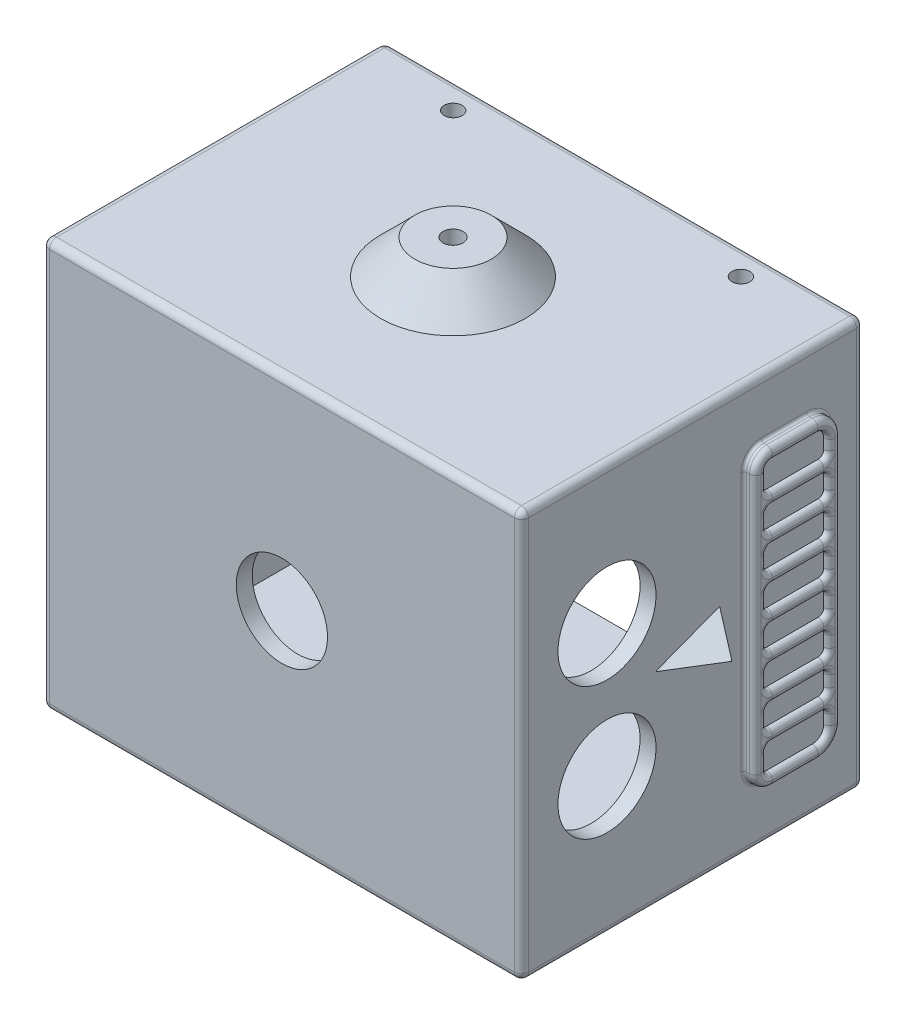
ISO-10303-21;
HEADER;
FILE_DESCRIPTION(('STEP AP214'),'2;1');
FILE_NAME('part.step','',(''),(''),'','','');
FILE_SCHEMA(('AUTOMOTIVE_DESIGN { 1 0 10303 214 1 1 1 1 }'));
ENDSEC;
DATA;
#1=APPLICATION_CONTEXT('core data for automotive mechanical design processes');
#2=APPLICATION_PROTOCOL_DEFINITION('international standard','automotive_design',2000,#1);
#3=PRODUCT_CONTEXT('',#1,'mechanical');
#4=PRODUCT('Part','Part','',(#3));
#5=PRODUCT_RELATED_PRODUCT_CATEGORY('part','',(#4));
#6=PRODUCT_DEFINITION_FORMATION('','',#4);
#7=PRODUCT_DEFINITION_CONTEXT('part definition',#1,'design');
#8=PRODUCT_DEFINITION('design','',#6,#7);
#9=PRODUCT_DEFINITION_SHAPE('','',#8);
#10=(LENGTH_UNIT() NAMED_UNIT(*) SI_UNIT(.MILLI.,.METRE.));
#11=(NAMED_UNIT(*) PLANE_ANGLE_UNIT() SI_UNIT($,.RADIAN.));
#12=(NAMED_UNIT(*) SI_UNIT($,.STERADIAN.) SOLID_ANGLE_UNIT());
#13=UNCERTAINTY_MEASURE_WITH_UNIT(LENGTH_MEASURE(1.E-05),#10,'distance_accuracy_value','');
#14=(GEOMETRIC_REPRESENTATION_CONTEXT(3) GLOBAL_UNCERTAINTY_ASSIGNED_CONTEXT((#13)) GLOBAL_UNIT_ASSIGNED_CONTEXT((#10,
#11,#12)) REPRESENTATION_CONTEXT('',''));
#15=CARTESIAN_POINT('',(0.,0.,0.));
#16=DIRECTION('',(0.,0.,1.));
#17=DIRECTION('',(1.,0.,0.));
#18=AXIS2_PLACEMENT_3D('',#15,#16,#17);
#19=CARTESIAN_POINT('',(44.,0.,0.));
#20=DIRECTION('',(1.,0.,0.));
#21=DIRECTION('',(0.,1.,0.));
#22=AXIS2_PLACEMENT_3D('',#19,#20,#21);
#23=PLANE('',#22);
#24=DIRECTION('',(0.,1.,0.));
#25=VECTOR('',#24,1.);
#26=CARTESIAN_POINT('',(44.,21.73,7.));
#27=LINE('',#26,#25);
#28=CARTESIAN_POINT('',(44.,-20.,7.));
#29=VERTEX_POINT('',#28);
#30=CARTESIAN_POINT('',(44.,-15.9999999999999,7.));
#31=VERTEX_POINT('',#30);
#32=EDGE_CURVE('E974',#29,#31,#27,.T.);
#33=ORIENTED_EDGE('',*,*,#32,.T.);
#34=CARTESIAN_POINT('',(44.,-16.,8.99999999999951));
#35=DIRECTION('',(1.,0.,0.));
#36=DIRECTION('',(0.,1.,0.));
#37=AXIS2_PLACEMENT_3D('',#34,#35,#36);
#38=CIRCLE('',#37,2.);
#39=CARTESIAN_POINT('',(44.,-17.9999999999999,9.00000000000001));
#40=VERTEX_POINT('',#39);
#41=EDGE_CURVE('E978',#31,#40,#38,.F.);
#42=ORIENTED_EDGE('',*,*,#41,.T.);
#43=CARTESIAN_POINT('',(44.,-20.,9.));
#44=DIRECTION('',(1.,0.,0.));
#45=DIRECTION('',(0.,1.,0.));
#46=AXIS2_PLACEMENT_3D('',#43,#44,#45);
#47=CIRCLE('',#46,2.00000000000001);
#48=EDGE_CURVE('E976',#40,#29,#47,.F.);
#49=ORIENTED_EDGE('',*,*,#48,.T.);
#50=EDGE_LOOP('',(#33,#42,#49));
#51=FACE_BOUND('',#50,.T.);
#52=ADVANCED_FACE('F34',(#51),#23,.T.);
#53=DIRECTION('',(0.,1.,0.));
#54=VECTOR('',#53,1.);
#55=CARTESIAN_POINT('',(44.,21.73,7.));
#56=LINE('',#55,#54);
#57=CARTESIAN_POINT('',(44.,-14.,7.));
#58=VERTEX_POINT('',#57);
#59=CARTESIAN_POINT('',(44.,-9.99999999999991,7.));
#60=VERTEX_POINT('',#59);
#61=EDGE_CURVE('E967',#58,#60,#56,.T.);
#62=ORIENTED_EDGE('',*,*,#61,.T.);
#63=CARTESIAN_POINT('',(44.,-9.99999999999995,8.99999999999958));
#64=DIRECTION('',(1.,0.,0.));
#65=DIRECTION('',(0.,1.,0.));
#66=AXIS2_PLACEMENT_3D('',#63,#64,#65);
#67=CIRCLE('',#66,2.);
#68=CARTESIAN_POINT('',(44.,-12.,8.9999999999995));
#69=VERTEX_POINT('',#68);
#70=EDGE_CURVE('E971',#60,#69,#67,.F.);
#71=ORIENTED_EDGE('',*,*,#70,.T.);
#72=CARTESIAN_POINT('',(44.,-14.,8.9999999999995));
#73=DIRECTION('',(1.,0.,0.));
#74=DIRECTION('',(0.,1.,0.));
#75=AXIS2_PLACEMENT_3D('',#72,#73,#74);
#76=CIRCLE('',#75,2.);
#77=EDGE_CURVE('E969',#69,#58,#76,.F.);
#78=ORIENTED_EDGE('',*,*,#77,.T.);
#79=EDGE_LOOP('',(#62,#71,#78));
#80=FACE_BOUND('',#79,.T.);
#81=ADVANCED_FACE('F1611',(#80),#23,.T.);
#82=DIRECTION('',(0.,1.,0.));
#83=VECTOR('',#82,1.);
#84=CARTESIAN_POINT('',(44.,21.73,7.));
#85=LINE('',#84,#83);
#86=CARTESIAN_POINT('',(44.,-7.99999999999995,7.));
#87=VERTEX_POINT('',#86);
#88=CARTESIAN_POINT('',(44.,-3.99999999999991,7.));
#89=VERTEX_POINT('',#88);
#90=EDGE_CURVE('E960',#87,#89,#85,.T.);
#91=ORIENTED_EDGE('',*,*,#90,.T.);
#92=CARTESIAN_POINT('',(44.,-3.99999999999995,8.99999999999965));
#93=DIRECTION('',(1.,0.,0.));
#94=DIRECTION('',(0.,1.,0.));
#95=AXIS2_PLACEMENT_3D('',#92,#93,#94);
#96=CIRCLE('',#95,2.);
#97=CARTESIAN_POINT('',(44.,-5.99999999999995,8.99999999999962));
#98=VERTEX_POINT('',#97);
#99=EDGE_CURVE('E964',#89,#98,#96,.F.);
#100=ORIENTED_EDGE('',*,*,#99,.T.);
#101=CARTESIAN_POINT('',(44.,-7.99999999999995,8.99999999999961));
#102=DIRECTION('',(1.,0.,0.));
#103=DIRECTION('',(0.,1.,0.));
#104=AXIS2_PLACEMENT_3D('',#101,#102,#103);
#105=CIRCLE('',#104,2.);
#106=EDGE_CURVE('E962',#98,#87,#105,.F.);
#107=ORIENTED_EDGE('',*,*,#106,.T.);
#108=EDGE_LOOP('',(#91,#100,#107));
#109=FACE_BOUND('',#108,.T.);
#110=ADVANCED_FACE('F1618',(#109),#23,.T.);
#111=DIRECTION('',(0.,1.,0.));
#112=VECTOR('',#111,1.);
#113=CARTESIAN_POINT('',(44.,21.73,7.));
#114=LINE('',#113,#112);
#115=CARTESIAN_POINT('',(44.,-1.99999999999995,7.));
#116=VERTEX_POINT('',#115);
#117=CARTESIAN_POINT('',(44.,2.00000000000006,7.));
#118=VERTEX_POINT('',#117);
#119=EDGE_CURVE('E955',#116,#118,#114,.T.);
#120=ORIENTED_EDGE('',*,*,#119,.T.);
#121=CARTESIAN_POINT('',(44.,2.00000000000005,8.9999999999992));
#122=DIRECTION('',(1.,0.,0.));
#123=DIRECTION('',(0.,1.,0.));
#124=AXIS2_PLACEMENT_3D('',#121,#122,#123);
#125=CIRCLE('',#124,2.);
#126=CARTESIAN_POINT('',(44.,0.,8.99999999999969));
#127=VERTEX_POINT('',#126);
#128=EDGE_CURVE('E621',#118,#127,#125,.F.);
#129=ORIENTED_EDGE('',*,*,#128,.T.);
#130=CARTESIAN_POINT('',(44.,-1.99999999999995,8.99999999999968));
#131=DIRECTION('',(1.,0.,0.));
#132=DIRECTION('',(0.,1.,0.));
#133=AXIS2_PLACEMENT_3D('',#130,#131,#132);
#134=CIRCLE('',#133,2.);
#135=EDGE_CURVE('E957',#127,#116,#134,.F.);
#136=ORIENTED_EDGE('',*,*,#135,.T.);
#137=EDGE_LOOP('',(#120,#129,#136));
#138=FACE_BOUND('',#137,.T.);
#139=ADVANCED_FACE('F3138',(#138),#23,.T.);
#140=DIRECTION('',(0.,1.,0.));
#141=VECTOR('',#140,1.);
#142=CARTESIAN_POINT('',(44.,21.73,7.));
#143=LINE('',#142,#141);
#144=CARTESIAN_POINT('',(44.,4.,7.));
#145=VERTEX_POINT('',#144);
#146=CARTESIAN_POINT('',(44.,8.00000000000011,7.));
#147=VERTEX_POINT('',#146);
#148=EDGE_CURVE('E948',#145,#147,#143,.T.);
#149=ORIENTED_EDGE('',*,*,#148,.T.);
#150=CARTESIAN_POINT('',(44.,8.,8.99999999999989));
#151=DIRECTION('',(1.,0.,0.));
#152=DIRECTION('',(0.,1.,0.));
#153=AXIS2_PLACEMENT_3D('',#150,#151,#152);
#154=CIRCLE('',#153,2.);
#155=CARTESIAN_POINT('',(44.,6.,8.9999999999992));
#156=VERTEX_POINT('',#155);
#157=EDGE_CURVE('E952',#147,#156,#154,.F.);
#158=ORIENTED_EDGE('',*,*,#157,.T.);
#159=CARTESIAN_POINT('',(44.,4.,8.9999999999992));
#160=DIRECTION('',(1.,0.,0.));
#161=DIRECTION('',(0.,1.,0.));
#162=AXIS2_PLACEMENT_3D('',#159,#160,#161);
#163=CIRCLE('',#162,2.);
#164=EDGE_CURVE('E950',#156,#145,#163,.F.);
#165=ORIENTED_EDGE('',*,*,#164,.T.);
#166=EDGE_LOOP('',(#149,#158,#165));
#167=FACE_BOUND('',#166,.T.);
#168=ADVANCED_FACE('F3146',(#167),#23,.T.);
#169=DIRECTION('',(0.,1.,0.));
#170=VECTOR('',#169,1.);
#171=CARTESIAN_POINT('',(44.,21.73,7.));
#172=LINE('',#171,#170);
#173=CARTESIAN_POINT('',(44.,10.,7.));
#174=VERTEX_POINT('',#173);
#175=CARTESIAN_POINT('',(44.,14.,7.));
#176=VERTEX_POINT('',#175);
#177=EDGE_CURVE('E941',#174,#176,#172,.T.);
#178=ORIENTED_EDGE('',*,*,#177,.T.);
#179=CARTESIAN_POINT('',(44.,14.,9.00000000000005));
#180=DIRECTION('',(1.,0.,0.));
#181=DIRECTION('',(0.,1.,0.));
#182=AXIS2_PLACEMENT_3D('',#179,#180,#181);
#183=CIRCLE('',#182,2.);
#184=CARTESIAN_POINT('',(44.,12.,9.));
#185=VERTEX_POINT('',#184);
#186=EDGE_CURVE('E945',#176,#185,#183,.F.);
#187=ORIENTED_EDGE('',*,*,#186,.T.);
#188=CARTESIAN_POINT('',(44.,10.,8.99999999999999));
#189=DIRECTION('',(1.,0.,0.));
#190=DIRECTION('',(0.,1.,0.));
#191=AXIS2_PLACEMENT_3D('',#188,#189,#190);
#192=CIRCLE('',#191,2.);
#193=EDGE_CURVE('E943',#185,#174,#192,.F.);
#194=ORIENTED_EDGE('',*,*,#193,.T.);
#195=EDGE_LOOP('',(#178,#187,#194));
#196=FACE_BOUND('',#195,.T.);
#197=ADVANCED_FACE('F3155',(#196),#23,.T.);
#198=DIRECTION('',(0.,1.,0.));
#199=VECTOR('',#198,1.);
#200=CARTESIAN_POINT('',(44.,21.73,7.));
#201=LINE('',#200,#199);
#202=CARTESIAN_POINT('',(44.,16.,7.));
#203=VERTEX_POINT('',#202);
#204=CARTESIAN_POINT('',(44.,20.0000000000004,7.));
#205=VERTEX_POINT('',#204);
#206=EDGE_CURVE('E934',#203,#205,#201,.T.);
#207=ORIENTED_EDGE('',*,*,#206,.T.);
#208=CARTESIAN_POINT('',(44.,20.,8.99999999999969));
#209=DIRECTION('',(1.,0.,0.));
#210=DIRECTION('',(0.,1.,0.));
#211=AXIS2_PLACEMENT_3D('',#208,#209,#210);
#212=CIRCLE('',#211,2.);
#213=CARTESIAN_POINT('',(44.,18.,9.00000000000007));
#214=VERTEX_POINT('',#213);
#215=EDGE_CURVE('E938',#205,#214,#212,.F.);
#216=ORIENTED_EDGE('',*,*,#215,.T.);
#217=CARTESIAN_POINT('',(44.,16.,9.00000000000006));
#218=DIRECTION('',(1.,0.,0.));
#219=DIRECTION('',(0.,1.,0.));
#220=AXIS2_PLACEMENT_3D('',#217,#218,#219);
#221=CIRCLE('',#220,2.);
#222=EDGE_CURVE('E936',#214,#203,#221,.F.);
#223=ORIENTED_EDGE('',*,*,#222,.T.);
#224=EDGE_LOOP('',(#207,#216,#223));
#225=FACE_BOUND('',#224,.T.);
#226=ADVANCED_FACE('F1999',(#225),#23,.T.);
#227=CARTESIAN_POINT('',(44.,16.,18.0000000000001));
#228=DIRECTION('',(1.,0.,0.));
#229=DIRECTION('',(0.,1.,0.));
#230=AXIS2_PLACEMENT_3D('',#227,#228,#229);
#231=CIRCLE('',#230,2.);
#232=CARTESIAN_POINT('',(44.,16.,20.));
#233=VERTEX_POINT('',#232);
#234=CARTESIAN_POINT('',(44.,18.,18.));
#235=VERTEX_POINT('',#234);
#236=EDGE_CURVE('E929',#233,#235,#231,.F.);
#237=ORIENTED_EDGE('',*,*,#236,.T.);
#238=CARTESIAN_POINT('',(44.,20.,18.));
#239=DIRECTION('',(1.,0.,0.));
#240=DIRECTION('',(0.,1.,0.));
#241=AXIS2_PLACEMENT_3D('',#238,#239,#240);
#242=CIRCLE('',#241,2.);
#243=CARTESIAN_POINT('',(44.,20.,20.));
#244=VERTEX_POINT('',#243);
#245=EDGE_CURVE('E931',#235,#244,#242,.F.);
#246=ORIENTED_EDGE('',*,*,#245,.T.);
#247=DIRECTION('',(0.,1.,0.));
#248=VECTOR('',#247,1.);
#249=CARTESIAN_POINT('',(44.,0.,20.));
#250=LINE('',#249,#248);
#251=EDGE_CURVE('E927',#244,#233,#250,.F.);
#252=ORIENTED_EDGE('',*,*,#251,.T.);
#253=EDGE_LOOP('',(#237,#246,#252));
#254=FACE_BOUND('',#253,.T.);
#255=ADVANCED_FACE('F1783',(#254),#23,.T.);
#256=CARTESIAN_POINT('',(44.,10.,18.));
#257=DIRECTION('',(1.,0.,0.));
#258=DIRECTION('',(0.,1.,0.));
#259=AXIS2_PLACEMENT_3D('',#256,#257,#258);
#260=CIRCLE('',#259,2.);
#261=CARTESIAN_POINT('',(44.,10.,20.));
#262=VERTEX_POINT('',#261);
#263=CARTESIAN_POINT('',(44.,12.,18.));
#264=VERTEX_POINT('',#263);
#265=EDGE_CURVE('E922',#262,#264,#260,.F.);
#266=ORIENTED_EDGE('',*,*,#265,.T.);
#267=CARTESIAN_POINT('',(44.,14.,18.));
#268=DIRECTION('',(1.,0.,0.));
#269=DIRECTION('',(0.,1.,0.));
#270=AXIS2_PLACEMENT_3D('',#267,#268,#269);
#271=CIRCLE('',#270,2.);
#272=CARTESIAN_POINT('',(44.,14.,20.));
#273=VERTEX_POINT('',#272);
#274=EDGE_CURVE('E924',#264,#273,#271,.F.);
#275=ORIENTED_EDGE('',*,*,#274,.T.);
#276=DIRECTION('',(0.,1.,0.));
#277=VECTOR('',#276,1.);
#278=CARTESIAN_POINT('',(44.,0.,20.));
#279=LINE('',#278,#277);
#280=EDGE_CURVE('E920',#273,#262,#279,.F.);
#281=ORIENTED_EDGE('',*,*,#280,.T.);
#282=EDGE_LOOP('',(#266,#275,#281));
#283=FACE_BOUND('',#282,.T.);
#284=ADVANCED_FACE('F1778',(#283),#23,.T.);
#285=CARTESIAN_POINT('',(44.,4.,17.9999999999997));
#286=DIRECTION('',(1.,0.,0.));
#287=DIRECTION('',(0.,1.,0.));
#288=AXIS2_PLACEMENT_3D('',#285,#286,#287);
#289=CIRCLE('',#288,2.);
#290=CARTESIAN_POINT('',(44.,4.,20.));
#291=VERTEX_POINT('',#290);
#292=CARTESIAN_POINT('',(44.,6.,17.9999999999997));
#293=VERTEX_POINT('',#292);
#294=EDGE_CURVE('E915',#291,#293,#289,.F.);
#295=ORIENTED_EDGE('',*,*,#294,.T.);
#296=CARTESIAN_POINT('',(44.,8.,18.));
#297=DIRECTION('',(1.,0.,0.));
#298=DIRECTION('',(0.,1.,0.));
#299=AXIS2_PLACEMENT_3D('',#296,#297,#298);
#300=CIRCLE('',#299,2.);
#301=CARTESIAN_POINT('',(44.,8.,20.));
#302=VERTEX_POINT('',#301);
#303=EDGE_CURVE('E917',#293,#302,#300,.F.);
#304=ORIENTED_EDGE('',*,*,#303,.T.);
#305=DIRECTION('',(0.,1.,0.));
#306=VECTOR('',#305,1.);
#307=CARTESIAN_POINT('',(44.,0.,20.));
#308=LINE('',#307,#306);
#309=EDGE_CURVE('E913',#302,#291,#308,.F.);
#310=ORIENTED_EDGE('',*,*,#309,.T.);
#311=EDGE_LOOP('',(#295,#304,#310));
#312=FACE_BOUND('',#311,.T.);
#313=ADVANCED_FACE('F1774',(#312),#23,.T.);
#314=CARTESIAN_POINT('',(44.,-1.99999999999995,18.0000000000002));
#315=DIRECTION('',(1.,0.,0.));
#316=DIRECTION('',(0.,1.,0.));
#317=AXIS2_PLACEMENT_3D('',#314,#315,#316);
#318=CIRCLE('',#317,2.);
#319=CARTESIAN_POINT('',(44.,-1.99999999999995,20.));
#320=VERTEX_POINT('',#319);
#321=CARTESIAN_POINT('',(44.,0.,18.0000000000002));
#322=VERTEX_POINT('',#321);
#323=EDGE_CURVE('E908',#320,#322,#318,.F.);
#324=ORIENTED_EDGE('',*,*,#323,.T.);
#325=CARTESIAN_POINT('',(44.,2.00000000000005,17.9999999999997));
#326=DIRECTION('',(1.,0.,0.));
#327=DIRECTION('',(0.,1.,0.));
#328=AXIS2_PLACEMENT_3D('',#325,#326,#327);
#329=CIRCLE('',#328,2.);
#330=CARTESIAN_POINT('',(44.,2.00000000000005,20.));
#331=VERTEX_POINT('',#330);
#332=EDGE_CURVE('E910',#322,#331,#329,.F.);
#333=ORIENTED_EDGE('',*,*,#332,.T.);
#334=DIRECTION('',(0.,1.,0.));
#335=VECTOR('',#334,1.);
#336=CARTESIAN_POINT('',(44.,0.,20.));
#337=LINE('',#336,#335);
#338=EDGE_CURVE('E906',#331,#320,#337,.F.);
#339=ORIENTED_EDGE('',*,*,#338,.T.);
#340=EDGE_LOOP('',(#324,#333,#339));
#341=FACE_BOUND('',#340,.T.);
#342=ADVANCED_FACE('F1644',(#341),#23,.T.);
#343=CARTESIAN_POINT('',(44.,-7.99999999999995,18.0000000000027));
#344=DIRECTION('',(1.,0.,0.));
#345=DIRECTION('',(0.,1.,0.));
#346=AXIS2_PLACEMENT_3D('',#343,#344,#345);
#347=CIRCLE('',#346,2.);
#348=CARTESIAN_POINT('',(44.,-7.99999999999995,20.));
#349=VERTEX_POINT('',#348);
#350=CARTESIAN_POINT('',(44.,-5.99999999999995,18.0000000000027));
#351=VERTEX_POINT('',#350);
#352=EDGE_CURVE('E901',#349,#351,#347,.F.);
#353=ORIENTED_EDGE('',*,*,#352,.T.);
#354=CARTESIAN_POINT('',(44.,-3.99999999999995,18.0000000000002));
#355=DIRECTION('',(1.,0.,0.));
#356=DIRECTION('',(0.,1.,0.));
#357=AXIS2_PLACEMENT_3D('',#354,#355,#356);
#358=CIRCLE('',#357,2.);
#359=CARTESIAN_POINT('',(44.,-3.99999999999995,20.));
#360=VERTEX_POINT('',#359);
#361=EDGE_CURVE('E903',#351,#360,#358,.F.);
#362=ORIENTED_EDGE('',*,*,#361,.T.);
#363=DIRECTION('',(0.,1.,0.));
#364=VECTOR('',#363,1.);
#365=CARTESIAN_POINT('',(44.,0.,20.));
#366=LINE('',#365,#364);
#367=EDGE_CURVE('E899',#360,#349,#366,.F.);
#368=ORIENTED_EDGE('',*,*,#367,.T.);
#369=EDGE_LOOP('',(#353,#362,#368));
#370=FACE_BOUND('',#369,.T.);
#371=ADVANCED_FACE('F1636',(#370),#23,.T.);
#372=CARTESIAN_POINT('',(44.,-14.,18.0000000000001));
#373=DIRECTION('',(1.,0.,0.));
#374=DIRECTION('',(0.,1.,0.));
#375=AXIS2_PLACEMENT_3D('',#372,#373,#374);
#376=CIRCLE('',#375,2.);
#377=CARTESIAN_POINT('',(44.,-14.,20.));
#378=VERTEX_POINT('',#377);
#379=CARTESIAN_POINT('',(44.,-12.,18.0000000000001));
#380=VERTEX_POINT('',#379);
#381=EDGE_CURVE('E894',#378,#380,#376,.F.);
#382=ORIENTED_EDGE('',*,*,#381,.T.);
#383=CARTESIAN_POINT('',(44.,-9.99999999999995,18.0000000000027));
#384=DIRECTION('',(1.,0.,0.));
#385=DIRECTION('',(0.,1.,0.));
#386=AXIS2_PLACEMENT_3D('',#383,#384,#385);
#387=CIRCLE('',#386,2.);
#388=CARTESIAN_POINT('',(44.,-9.99999999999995,20.));
#389=VERTEX_POINT('',#388);
#390=EDGE_CURVE('E896',#380,#389,#387,.F.);
#391=ORIENTED_EDGE('',*,*,#390,.T.);
#392=DIRECTION('',(0.,1.,0.));
#393=VECTOR('',#392,1.);
#394=CARTESIAN_POINT('',(44.,0.,20.));
#395=LINE('',#394,#393);
#396=EDGE_CURVE('E892',#389,#378,#395,.F.);
#397=ORIENTED_EDGE('',*,*,#396,.T.);
#398=EDGE_LOOP('',(#382,#391,#397));
#399=FACE_BOUND('',#398,.T.);
#400=ADVANCED_FACE('F1626',(#399),#23,.T.);
#401=CARTESIAN_POINT('',(42.,35.73,60.));
#402=DIRECTION('',(-1.,0.,0.));
#403=DIRECTION('',(0.,-1.,0.));
#404=AXIS2_PLACEMENT_3D('',#401,#402,#403);
#405=PLANE('',#404);
#406=DIRECTION('',(0.,1.,0.));
#407=VECTOR('',#406,1.);
#408=CARTESIAN_POINT('',(42.,-35.73,58.75));
#409=LINE('',#408,#407);
#410=CARTESIAN_POINT('',(42.,34.48,58.75));
#411=VERTEX_POINT('',#410);
#412=CARTESIAN_POINT('',(42.,-34.48,58.75));
#413=VERTEX_POINT('',#412);
#414=EDGE_CURVE('E1369',#411,#413,#409,.F.);
#415=ORIENTED_EDGE('',*,*,#414,.T.);
#416=DIRECTION('',(0.,0.,-1.));
#417=VECTOR('',#416,1.);
#418=CARTESIAN_POINT('',(42.,-34.48,60.));
#419=LINE('',#418,#417);
#420=CARTESIAN_POINT('',(42.,-34.48,1.25));
#421=VERTEX_POINT('',#420);
#422=EDGE_CURVE('E1371',#413,#421,#419,.T.);
#423=ORIENTED_EDGE('',*,*,#422,.T.);
#424=DIRECTION('',(0.,1.,0.));
#425=VECTOR('',#424,1.);
#426=CARTESIAN_POINT('',(42.,35.73,1.25));
#427=LINE('',#426,#425);
#428=CARTESIAN_POINT('',(42.,34.48,1.25));
#429=VERTEX_POINT('',#428);
#430=EDGE_CURVE('E1365',#421,#429,#427,.T.);
#431=ORIENTED_EDGE('',*,*,#430,.T.);
#432=DIRECTION('',(0.,0.,-1.));
#433=VECTOR('',#432,1.);
#434=CARTESIAN_POINT('',(42.,34.48,60.));
#435=LINE('',#434,#433);
#436=EDGE_CURVE('E1367',#429,#411,#435,.F.);
#437=ORIENTED_EDGE('',*,*,#436,.T.);
#438=EDGE_LOOP('',(#415,#423,#431,#437));
#439=FACE_BOUND('',#438,.T.);
#440=DIRECTION('',(0.,0.,-1.));
#441=VECTOR('',#440,1.);
#442=CARTESIAN_POINT('',(42.,-26.23,18.));
#443=LINE('',#442,#441);
#444=CARTESIAN_POINT('',(42.,-26.23,10.));
#445=VERTEX_POINT('',#444);
#446=CARTESIAN_POINT('',(42.,-26.23,18.));
#447=VERTEX_POINT('',#446);
#448=EDGE_CURVE('E1297',#445,#447,#443,.F.);
#449=ORIENTED_EDGE('',*,*,#448,.T.);
#450=CARTESIAN_POINT('',(42.,-22.73,18.));
#451=DIRECTION('',(-1.,0.,0.));
#452=DIRECTION('',(0.,-1.,0.));
#453=AXIS2_PLACEMENT_3D('',#450,#451,#452);
#454=CIRCLE('',#453,3.5);
#455=CARTESIAN_POINT('',(42.,-22.73,21.5));
#456=VERTEX_POINT('',#455);
#457=EDGE_CURVE('E1299',#447,#456,#454,.T.);
#458=ORIENTED_EDGE('',*,*,#457,.T.);
#459=DIRECTION('',(0.,1.,0.));
#460=VECTOR('',#459,1.);
#461=CARTESIAN_POINT('',(42.,35.73,21.5));
#462=LINE('',#461,#460);
#463=CARTESIAN_POINT('',(42.,22.73,21.5));
#464=VERTEX_POINT('',#463);
#465=EDGE_CURVE('E1285',#456,#464,#462,.T.);
#466=ORIENTED_EDGE('',*,*,#465,.T.);
#467=CARTESIAN_POINT('',(42.,22.73,18.));
#468=DIRECTION('',(-1.,0.,0.));
#469=DIRECTION('',(0.,-1.,0.));
#470=AXIS2_PLACEMENT_3D('',#467,#468,#469);
#471=CIRCLE('',#470,3.5);
#472=CARTESIAN_POINT('',(42.,26.23,18.));
#473=VERTEX_POINT('',#472);
#474=EDGE_CURVE('E1287',#464,#473,#471,.T.);
#475=ORIENTED_EDGE('',*,*,#474,.T.);
#476=DIRECTION('',(0.,0.,-1.));
#477=VECTOR('',#476,1.);
#478=CARTESIAN_POINT('',(42.,26.23,60.));
#479=LINE('',#478,#477);
#480=CARTESIAN_POINT('',(42.,26.23,10.));
#481=VERTEX_POINT('',#480);
#482=EDGE_CURVE('E1289',#473,#481,#479,.T.);
#483=ORIENTED_EDGE('',*,*,#482,.T.);
#484=CARTESIAN_POINT('',(42.,21.73,10.));
#485=DIRECTION('',(-1.,0.,0.));
#486=DIRECTION('',(0.,-1.,0.));
#487=AXIS2_PLACEMENT_3D('',#484,#485,#486);
#488=CIRCLE('',#487,4.5);
#489=CARTESIAN_POINT('',(42.,21.73,5.5));
#490=VERTEX_POINT('',#489);
#491=EDGE_CURVE('E1291',#481,#490,#488,.T.);
#492=ORIENTED_EDGE('',*,*,#491,.T.);
#493=DIRECTION('',(0.,1.,0.));
#494=VECTOR('',#493,1.);
#495=CARTESIAN_POINT('',(42.,-21.73,5.5));
#496=LINE('',#495,#494);
#497=CARTESIAN_POINT('',(42.,-21.73,5.5));
#498=VERTEX_POINT('',#497);
#499=EDGE_CURVE('E1293',#490,#498,#496,.F.);
#500=ORIENTED_EDGE('',*,*,#499,.T.);
#501=CARTESIAN_POINT('',(42.,-21.73,10.));
#502=DIRECTION('',(-1.,0.,0.));
#503=DIRECTION('',(0.,-1.,0.));
#504=AXIS2_PLACEMENT_3D('',#501,#502,#503);
#505=CIRCLE('',#504,4.5);
#506=EDGE_CURVE('E1295',#498,#445,#505,.T.);
#507=ORIENTED_EDGE('',*,*,#506,.T.);
#508=EDGE_LOOP('',(#449,#458,#466,#475,#483,#492,#500,#507));
#509=FACE_BOUND('',#508,.T.);
#510=CARTESIAN_POINT('',(42.,11.6,45.));
#511=DIRECTION('',(1.,0.,0.));
#512=DIRECTION('',(0.,1.,0.));
#513=AXIS2_PLACEMENT_3D('',#510,#511,#512);
#514=CIRCLE('',#513,8.6);
#515=CARTESIAN_POINT('',(42.,20.2,45.));
#516=VERTEX_POINT('',#515);
#517=EDGE_CURVE('E845',#516,#516,#514,.T.);
#518=ORIENTED_EDGE('',*,*,#517,.F.);
#519=EDGE_LOOP('',(#518));
#520=FACE_BOUND('',#519,.T.);
#521=CARTESIAN_POINT('',(42.,-11.6,45.));
#522=DIRECTION('',(1.,0.,0.));
#523=DIRECTION('',(0.,1.,0.));
#524=AXIS2_PLACEMENT_3D('',#521,#522,#523);
#525=CIRCLE('',#524,8.6);
#526=CARTESIAN_POINT('',(42.,-3.00000000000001,45.));
#527=VERTEX_POINT('',#526);
#528=EDGE_CURVE('E848',#527,#527,#525,.T.);
#529=ORIENTED_EDGE('',*,*,#528,.F.);
#530=EDGE_LOOP('',(#529));
#531=FACE_BOUND('',#530,.T.);
#532=DIRECTION('',(0.,1.,0.));
#533=VECTOR('',#532,1.);
#534=CARTESIAN_POINT('',(42.,0.,25.25));
#535=LINE('',#534,#533);
#536=CARTESIAN_POINT('',(42.,-4.29999999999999,25.25));
#537=VERTEX_POINT('',#536);
#538=CARTESIAN_POINT('',(42.,4.30000000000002,25.25));
#539=VERTEX_POINT('',#538);
#540=EDGE_CURVE('E789',#537,#539,#535,.T.);
#541=ORIENTED_EDGE('',*,*,#540,.F.);
#542=DIRECTION('',(0.,-0.357030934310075,-0.934092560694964));
#543=VECTOR('',#542,1.);
#544=CARTESIAN_POINT('',(42.,-12.172747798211,4.65269471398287));
#545=LINE('',#544,#543);
#546=CARTESIAN_POINT('',(42.,0.,36.5));
#547=VERTEX_POINT('',#546);
#548=EDGE_CURVE('E795',#547,#537,#545,.T.);
#549=ORIENTED_EDGE('',*,*,#548,.F.);
#550=DIRECTION('',(0.,-0.357030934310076,0.934092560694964));
#551=VECTOR('',#550,1.);
#552=CARTESIAN_POINT('',(42.,12.172747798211,4.65269471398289));
#553=LINE('',#552,#551);
#554=EDGE_CURVE('E792',#539,#547,#553,.T.);
#555=ORIENTED_EDGE('',*,*,#554,.F.);
#556=EDGE_LOOP('',(#541,#549,#555));
#557=FACE_BOUND('',#556,.T.);
#558=ADVANCED_FACE('F1589',(#439,#509,#520,#531,#557),#405,.F.);
#559=CARTESIAN_POINT('',(-42.,32.93,60.));
#560=DIRECTION('',(0.,-1.,0.));
#561=DIRECTION('',(0.,0.,-1.));
#562=AXIS2_PLACEMENT_3D('',#559,#560,#561);
#563=PLANE('',#562);
#564=CARTESIAN_POINT('',(25.225,32.93,4.75));
#565=DIRECTION('',(0.,-1.,0.));
#566=DIRECTION('',(0.,0.,-1.));
#567=AXIS2_PLACEMENT_3D('',#564,#565,#566);
#568=CIRCLE('',#567,1.575);
#569=CARTESIAN_POINT('',(25.225,32.93,3.175));
#570=VERTEX_POINT('',#569);
#571=EDGE_CURVE('E1481',#570,#570,#568,.T.);
#572=ORIENTED_EDGE('',*,*,#571,.F.);
#573=EDGE_LOOP('',(#572));
#574=FACE_BOUND('',#573,.T.);
#575=CARTESIAN_POINT('',(-25.225,32.93,4.75));
#576=DIRECTION('',(0.,-1.,0.));
#577=DIRECTION('',(0.,0.,-1.));
#578=AXIS2_PLACEMENT_3D('',#575,#576,#577);
#579=CIRCLE('',#578,1.575);
#580=CARTESIAN_POINT('',(-25.225,32.93,3.175));
#581=VERTEX_POINT('',#580);
#582=EDGE_CURVE('E1466',#581,#581,#579,.T.);
#583=ORIENTED_EDGE('',*,*,#582,.F.);
#584=EDGE_LOOP('',(#583));
#585=FACE_BOUND('',#584,.T.);
#586=CARTESIAN_POINT('',(0.,32.93,30.));
#587=DIRECTION('',(0.,-1.,0.));
#588=DIRECTION('',(0.,0.,-1.));
#589=AXIS2_PLACEMENT_3D('',#586,#587,#588);
#590=CIRCLE('',#589,1.75);
#591=CARTESIAN_POINT('',(0.,32.93,28.25));
#592=VERTEX_POINT('',#591);
#593=EDGE_CURVE('E1496',#592,#592,#590,.T.);
#594=ORIENTED_EDGE('',*,*,#593,.F.);
#595=EDGE_LOOP('',(#594));
#596=FACE_BOUND('',#595,.T.);
#597=DIRECTION('',(-1.,0.,0.));
#598=VECTOR('',#597,1.);
#599=CARTESIAN_POINT('',(0.,32.93,2.75));
#600=LINE('',#599,#598);
#601=CARTESIAN_POINT('',(-30.1,32.93,2.75));
#602=VERTEX_POINT('',#601);
#603=CARTESIAN_POINT('',(-39.2,32.93,2.75));
#604=VERTEX_POINT('',#603);
#605=EDGE_CURVE('E821',#602,#604,#600,.T.);
#606=ORIENTED_EDGE('',*,*,#605,.F.);
#607=DIRECTION('',(0.,0.,-1.));
#608=VECTOR('',#607,1.);
#609=CARTESIAN_POINT('',(-30.1,32.93,2.75));
#610=LINE('',#609,#608);
#611=CARTESIAN_POINT('',(-30.1,32.93,0.));
#612=VERTEX_POINT('',#611);
#613=EDGE_CURVE('E825',#602,#612,#610,.T.);
#614=ORIENTED_EDGE('',*,*,#613,.T.);
#615=DIRECTION('',(-1.,0.,0.));
#616=VECTOR('',#615,1.);
#617=CARTESIAN_POINT('',(-42.,32.93,0.));
#618=LINE('',#617,#616);
#619=CARTESIAN_POINT('',(30.1,32.93,0.));
#620=VERTEX_POINT('',#619);
#621=EDGE_CURVE('E878',#620,#612,#618,.T.);
#622=ORIENTED_EDGE('',*,*,#621,.F.);
#623=DIRECTION('',(0.,0.,-1.));
#624=VECTOR('',#623,1.);
#625=CARTESIAN_POINT('',(30.1,32.93,2.75));
#626=LINE('',#625,#624);
#627=CARTESIAN_POINT('',(30.1,32.93,2.75));
#628=VERTEX_POINT('',#627);
#629=EDGE_CURVE('E843',#628,#620,#626,.T.);
#630=ORIENTED_EDGE('',*,*,#629,.F.);
#631=DIRECTION('',(-1.,0.,0.));
#632=VECTOR('',#631,1.);
#633=CARTESIAN_POINT('',(0.,32.93,2.75));
#634=LINE('',#633,#632);
#635=CARTESIAN_POINT('',(39.2,32.93,2.75));
#636=VERTEX_POINT('',#635);
#637=EDGE_CURVE('E836',#636,#628,#634,.T.);
#638=ORIENTED_EDGE('',*,*,#637,.F.);
#639=DIRECTION('',(0.,0.,-1.));
#640=VECTOR('',#639,1.);
#641=CARTESIAN_POINT('',(39.2,32.93,60.));
#642=LINE('',#641,#640);
#643=CARTESIAN_POINT('',(39.2,32.93,57.2));
#644=VERTEX_POINT('',#643);
#645=EDGE_CURVE('E854',#644,#636,#642,.T.);
#646=ORIENTED_EDGE('',*,*,#645,.F.);
#647=DIRECTION('',(-1.,0.,0.));
#648=VECTOR('',#647,1.);
#649=CARTESIAN_POINT('',(-42.,32.93,57.2));
#650=LINE('',#649,#648);
#651=CARTESIAN_POINT('',(-39.2,32.93,57.2));
#652=VERTEX_POINT('',#651);
#653=EDGE_CURVE('E862',#644,#652,#650,.T.);
#654=ORIENTED_EDGE('',*,*,#653,.T.);
#655=DIRECTION('',(0.,0.,-1.));
#656=VECTOR('',#655,1.);
#657=CARTESIAN_POINT('',(-39.2,32.93,60.));
#658=LINE('',#657,#656);
#659=EDGE_CURVE('E858',#652,#604,#658,.T.);
#660=ORIENTED_EDGE('',*,*,#659,.T.);
#661=EDGE_LOOP('',(#606,#614,#622,#630,#638,#646,#654,#660));
#662=FACE_BOUND('',#661,.T.);
#663=ADVANCED_FACE('F1642',(#574,#585,#596,#662),#563,.T.);
#664=CARTESIAN_POINT('',(-39.2,35.73,60.));
#665=DIRECTION('',(1.,0.,0.));
#666=DIRECTION('',(0.,1.,0.));
#667=AXIS2_PLACEMENT_3D('',#664,#665,#666);
#668=PLANE('',#667);
#669=DIRECTION('',(0.,0.,-1.));
#670=VECTOR('',#669,1.);
#671=CARTESIAN_POINT('',(-39.2,-32.93,60.));
#672=LINE('',#671,#670);
#673=CARTESIAN_POINT('',(-39.2,-32.93,57.2));
#674=VERTEX_POINT('',#673);
#675=CARTESIAN_POINT('',(-39.2,-32.93,2.75));
#676=VERTEX_POINT('',#675);
#677=EDGE_CURVE('E867',#674,#676,#672,.T.);
#678=ORIENTED_EDGE('',*,*,#677,.T.);
#679=DIRECTION('',(0.,-1.,0.));
#680=VECTOR('',#679,1.);
#681=CARTESIAN_POINT('',(-39.2,0.,2.75));
#682=LINE('',#681,#680);
#683=EDGE_CURVE('E819',#604,#676,#682,.T.);
#684=ORIENTED_EDGE('',*,*,#683,.F.);
#685=ORIENTED_EDGE('',*,*,#659,.F.);
#686=DIRECTION('',(0.,-1.,0.));
#687=VECTOR('',#686,1.);
#688=CARTESIAN_POINT('',(-39.2,35.73,57.2));
#689=LINE('',#688,#687);
#690=EDGE_CURVE('E872',#652,#674,#689,.T.);
#691=ORIENTED_EDGE('',*,*,#690,.T.);
#692=EDGE_LOOP('',(#678,#684,#685,#691));
#693=FACE_BOUND('',#692,.T.);
#694=ADVANCED_FACE('F2923',(#693),#668,.T.);
#695=CARTESIAN_POINT('',(-42.,-32.93,60.));
#696=DIRECTION('',(0.,1.,0.));
#697=DIRECTION('',(0.,0.,1.));
#698=AXIS2_PLACEMENT_3D('',#695,#696,#697);
#699=PLANE('',#698);
#700=CARTESIAN_POINT('',(25.225,-32.93,4.75));
#701=DIRECTION('',(0.,1.,0.));
#702=DIRECTION('',(0.,0.,1.));
#703=AXIS2_PLACEMENT_3D('',#700,#701,#702);
#704=CIRCLE('',#703,1.575);
#705=CARTESIAN_POINT('',(25.225,-32.93,6.325));
#706=VERTEX_POINT('',#705);
#707=EDGE_CURVE('E1478',#706,#706,#704,.T.);
#708=ORIENTED_EDGE('',*,*,#707,.F.);
#709=EDGE_LOOP('',(#708));
#710=FACE_BOUND('',#709,.T.);
#711=CARTESIAN_POINT('',(-25.225,-32.93,4.75));
#712=DIRECTION('',(0.,1.,0.));
#713=DIRECTION('',(0.,0.,1.));
#714=AXIS2_PLACEMENT_3D('',#711,#712,#713);
#715=CIRCLE('',#714,1.575);
#716=CARTESIAN_POINT('',(-25.225,-32.93,6.325));
#717=VERTEX_POINT('',#716);
#718=EDGE_CURVE('E1461',#717,#717,#715,.T.);
#719=ORIENTED_EDGE('',*,*,#718,.F.);
#720=EDGE_LOOP('',(#719));
#721=FACE_BOUND('',#720,.T.);
#722=CARTESIAN_POINT('',(0.,-32.93,30.));
#723=DIRECTION('',(0.,1.,0.));
#724=DIRECTION('',(0.,0.,1.));
#725=AXIS2_PLACEMENT_3D('',#722,#723,#724);
#726=CIRCLE('',#725,1.75);
#727=CARTESIAN_POINT('',(0.,-32.93,31.75));
#728=VERTEX_POINT('',#727);
#729=EDGE_CURVE('E1487',#728,#728,#726,.T.);
#730=ORIENTED_EDGE('',*,*,#729,.F.);
#731=EDGE_LOOP('',(#730));
#732=FACE_BOUND('',#731,.T.);
#733=DIRECTION('',(1.,0.,0.));
#734=VECTOR('',#733,1.);
#735=CARTESIAN_POINT('',(-42.,-32.93,0.));
#736=LINE('',#735,#734);
#737=CARTESIAN_POINT('',(-30.1,-32.93,0.));
#738=VERTEX_POINT('',#737);
#739=CARTESIAN_POINT('',(30.1,-32.93,0.));
#740=VERTEX_POINT('',#739);
#741=EDGE_CURVE('E863',#738,#740,#736,.T.);
#742=ORIENTED_EDGE('',*,*,#741,.F.);
#743=DIRECTION('',(0.,0.,-1.));
#744=VECTOR('',#743,1.);
#745=CARTESIAN_POINT('',(-30.1,-32.93,2.75));
#746=LINE('',#745,#744);
#747=CARTESIAN_POINT('',(-30.1,-32.93,2.75));
#748=VERTEX_POINT('',#747);
#749=EDGE_CURVE('E823',#748,#738,#746,.T.);
#750=ORIENTED_EDGE('',*,*,#749,.F.);
#751=DIRECTION('',(1.,0.,0.));
#752=VECTOR('',#751,1.);
#753=CARTESIAN_POINT('',(0.,-32.93,2.75));
#754=LINE('',#753,#752);
#755=EDGE_CURVE('E817',#676,#748,#754,.T.);
#756=ORIENTED_EDGE('',*,*,#755,.F.);
#757=ORIENTED_EDGE('',*,*,#677,.F.);
#758=DIRECTION('',(1.,0.,0.));
#759=VECTOR('',#758,1.);
#760=CARTESIAN_POINT('',(-42.,-32.93,57.2));
#761=LINE('',#760,#759);
#762=CARTESIAN_POINT('',(39.2,-32.93,57.2));
#763=VERTEX_POINT('',#762);
#764=EDGE_CURVE('E868',#674,#763,#761,.T.);
#765=ORIENTED_EDGE('',*,*,#764,.T.);
#766=DIRECTION('',(0.,0.,-1.));
#767=VECTOR('',#766,1.);
#768=CARTESIAN_POINT('',(39.2,-32.93,60.));
#769=LINE('',#768,#767);
#770=CARTESIAN_POINT('',(39.2,-32.93,2.75));
#771=VERTEX_POINT('',#770);
#772=EDGE_CURVE('E864',#763,#771,#769,.T.);
#773=ORIENTED_EDGE('',*,*,#772,.T.);
#774=DIRECTION('',(1.,0.,0.));
#775=VECTOR('',#774,1.);
#776=CARTESIAN_POINT('',(0.,-32.93,2.75));
#777=LINE('',#776,#775);
#778=CARTESIAN_POINT('',(30.1,-32.93,2.75));
#779=VERTEX_POINT('',#778);
#780=EDGE_CURVE('E831',#779,#771,#777,.T.);
#781=ORIENTED_EDGE('',*,*,#780,.F.);
#782=DIRECTION('',(0.,0.,-1.));
#783=VECTOR('',#782,1.);
#784=CARTESIAN_POINT('',(30.1,-32.93,2.75));
#785=LINE('',#784,#783);
#786=EDGE_CURVE('E840',#779,#740,#785,.T.);
#787=ORIENTED_EDGE('',*,*,#786,.T.);
#788=EDGE_LOOP('',(#742,#750,#756,#757,#765,#773,#781,#787));
#789=FACE_BOUND('',#788,.T.);
#790=ADVANCED_FACE('F2931',(#710,#721,#732,#789),#699,.T.);
#791=CARTESIAN_POINT('',(39.2,35.73,60.));
#792=DIRECTION('',(-1.,0.,0.));
#793=DIRECTION('',(0.,-1.,0.));
#794=AXIS2_PLACEMENT_3D('',#791,#792,#793);
#795=PLANE('',#794);
#796=CARTESIAN_POINT('',(39.2,-11.6,45.));
#797=DIRECTION('',(-1.,0.,0.));
#798=DIRECTION('',(0.,-1.,0.));
#799=AXIS2_PLACEMENT_3D('',#796,#797,#798);
#800=CIRCLE('',#799,8.6);
#801=CARTESIAN_POINT('',(39.2,-20.2,45.));
#802=VERTEX_POINT('',#801);
#803=EDGE_CURVE('E881',#802,#802,#800,.T.);
#804=ORIENTED_EDGE('',*,*,#803,.F.);
#805=EDGE_LOOP('',(#804));
#806=FACE_BOUND('',#805,.T.);
#807=CARTESIAN_POINT('',(39.2,11.6,45.));
#808=DIRECTION('',(-1.,0.,0.));
#809=DIRECTION('',(0.,-1.,0.));
#810=AXIS2_PLACEMENT_3D('',#807,#808,#809);
#811=CIRCLE('',#810,8.6);
#812=CARTESIAN_POINT('',(39.2,2.99999999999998,45.));
#813=VERTEX_POINT('',#812);
#814=EDGE_CURVE('E851',#813,#813,#811,.T.);
#815=ORIENTED_EDGE('',*,*,#814,.F.);
#816=EDGE_LOOP('',(#815));
#817=FACE_BOUND('',#816,.T.);
#818=ORIENTED_EDGE('',*,*,#645,.T.);
#819=DIRECTION('',(0.,1.,0.));
#820=VECTOR('',#819,1.);
#821=CARTESIAN_POINT('',(39.2,0.,2.75));
#822=LINE('',#821,#820);
#823=EDGE_CURVE('E838',#771,#636,#822,.T.);
#824=ORIENTED_EDGE('',*,*,#823,.F.);
#825=ORIENTED_EDGE('',*,*,#772,.F.);
#826=DIRECTION('',(0.,1.,0.));
#827=VECTOR('',#826,1.);
#828=CARTESIAN_POINT('',(39.2,35.73,57.2));
#829=LINE('',#828,#827);
#830=EDGE_CURVE('E859',#763,#644,#829,.T.);
#831=ORIENTED_EDGE('',*,*,#830,.T.);
#832=EDGE_LOOP('',(#818,#824,#825,#831));
#833=FACE_BOUND('',#832,.T.);
#834=ADVANCED_FACE('F2936',(#806,#817,#833),#795,.T.);
#835=CARTESIAN_POINT('',(-42.,35.73,60.));
#836=DIRECTION('',(0.,-1.,0.));
#837=DIRECTION('',(0.,0.,-1.));
#838=AXIS2_PLACEMENT_3D('',#835,#836,#837);
#839=PLANE('',#838);
#840=CARTESIAN_POINT('',(25.225,35.73,4.75));
#841=DIRECTION('',(0.,1.,0.));
#842=DIRECTION('',(0.,0.,1.));
#843=AXIS2_PLACEMENT_3D('',#840,#841,#842);
#844=CIRCLE('',#843,1.575);
#845=CARTESIAN_POINT('',(25.225,35.73,6.325));
#846=VERTEX_POINT('',#845);
#847=EDGE_CURVE('E1462',#846,#846,#844,.T.);
#848=ORIENTED_EDGE('',*,*,#847,.F.);
#849=EDGE_LOOP('',(#848));
#850=FACE_BOUND('',#849,.T.);
#851=CARTESIAN_POINT('',(-25.225,35.73,4.75));
#852=DIRECTION('',(0.,1.,0.));
#853=DIRECTION('',(0.,0.,1.));
#854=AXIS2_PLACEMENT_3D('',#851,#852,#853);
#855=CIRCLE('',#854,1.575);
#856=CARTESIAN_POINT('',(-25.225,35.73,6.325));
#857=VERTEX_POINT('',#856);
#858=EDGE_CURVE('E1469',#857,#857,#855,.T.);
#859=ORIENTED_EDGE('',*,*,#858,.F.);
#860=EDGE_LOOP('',(#859));
#861=FACE_BOUND('',#860,.T.);
#862=CARTESIAN_POINT('',(0.,35.73,30.));
#863=DIRECTION('',(0.,-1.,0.));
#864=DIRECTION('',(0.,0.,-1.));
#865=AXIS2_PLACEMENT_3D('',#862,#863,#864);
#866=CIRCLE('',#865,12.7);
#867=CARTESIAN_POINT('',(0.,35.73,17.3));
#868=VERTEX_POINT('',#867);
#869=EDGE_CURVE('E43',#868,#868,#866,.F.);
#870=ORIENTED_EDGE('',*,*,#869,.F.);
#871=EDGE_LOOP('',(#870));
#872=FACE_BOUND('',#871,.T.);
#873=DIRECTION('',(-1.,0.,0.));
#874=VECTOR('',#873,1.);
#875=CARTESIAN_POINT('',(42.,35.73,58.75));
#876=LINE('',#875,#874);
#877=CARTESIAN_POINT('',(-40.75,35.73,58.75));
#878=VERTEX_POINT('',#877);
#879=CARTESIAN_POINT('',(40.75,35.73,58.75));
#880=VERTEX_POINT('',#879);
#881=EDGE_CURVE('E51',#878,#880,#876,.F.);
#882=ORIENTED_EDGE('',*,*,#881,.T.);
#883=DIRECTION('',(0.,0.,-1.));
#884=VECTOR('',#883,1.);
#885=CARTESIAN_POINT('',(40.75,35.73,60.));
#886=LINE('',#885,#884);
#887=CARTESIAN_POINT('',(40.75,35.73,1.25));
#888=VERTEX_POINT('',#887);
#889=EDGE_CURVE('E1387',#880,#888,#886,.T.);
#890=ORIENTED_EDGE('',*,*,#889,.T.);
#891=DIRECTION('',(-1.,0.,0.));
#892=VECTOR('',#891,1.);
#893=CARTESIAN_POINT('',(-42.,35.73,1.25));
#894=LINE('',#893,#892);
#895=CARTESIAN_POINT('',(-40.75,35.73,1.25));
#896=VERTEX_POINT('',#895);
#897=EDGE_CURVE('E1383',#888,#896,#894,.T.);
#898=ORIENTED_EDGE('',*,*,#897,.T.);
#899=DIRECTION('',(0.,0.,-1.));
#900=VECTOR('',#899,1.);
#901=CARTESIAN_POINT('',(-40.75,35.73,60.));
#902=LINE('',#901,#900);
#903=EDGE_CURVE('E56',#896,#878,#902,.F.);
#904=ORIENTED_EDGE('',*,*,#903,.T.);
#905=EDGE_LOOP('',(#882,#890,#898,#904));
#906=FACE_BOUND('',#905,.T.);
#907=ADVANCED_FACE('F1594',(#850,#861,#872,#906),#839,.F.);
#908=CARTESIAN_POINT('',(-42.,35.73,60.));
#909=DIRECTION('',(1.,0.,0.));
#910=DIRECTION('',(0.,1.,0.));
#911=AXIS2_PLACEMENT_3D('',#908,#909,#910);
#912=PLANE('',#911);
#913=DIRECTION('',(0.,0.,-1.));
#914=VECTOR('',#913,1.);
#915=CARTESIAN_POINT('',(-42.,34.48,60.));
#916=LINE('',#915,#914);
#917=CARTESIAN_POINT('',(-42.,34.48,58.75));
#918=VERTEX_POINT('',#917);
#919=CARTESIAN_POINT('',(-42.,34.48,1.25));
#920=VERTEX_POINT('',#919);
#921=EDGE_CURVE('E1316',#918,#920,#916,.T.);
#922=ORIENTED_EDGE('',*,*,#921,.T.);
#923=DIRECTION('',(0.,-1.,0.));
#924=VECTOR('',#923,1.);
#925=CARTESIAN_POINT('',(-42.,35.73,1.25));
#926=LINE('',#925,#924);
#927=CARTESIAN_POINT('',(-42.,-34.48,1.25));
#928=VERTEX_POINT('',#927);
#929=EDGE_CURVE('E1344',#920,#928,#926,.T.);
#930=ORIENTED_EDGE('',*,*,#929,.T.);
#931=DIRECTION('',(0.,0.,-1.));
#932=VECTOR('',#931,1.);
#933=CARTESIAN_POINT('',(-42.,-34.48,60.));
#934=LINE('',#933,#932);
#935=CARTESIAN_POINT('',(-42.,-34.48,58.75));
#936=VERTEX_POINT('',#935);
#937=EDGE_CURVE('E1342',#928,#936,#934,.F.);
#938=ORIENTED_EDGE('',*,*,#937,.T.);
#939=DIRECTION('',(0.,-1.,0.));
#940=VECTOR('',#939,1.);
#941=CARTESIAN_POINT('',(-42.,35.73,58.75));
#942=LINE('',#941,#940);
#943=EDGE_CURVE('E1340',#936,#918,#942,.F.);
#944=ORIENTED_EDGE('',*,*,#943,.T.);
#945=EDGE_LOOP('',(#922,#930,#938,#944));
#946=FACE_BOUND('',#945,.T.);
#947=ADVANCED_FACE('F1566',(#946),#912,.F.);
#948=CARTESIAN_POINT('',(-42.,-35.73,60.));
#949=DIRECTION('',(0.,1.,0.));
#950=DIRECTION('',(0.,0.,1.));
#951=AXIS2_PLACEMENT_3D('',#948,#949,#950);
#952=PLANE('',#951);
#953=CARTESIAN_POINT('',(25.225,-35.73,4.75));
#954=DIRECTION('',(0.,1.,0.));
#955=DIRECTION('',(0.,0.,1.));
#956=AXIS2_PLACEMENT_3D('',#953,#954,#955);
#957=CIRCLE('',#956,1.575);
#958=CARTESIAN_POINT('',(25.225,-35.73,6.325));
#959=VERTEX_POINT('',#958);
#960=EDGE_CURVE('E38',#959,#959,#957,.T.);
#961=ORIENTED_EDGE('',*,*,#960,.T.);
#962=EDGE_LOOP('',(#961));
#963=FACE_BOUND('',#962,.T.);
#964=CARTESIAN_POINT('',(-25.225,-35.73,4.75));
#965=DIRECTION('',(0.,1.,0.));
#966=DIRECTION('',(0.,0.,1.));
#967=AXIS2_PLACEMENT_3D('',#964,#965,#966);
#968=CIRCLE('',#967,1.575);
#969=CARTESIAN_POINT('',(-25.225,-35.73,6.325));
#970=VERTEX_POINT('',#969);
#971=EDGE_CURVE('E1459',#970,#970,#968,.T.);
#972=ORIENTED_EDGE('',*,*,#971,.T.);
#973=EDGE_LOOP('',(#972));
#974=FACE_BOUND('',#973,.T.);
#975=CARTESIAN_POINT('',(0.,-35.73,30.));
#976=DIRECTION('',(0.,1.,0.));
#977=DIRECTION('',(0.,0.,1.));
#978=AXIS2_PLACEMENT_3D('',#975,#976,#977);
#979=CIRCLE('',#978,12.7);
#980=CARTESIAN_POINT('',(0.,-35.73,42.7));
#981=VERTEX_POINT('',#980);
#982=EDGE_CURVE('E11',#981,#981,#979,.F.);
#983=ORIENTED_EDGE('',*,*,#982,.F.);
#984=EDGE_LOOP('',(#983));
#985=FACE_BOUND('',#984,.T.);
#986=DIRECTION('',(0.,0.,-1.));
#987=VECTOR('',#986,1.);
#988=CARTESIAN_POINT('',(-40.75,-35.73,60.));
#989=LINE('',#988,#987);
#990=CARTESIAN_POINT('',(-40.75,-35.73,58.75));
#991=VERTEX_POINT('',#990);
#992=CARTESIAN_POINT('',(-40.75,-35.73,1.25));
#993=VERTEX_POINT('',#992);
#994=EDGE_CURVE('E1360',#991,#993,#989,.T.);
#995=ORIENTED_EDGE('',*,*,#994,.T.);
#996=DIRECTION('',(1.,0.,0.));
#997=VECTOR('',#996,1.);
#998=CARTESIAN_POINT('',(-42.,-35.73,1.25));
#999=LINE('',#998,#997);
#1000=CARTESIAN_POINT('',(40.75,-35.73,1.25));
#1001=VERTEX_POINT('',#1000);
#1002=EDGE_CURVE('E1363',#993,#1001,#999,.T.);
#1003=ORIENTED_EDGE('',*,*,#1002,.T.);
#1004=DIRECTION('',(0.,0.,-1.));
#1005=VECTOR('',#1004,1.);
#1006=CARTESIAN_POINT('',(40.75,-35.73,60.));
#1007=LINE('',#1006,#1005);
#1008=CARTESIAN_POINT('',(40.75,-35.73,58.75));
#1009=VERTEX_POINT('',#1008);
#1010=EDGE_CURVE('E1358',#1001,#1009,#1007,.F.);
#1011=ORIENTED_EDGE('',*,*,#1010,.T.);
#1012=DIRECTION('',(1.,0.,0.));
#1013=VECTOR('',#1012,1.);
#1014=CARTESIAN_POINT('',(-42.,-35.73,58.75));
#1015=LINE('',#1014,#1013);
#1016=EDGE_CURVE('E1356',#1009,#991,#1015,.F.);
#1017=ORIENTED_EDGE('',*,*,#1016,.T.);
#1018=EDGE_LOOP('',(#995,#1003,#1011,#1017));
#1019=FACE_BOUND('',#1018,.T.);
#1020=ADVANCED_FACE('F1511',(#963,#974,#985,#1019),#952,.F.);
#1021=CARTESIAN_POINT('',(0.,0.,60.));
#1022=DIRECTION('',(0.,0.,1.));
#1023=DIRECTION('',(1.,0.,0.));
#1024=AXIS2_PLACEMENT_3D('',#1021,#1022,#1023);
#1025=PLANE('',#1024);
#1026=CARTESIAN_POINT('',(0.,0.,60.));
#1027=DIRECTION('',(0.,0.,1.));
#1028=DIRECTION('',(1.,0.,0.));
#1029=AXIS2_PLACEMENT_3D('',#1026,#1027,#1028);
#1030=CIRCLE('',#1029,8.);
#1031=CARTESIAN_POINT('',(8.00000000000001,0.,60.));
#1032=VERTEX_POINT('',#1031);
#1033=EDGE_CURVE('E1457',#1032,#1032,#1030,.T.);
#1034=ORIENTED_EDGE('',*,*,#1033,.F.);
#1035=EDGE_LOOP('',(#1034));
#1036=FACE_BOUND('',#1035,.T.);
#1037=DIRECTION('',(0.,-1.,0.));
#1038=VECTOR('',#1037,1.);
#1039=CARTESIAN_POINT('',(-40.75,-35.73,60.));
#1040=LINE('',#1039,#1038);
#1041=CARTESIAN_POINT('',(-40.75,34.48,60.));
#1042=VERTEX_POINT('',#1041);
#1043=CARTESIAN_POINT('',(-40.75,-34.48,60.));
#1044=VERTEX_POINT('',#1043);
#1045=EDGE_CURVE('E1378',#1042,#1044,#1040,.T.);
#1046=ORIENTED_EDGE('',*,*,#1045,.T.);
#1047=DIRECTION('',(1.,0.,0.));
#1048=VECTOR('',#1047,1.);
#1049=CARTESIAN_POINT('',(42.,-34.48,60.));
#1050=LINE('',#1049,#1048);
#1051=CARTESIAN_POINT('',(40.75,-34.48,60.));
#1052=VERTEX_POINT('',#1051);
#1053=EDGE_CURVE('E1380',#1044,#1052,#1050,.T.);
#1054=ORIENTED_EDGE('',*,*,#1053,.T.);
#1055=DIRECTION('',(0.,1.,0.));
#1056=VECTOR('',#1055,1.);
#1057=CARTESIAN_POINT('',(40.75,35.73,60.));
#1058=LINE('',#1057,#1056);
#1059=CARTESIAN_POINT('',(40.75,34.48,60.));
#1060=VERTEX_POINT('',#1059);
#1061=EDGE_CURVE('E1376',#1052,#1060,#1058,.T.);
#1062=ORIENTED_EDGE('',*,*,#1061,.T.);
#1063=DIRECTION('',(-1.,0.,0.));
#1064=VECTOR('',#1063,1.);
#1065=CARTESIAN_POINT('',(-42.,34.48,60.));
#1066=LINE('',#1065,#1064);
#1067=EDGE_CURVE('E1374',#1060,#1042,#1066,.T.);
#1068=ORIENTED_EDGE('',*,*,#1067,.T.);
#1069=EDGE_LOOP('',(#1046,#1054,#1062,#1068));
#1070=FACE_BOUND('',#1069,.T.);
#1071=ADVANCED_FACE('F1507',(#1036,#1070),#1025,.T.);
#1072=CARTESIAN_POINT('',(0.,0.,0.));
#1073=DIRECTION('',(0.,0.,1.));
#1074=DIRECTION('',(1.,0.,0.));
#1075=AXIS2_PLACEMENT_3D('',#1072,#1073,#1074);
#1076=PLANE('',#1075);
#1077=DIRECTION('',(1.,0.,0.));
#1078=VECTOR('',#1077,1.);
#1079=CARTESIAN_POINT('',(0.,-34.48,0.));
#1080=LINE('',#1079,#1078);
#1081=CARTESIAN_POINT('',(40.75,-34.48,0.));
#1082=VERTEX_POINT('',#1081);
#1083=CARTESIAN_POINT('',(-40.75,-34.48,0.));
#1084=VERTEX_POINT('',#1083);
#1085=EDGE_CURVE('E1351',#1082,#1084,#1080,.F.);
#1086=ORIENTED_EDGE('',*,*,#1085,.T.);
#1087=DIRECTION('',(0.,-1.,0.));
#1088=VECTOR('',#1087,1.);
#1089=CARTESIAN_POINT('',(-40.75,0.,0.));
#1090=LINE('',#1089,#1088);
#1091=CARTESIAN_POINT('',(-40.75,34.48,0.));
#1092=VERTEX_POINT('',#1091);
#1093=EDGE_CURVE('E1353',#1084,#1092,#1090,.F.);
#1094=ORIENTED_EDGE('',*,*,#1093,.T.);
#1095=DIRECTION('',(-1.,0.,0.));
#1096=VECTOR('',#1095,1.);
#1097=CARTESIAN_POINT('',(0.,34.48,0.));
#1098=LINE('',#1097,#1096);
#1099=CARTESIAN_POINT('',(40.75,34.48,0.));
#1100=VERTEX_POINT('',#1099);
#1101=EDGE_CURVE('E1349',#1092,#1100,#1098,.F.);
#1102=ORIENTED_EDGE('',*,*,#1101,.T.);
#1103=DIRECTION('',(0.,1.,0.));
#1104=VECTOR('',#1103,1.);
#1105=CARTESIAN_POINT('',(40.75,0.,0.));
#1106=LINE('',#1105,#1104);
#1107=EDGE_CURVE('E1347',#1100,#1082,#1106,.F.);
#1108=ORIENTED_EDGE('',*,*,#1107,.T.);
#1109=EDGE_LOOP('',(#1086,#1094,#1102,#1108));
#1110=FACE_BOUND('',#1109,.T.);
#1111=DIRECTION('',(0.,1.,0.));
#1112=VECTOR('',#1111,1.);
#1113=CARTESIAN_POINT('',(30.1,0.,0.));
#1114=LINE('',#1113,#1112);
#1115=EDGE_CURVE('E828',#740,#620,#1114,.T.);
#1116=ORIENTED_EDGE('',*,*,#1115,.T.);
#1117=ORIENTED_EDGE('',*,*,#621,.T.);
#1118=DIRECTION('',(0.,1.,0.));
#1119=VECTOR('',#1118,1.);
#1120=CARTESIAN_POINT('',(-30.1,0.,0.));
#1121=LINE('',#1120,#1119);
#1122=EDGE_CURVE('E802',#738,#612,#1121,.T.);
#1123=ORIENTED_EDGE('',*,*,#1122,.F.);
#1124=ORIENTED_EDGE('',*,*,#741,.T.);
#1125=EDGE_LOOP('',(#1116,#1117,#1123,#1124));
#1126=FACE_BOUND('',#1125,.T.);
#1127=ADVANCED_FACE('F1510',(#1110,#1126),#1076,.F.);
#1128=CARTESIAN_POINT('',(0.,0.,57.2));
#1129=DIRECTION('',(0.,0.,1.));
#1130=DIRECTION('',(1.,0.,0.));
#1131=AXIS2_PLACEMENT_3D('',#1128,#1129,#1130);
#1132=PLANE('',#1131);
#1133=CARTESIAN_POINT('',(0.,0.,57.2));
#1134=DIRECTION('',(0.,0.,1.));
#1135=DIRECTION('',(1.,0.,0.));
#1136=AXIS2_PLACEMENT_3D('',#1133,#1134,#1135);
#1137=CIRCLE('',#1136,8.);
#1138=CARTESIAN_POINT('',(8.00000000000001,0.,57.2));
#1139=VERTEX_POINT('',#1138);
#1140=EDGE_CURVE('E1392',#1139,#1139,#1137,.T.);
#1141=ORIENTED_EDGE('',*,*,#1140,.T.);
#1142=EDGE_LOOP('',(#1141));
#1143=FACE_BOUND('',#1142,.T.);
#1144=ORIENTED_EDGE('',*,*,#830,.F.);
#1145=ORIENTED_EDGE('',*,*,#764,.F.);
#1146=ORIENTED_EDGE('',*,*,#690,.F.);
#1147=ORIENTED_EDGE('',*,*,#653,.F.);
#1148=EDGE_LOOP('',(#1144,#1145,#1146,#1147));
#1149=FACE_BOUND('',#1148,.T.);
#1150=ADVANCED_FACE('F2684',(#1143,#1149),#1132,.F.);
#1151=CARTESIAN_POINT('',(39.,11.6,45.));
#1152=DIRECTION('',(1.,0.,0.));
#1153=DIRECTION('',(0.,1.,0.));
#1154=AXIS2_PLACEMENT_3D('',#1151,#1152,#1153);
#1155=CYLINDRICAL_SURFACE('',#1154,8.6);
#1156=ORIENTED_EDGE('',*,*,#814,.T.);
#1157=EDGE_LOOP('',(#1156));
#1158=FACE_BOUND('',#1157,.T.);
#1159=ORIENTED_EDGE('',*,*,#517,.T.);
#1160=EDGE_LOOP('',(#1159));
#1161=FACE_BOUND('',#1160,.T.);
#1162=ADVANCED_FACE('F2849',(#1158,#1161),#1155,.F.);
#1163=CARTESIAN_POINT('',(39.,-11.6,45.));
#1164=DIRECTION('',(1.,0.,0.));
#1165=DIRECTION('',(0.,1.,0.));
#1166=AXIS2_PLACEMENT_3D('',#1163,#1164,#1165);
#1167=CYLINDRICAL_SURFACE('',#1166,8.6);
#1168=ORIENTED_EDGE('',*,*,#803,.T.);
#1169=EDGE_LOOP('',(#1168));
#1170=FACE_BOUND('',#1169,.T.);
#1171=ORIENTED_EDGE('',*,*,#528,.T.);
#1172=EDGE_LOOP('',(#1171));
#1173=FACE_BOUND('',#1172,.T.);
#1174=ADVANCED_FACE('F3045',(#1170,#1173),#1167,.F.);
#1175=CARTESIAN_POINT('',(30.1,0.,2.75));
#1176=DIRECTION('',(-1.,0.,0.));
#1177=DIRECTION('',(0.,0.,1.));
#1178=AXIS2_PLACEMENT_3D('',#1175,#1176,#1177);
#1179=PLANE('',#1178);
#1180=ORIENTED_EDGE('',*,*,#1115,.F.);
#1181=ORIENTED_EDGE('',*,*,#786,.F.);
#1182=DIRECTION('',(0.,1.,0.));
#1183=VECTOR('',#1182,1.);
#1184=CARTESIAN_POINT('',(30.1,0.,2.75));
#1185=LINE('',#1184,#1183);
#1186=EDGE_CURVE('E833',#779,#628,#1185,.T.);
#1187=ORIENTED_EDGE('',*,*,#1186,.T.);
#1188=ORIENTED_EDGE('',*,*,#629,.T.);
#1189=EDGE_LOOP('',(#1180,#1181,#1187,#1188));
#1190=FACE_BOUND('',#1189,.T.);
#1191=ADVANCED_FACE('F3028',(#1190),#1179,.T.);
#1192=CARTESIAN_POINT('',(0.,0.,2.75));
#1193=DIRECTION('',(0.,0.,-1.));
#1194=DIRECTION('',(-1.,0.,0.));
#1195=AXIS2_PLACEMENT_3D('',#1192,#1193,#1194);
#1196=PLANE('',#1195);
#1197=ORIENTED_EDGE('',*,*,#780,.T.);
#1198=ORIENTED_EDGE('',*,*,#823,.T.);
#1199=ORIENTED_EDGE('',*,*,#637,.T.);
#1200=ORIENTED_EDGE('',*,*,#1186,.F.);
#1201=EDGE_LOOP('',(#1197,#1198,#1199,#1200));
#1202=FACE_BOUND('',#1201,.T.);
#1203=ADVANCED_FACE('F3024',(#1202),#1196,.F.);
#1204=CARTESIAN_POINT('',(-30.1,0.,2.75));
#1205=DIRECTION('',(-1.,0.,0.));
#1206=DIRECTION('',(0.,0.,1.));
#1207=AXIS2_PLACEMENT_3D('',#1204,#1205,#1206);
#1208=PLANE('',#1207);
#1209=ORIENTED_EDGE('',*,*,#1122,.T.);
#1210=ORIENTED_EDGE('',*,*,#613,.F.);
#1211=DIRECTION('',(0.,1.,0.));
#1212=VECTOR('',#1211,1.);
#1213=CARTESIAN_POINT('',(-30.1,0.,2.75));
#1214=LINE('',#1213,#1212);
#1215=EDGE_CURVE('E815',#748,#602,#1214,.T.);
#1216=ORIENTED_EDGE('',*,*,#1215,.F.);
#1217=ORIENTED_EDGE('',*,*,#749,.T.);
#1218=EDGE_LOOP('',(#1209,#1210,#1216,#1217));
#1219=FACE_BOUND('',#1218,.T.);
#1220=ADVANCED_FACE('F3031',(#1219),#1208,.F.);
#1221=CARTESIAN_POINT('',(0.,0.,2.75));
#1222=DIRECTION('',(0.,0.,-1.));
#1223=DIRECTION('',(-1.,0.,0.));
#1224=AXIS2_PLACEMENT_3D('',#1221,#1222,#1223);
#1225=PLANE('',#1224);
#1226=ORIENTED_EDGE('',*,*,#1215,.T.);
#1227=ORIENTED_EDGE('',*,*,#605,.T.);
#1228=ORIENTED_EDGE('',*,*,#683,.T.);
#1229=ORIENTED_EDGE('',*,*,#755,.T.);
#1230=EDGE_LOOP('',(#1226,#1227,#1228,#1229));
#1231=FACE_BOUND('',#1230,.T.);
#1232=ADVANCED_FACE('F3004',(#1231),#1225,.F.);
#1233=CARTESIAN_POINT('',(42.,0.,25.25));
#1234=DIRECTION('',(0.500000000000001,0.,-0.866025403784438));
#1235=DIRECTION('',(-0.866025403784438,0.,-0.500000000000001));
#1236=AXIS2_PLACEMENT_3D('',#1233,#1234,#1235);
#1237=PLANE('',#1236);
#1238=ORIENTED_EDGE('',*,*,#540,.T.);
#1239=DIRECTION('',(-0.700680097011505,0.587704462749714,-0.404537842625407));
#1240=VECTOR('',#1239,1.);
#1241=CARTESIAN_POINT('',(32.9197195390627,11.9162022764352,20.0074976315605));
#1242=LINE('',#1241,#1240);
#1243=CARTESIAN_POINT('',(47.,0.10618555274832,28.1367513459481));
#1244=VERTEX_POINT('',#1243);
#1245=EDGE_CURVE('E799',#1244,#539,#1242,.T.);
#1246=ORIENTED_EDGE('',*,*,#1245,.F.);
#1247=DIRECTION('',(0.,-1.,0.));
#1248=VECTOR('',#1247,1.);
#1249=CARTESIAN_POINT('',(47.,0.,28.1367513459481));
#1250=LINE('',#1249,#1248);
#1251=CARTESIAN_POINT('',(47.,-0.106185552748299,28.1367513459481));
#1252=VERTEX_POINT('',#1251);
#1253=EDGE_CURVE('E798',#1252,#1244,#1250,.F.);
#1254=ORIENTED_EDGE('',*,*,#1253,.F.);
#1255=DIRECTION('',(-0.700680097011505,-0.587704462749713,-0.404537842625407));
#1256=VECTOR('',#1255,1.);
#1257=CARTESIAN_POINT('',(43.7707091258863,-2.81479489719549,26.272319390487));
#1258=LINE('',#1257,#1256);
#1259=EDGE_CURVE('E804',#1252,#537,#1258,.T.);
#1260=ORIENTED_EDGE('',*,*,#1259,.T.);
#1261=EDGE_LOOP('',(#1238,#1246,#1254,#1260));
#1262=FACE_BOUND('',#1261,.T.);
#1263=ADVANCED_FACE('F3038',(#1262),#1237,.T.);
#1264=CARTESIAN_POINT('',(42.,12.172747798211,4.65269471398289));
#1265=DIRECTION('',(0.500000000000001,0.808947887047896,0.309197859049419));
#1266=DIRECTION('',(-0.85063072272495,0.525763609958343,0.));
#1267=AXIS2_PLACEMENT_3D('',#1264,#1265,#1266);
#1268=PLANE('',#1267);
#1269=ORIENTED_EDGE('',*,*,#554,.T.);
#1270=DIRECTION('',(-0.525953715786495,0.,0.850513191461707));
#1271=VECTOR('',#1270,1.);
#1272=CARTESIAN_POINT('',(56.2462733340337,0.,13.4625291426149));
#1273=LINE('',#1272,#1271);
#1274=CARTESIAN_POINT('',(47.,0.,28.4145623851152));
#1275=VERTEX_POINT('',#1274);
#1276=EDGE_CURVE('E803',#1275,#547,#1273,.T.);
#1277=ORIENTED_EDGE('',*,*,#1276,.F.);
#1278=DIRECTION('',(0.,0.357030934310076,-0.934092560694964));
#1279=VECTOR('',#1278,1.);
#1280=CARTESIAN_POINT('',(47.,9.4762548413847,3.62203518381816));
#1281=LINE('',#1280,#1279);
#1282=EDGE_CURVE('E812',#1244,#1275,#1281,.F.);
#1283=ORIENTED_EDGE('',*,*,#1282,.F.);
#1284=ORIENTED_EDGE('',*,*,#1245,.T.);
#1285=EDGE_LOOP('',(#1269,#1277,#1283,#1284));
#1286=FACE_BOUND('',#1285,.T.);
#1287=ADVANCED_FACE('F3093',(#1286),#1268,.T.);
#1288=CARTESIAN_POINT('',(42.,-12.172747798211,4.65269471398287));
#1289=DIRECTION('',(0.500000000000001,-0.808947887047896,0.309197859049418));
#1290=DIRECTION('',(0.85063072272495,0.525763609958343,0.));
#1291=AXIS2_PLACEMENT_3D('',#1288,#1289,#1290);
#1292=PLANE('',#1291);
#1293=ORIENTED_EDGE('',*,*,#548,.T.);
#1294=ORIENTED_EDGE('',*,*,#1259,.F.);
#1295=DIRECTION('',(0.,0.357030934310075,0.934092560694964));
#1296=VECTOR('',#1295,1.);
#1297=CARTESIAN_POINT('',(47.,-9.47625484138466,3.62203518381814));
#1298=LINE('',#1297,#1296);
#1299=EDGE_CURVE('E807',#1275,#1252,#1298,.F.);
#1300=ORIENTED_EDGE('',*,*,#1299,.F.);
#1301=ORIENTED_EDGE('',*,*,#1276,.T.);
#1302=EDGE_LOOP('',(#1293,#1294,#1300,#1301));
#1303=FACE_BOUND('',#1302,.T.);
#1304=ADVANCED_FACE('F3103',(#1303),#1292,.T.);
#1305=CARTESIAN_POINT('',(47.,0.,0.));
#1306=DIRECTION('',(1.,0.,0.));
#1307=DIRECTION('',(0.,1.,0.));
#1308=AXIS2_PLACEMENT_3D('',#1305,#1306,#1307);
#1309=PLANE('',#1308);
#1310=ORIENTED_EDGE('',*,*,#1253,.T.);
#1311=ORIENTED_EDGE('',*,*,#1282,.T.);
#1312=ORIENTED_EDGE('',*,*,#1299,.T.);
#1313=EDGE_LOOP('',(#1310,#1311,#1312));
#1314=FACE_BOUND('',#1313,.T.);
#1315=ADVANCED_FACE('F2548',(#1314),#1309,.T.);
#1316=CARTESIAN_POINT('',(44.,-21.73,10.));
#1317=DIRECTION('',(-1.,0.,0.));
#1318=DIRECTION('',(0.,-1.,0.));
#1319=AXIS2_PLACEMENT_3D('',#1316,#1317,#1318);
#1320=CYLINDRICAL_SURFACE('',#1319,4.);
#1321=DIRECTION('',(-1.,0.,0.));
#1322=VECTOR('',#1321,1.);
#1323=CARTESIAN_POINT('',(44.,-25.73,10.));
#1324=LINE('',#1323,#1322);
#1325=CARTESIAN_POINT('',(43.,-25.73,10.));
#1326=VERTEX_POINT('',#1325);
#1327=CARTESIAN_POINT('',(42.5,-25.73,10.));
#1328=VERTEX_POINT('',#1327);
#1329=EDGE_CURVE('E765',#1326,#1328,#1324,.T.);
#1330=ORIENTED_EDGE('',*,*,#1329,.T.);
#1331=CARTESIAN_POINT('',(42.5,-21.73,10.));
#1332=DIRECTION('',(-1.,0.,0.));
#1333=DIRECTION('',(0.,-1.,0.));
#1334=AXIS2_PLACEMENT_3D('',#1331,#1332,#1333);
#1335=CIRCLE('',#1334,4.);
#1336=CARTESIAN_POINT('',(42.5,-21.73,6.));
#1337=VERTEX_POINT('',#1336);
#1338=EDGE_CURVE('E1304',#1328,#1337,#1335,.F.);
#1339=ORIENTED_EDGE('',*,*,#1338,.T.);
#1340=DIRECTION('',(-1.,0.,0.));
#1341=VECTOR('',#1340,1.);
#1342=CARTESIAN_POINT('',(44.,-21.73,6.));
#1343=LINE('',#1342,#1341);
#1344=CARTESIAN_POINT('',(43.,-21.73,6.));
#1345=VERTEX_POINT('',#1344);
#1346=EDGE_CURVE('E786',#1345,#1337,#1343,.T.);
#1347=ORIENTED_EDGE('',*,*,#1346,.F.);
#1348=CARTESIAN_POINT('',(43.,-21.73,10.));
#1349=DIRECTION('',(1.,0.,0.));
#1350=DIRECTION('',(0.,1.,0.));
#1351=AXIS2_PLACEMENT_3D('',#1348,#1349,#1350);
#1352=CIRCLE('',#1351,4.);
#1353=EDGE_CURVE('E986',#1345,#1326,#1352,.F.);
#1354=ORIENTED_EDGE('',*,*,#1353,.T.);
#1355=EDGE_LOOP('',(#1330,#1339,#1347,#1354));
#1356=FACE_BOUND('',#1355,.T.);
#1357=ADVANCED_FACE('F1957',(#1356),#1320,.T.);
#1358=CARTESIAN_POINT('',(44.,0.,6.));
#1359=DIRECTION('',(0.,0.,1.));
#1360=DIRECTION('',(0.,-1.,0.));
#1361=AXIS2_PLACEMENT_3D('',#1358,#1359,#1360);
#1362=PLANE('',#1361);
#1363=ORIENTED_EDGE('',*,*,#1346,.T.);
#1364=DIRECTION('',(0.,1.,0.));
#1365=VECTOR('',#1364,1.);
#1366=CARTESIAN_POINT('',(42.5,21.73,6.));
#1367=LINE('',#1366,#1365);
#1368=CARTESIAN_POINT('',(42.5,21.73,6.));
#1369=VERTEX_POINT('',#1368);
#1370=EDGE_CURVE('E1306',#1337,#1369,#1367,.T.);
#1371=ORIENTED_EDGE('',*,*,#1370,.T.);
#1372=DIRECTION('',(-1.,0.,0.));
#1373=VECTOR('',#1372,1.);
#1374=CARTESIAN_POINT('',(44.,21.73,6.));
#1375=LINE('',#1374,#1373);
#1376=CARTESIAN_POINT('',(43.,21.73,6.));
#1377=VERTEX_POINT('',#1376);
#1378=EDGE_CURVE('E783',#1377,#1369,#1375,.T.);
#1379=ORIENTED_EDGE('',*,*,#1378,.F.);
#1380=DIRECTION('',(0.,1.,0.));
#1381=VECTOR('',#1380,1.);
#1382=CARTESIAN_POINT('',(43.,-21.73,6.));
#1383=LINE('',#1382,#1381);
#1384=EDGE_CURVE('E988',#1377,#1345,#1383,.F.);
#1385=ORIENTED_EDGE('',*,*,#1384,.T.);
#1386=EDGE_LOOP('',(#1363,#1371,#1379,#1385));
#1387=FACE_BOUND('',#1386,.T.);
#1388=ADVANCED_FACE('F1971',(#1387),#1362,.F.);
#1389=CARTESIAN_POINT('',(44.,21.73,10.));
#1390=DIRECTION('',(-1.,0.,0.));
#1391=DIRECTION('',(0.,-1.,0.));
#1392=AXIS2_PLACEMENT_3D('',#1389,#1390,#1391);
#1393=CYLINDRICAL_SURFACE('',#1392,4.);
#1394=ORIENTED_EDGE('',*,*,#1378,.T.);
#1395=CARTESIAN_POINT('',(42.5,21.73,10.));
#1396=DIRECTION('',(-1.,0.,0.));
#1397=DIRECTION('',(0.,-1.,0.));
#1398=AXIS2_PLACEMENT_3D('',#1395,#1396,#1397);
#1399=CIRCLE('',#1398,4.);
#1400=CARTESIAN_POINT('',(42.5,25.73,10.));
#1401=VERTEX_POINT('',#1400);
#1402=EDGE_CURVE('E1308',#1369,#1401,#1399,.F.);
#1403=ORIENTED_EDGE('',*,*,#1402,.T.);
#1404=DIRECTION('',(-1.,0.,0.));
#1405=VECTOR('',#1404,1.);
#1406=CARTESIAN_POINT('',(44.,25.73,10.));
#1407=LINE('',#1406,#1405);
#1408=CARTESIAN_POINT('',(43.,25.73,10.));
#1409=VERTEX_POINT('',#1408);
#1410=EDGE_CURVE('E780',#1409,#1401,#1407,.T.);
#1411=ORIENTED_EDGE('',*,*,#1410,.F.);
#1412=CARTESIAN_POINT('',(43.,21.73,10.));
#1413=DIRECTION('',(1.,0.,0.));
#1414=DIRECTION('',(0.,1.,0.));
#1415=AXIS2_PLACEMENT_3D('',#1412,#1413,#1414);
#1416=CIRCLE('',#1415,4.);
#1417=EDGE_CURVE('E990',#1409,#1377,#1416,.F.);
#1418=ORIENTED_EDGE('',*,*,#1417,.T.);
#1419=EDGE_LOOP('',(#1394,#1403,#1411,#1418));
#1420=FACE_BOUND('',#1419,.T.);
#1421=ADVANCED_FACE('F1982',(#1420),#1393,.T.);
#1422=CARTESIAN_POINT('',(44.,25.73,0.));
#1423=DIRECTION('',(0.,1.,0.));
#1424=DIRECTION('',(0.,0.,1.));
#1425=AXIS2_PLACEMENT_3D('',#1422,#1423,#1424);
#1426=PLANE('',#1425);
#1427=ORIENTED_EDGE('',*,*,#1410,.T.);
#1428=DIRECTION('',(0.,0.,-1.));
#1429=VECTOR('',#1428,1.);
#1430=CARTESIAN_POINT('',(42.5,25.73,0.));
#1431=LINE('',#1430,#1429);
#1432=CARTESIAN_POINT('',(42.5,25.73,18.));
#1433=VERTEX_POINT('',#1432);
#1434=EDGE_CURVE('E1310',#1401,#1433,#1431,.F.);
#1435=ORIENTED_EDGE('',*,*,#1434,.T.);
#1436=DIRECTION('',(-1.,0.,0.));
#1437=VECTOR('',#1436,1.);
#1438=CARTESIAN_POINT('',(44.,25.73,18.));
#1439=LINE('',#1438,#1437);
#1440=CARTESIAN_POINT('',(43.,25.73,18.));
#1441=VERTEX_POINT('',#1440);
#1442=EDGE_CURVE('E777',#1441,#1433,#1439,.T.);
#1443=ORIENTED_EDGE('',*,*,#1442,.F.);
#1444=DIRECTION('',(0.,0.,-1.));
#1445=VECTOR('',#1444,1.);
#1446=CARTESIAN_POINT('',(43.,25.73,0.));
#1447=LINE('',#1446,#1445);
#1448=EDGE_CURVE('E992',#1441,#1409,#1447,.T.);
#1449=ORIENTED_EDGE('',*,*,#1448,.T.);
#1450=EDGE_LOOP('',(#1427,#1435,#1443,#1449));
#1451=FACE_BOUND('',#1450,.T.);
#1452=ADVANCED_FACE('F1895',(#1451),#1426,.T.);
#1453=CARTESIAN_POINT('',(44.,22.73,18.));
#1454=DIRECTION('',(-1.,0.,0.));
#1455=DIRECTION('',(0.,-1.,0.));
#1456=AXIS2_PLACEMENT_3D('',#1453,#1454,#1455);
#1457=CYLINDRICAL_SURFACE('',#1456,3.);
#1458=ORIENTED_EDGE('',*,*,#1442,.T.);
#1459=CARTESIAN_POINT('',(42.5,22.73,18.));
#1460=DIRECTION('',(-1.,0.,0.));
#1461=DIRECTION('',(0.,-1.,0.));
#1462=AXIS2_PLACEMENT_3D('',#1459,#1460,#1461);
#1463=CIRCLE('',#1462,3.);
#1464=CARTESIAN_POINT('',(42.5,22.73,21.));
#1465=VERTEX_POINT('',#1464);
#1466=EDGE_CURVE('E1312',#1433,#1465,#1463,.F.);
#1467=ORIENTED_EDGE('',*,*,#1466,.T.);
#1468=DIRECTION('',(-1.,0.,0.));
#1469=VECTOR('',#1468,1.);
#1470=CARTESIAN_POINT('',(44.,22.73,21.));
#1471=LINE('',#1470,#1469);
#1472=CARTESIAN_POINT('',(43.,22.73,21.));
#1473=VERTEX_POINT('',#1472);
#1474=EDGE_CURVE('E774',#1473,#1465,#1471,.T.);
#1475=ORIENTED_EDGE('',*,*,#1474,.F.);
#1476=CARTESIAN_POINT('',(43.,22.73,18.));
#1477=DIRECTION('',(1.,0.,0.));
#1478=DIRECTION('',(0.,1.,0.));
#1479=AXIS2_PLACEMENT_3D('',#1476,#1477,#1478);
#1480=CIRCLE('',#1479,3.);
#1481=EDGE_CURVE('E994',#1473,#1441,#1480,.F.);
#1482=ORIENTED_EDGE('',*,*,#1481,.T.);
#1483=EDGE_LOOP('',(#1458,#1467,#1475,#1482));
#1484=FACE_BOUND('',#1483,.T.);
#1485=ADVANCED_FACE('F1892',(#1484),#1457,.T.);
#1486=CARTESIAN_POINT('',(44.,0.,21.));
#1487=DIRECTION('',(0.,0.,1.));
#1488=DIRECTION('',(1.,0.,0.));
#1489=AXIS2_PLACEMENT_3D('',#1486,#1487,#1488);
#1490=PLANE('',#1489);
#1491=ORIENTED_EDGE('',*,*,#1474,.T.);
#1492=DIRECTION('',(0.,1.,0.));
#1493=VECTOR('',#1492,1.);
#1494=CARTESIAN_POINT('',(42.5,0.,21.));
#1495=LINE('',#1494,#1493);
#1496=CARTESIAN_POINT('',(42.5,-22.73,21.));
#1497=VERTEX_POINT('',#1496);
#1498=EDGE_CURVE('E1314',#1465,#1497,#1495,.F.);
#1499=ORIENTED_EDGE('',*,*,#1498,.T.);
#1500=DIRECTION('',(-1.,0.,0.));
#1501=VECTOR('',#1500,1.);
#1502=CARTESIAN_POINT('',(44.,-22.73,21.));
#1503=LINE('',#1502,#1501);
#1504=CARTESIAN_POINT('',(43.,-22.73,21.));
#1505=VERTEX_POINT('',#1504);
#1506=EDGE_CURVE('E771',#1505,#1497,#1503,.T.);
#1507=ORIENTED_EDGE('',*,*,#1506,.F.);
#1508=DIRECTION('',(0.,1.,0.));
#1509=VECTOR('',#1508,1.);
#1510=CARTESIAN_POINT('',(43.,0.,21.));
#1511=LINE('',#1510,#1509);
#1512=EDGE_CURVE('E996',#1505,#1473,#1511,.T.);
#1513=ORIENTED_EDGE('',*,*,#1512,.T.);
#1514=EDGE_LOOP('',(#1491,#1499,#1507,#1513));
#1515=FACE_BOUND('',#1514,.T.);
#1516=ADVANCED_FACE('F1909',(#1515),#1490,.T.);
#1517=CARTESIAN_POINT('',(44.,-22.73,18.));
#1518=DIRECTION('',(-1.,0.,0.));
#1519=DIRECTION('',(0.,-1.,0.));
#1520=AXIS2_PLACEMENT_3D('',#1517,#1518,#1519);
#1521=CYLINDRICAL_SURFACE('',#1520,3.);
#1522=ORIENTED_EDGE('',*,*,#1506,.T.);
#1523=CARTESIAN_POINT('',(42.5,-22.73,18.));
#1524=DIRECTION('',(-1.,0.,0.));
#1525=DIRECTION('',(0.,-1.,0.));
#1526=AXIS2_PLACEMENT_3D('',#1523,#1524,#1525);
#1527=CIRCLE('',#1526,3.);
#1528=CARTESIAN_POINT('',(42.5,-25.73,18.));
#1529=VERTEX_POINT('',#1528);
#1530=EDGE_CURVE('E998',#1497,#1529,#1527,.F.);
#1531=ORIENTED_EDGE('',*,*,#1530,.T.);
#1532=DIRECTION('',(-1.,0.,0.));
#1533=VECTOR('',#1532,1.);
#1534=CARTESIAN_POINT('',(44.,-25.73,18.));
#1535=LINE('',#1534,#1533);
#1536=CARTESIAN_POINT('',(43.,-25.73,18.));
#1537=VERTEX_POINT('',#1536);
#1538=EDGE_CURVE('E768',#1537,#1529,#1535,.T.);
#1539=ORIENTED_EDGE('',*,*,#1538,.F.);
#1540=CARTESIAN_POINT('',(43.,-22.73,18.));
#1541=DIRECTION('',(1.,0.,0.));
#1542=DIRECTION('',(0.,1.,0.));
#1543=AXIS2_PLACEMENT_3D('',#1540,#1541,#1542);
#1544=CIRCLE('',#1543,3.);
#1545=EDGE_CURVE('E981',#1537,#1505,#1544,.F.);
#1546=ORIENTED_EDGE('',*,*,#1545,.T.);
#1547=EDGE_LOOP('',(#1522,#1531,#1539,#1546));
#1548=FACE_BOUND('',#1547,.T.);
#1549=ADVANCED_FACE('F1633',(#1548),#1521,.T.);
#1550=CARTESIAN_POINT('',(44.,-25.73,0.));
#1551=DIRECTION('',(0.,1.,0.));
#1552=DIRECTION('',(0.,0.,1.));
#1553=AXIS2_PLACEMENT_3D('',#1550,#1551,#1552);
#1554=PLANE('',#1553);
#1555=ORIENTED_EDGE('',*,*,#1538,.T.);
#1556=DIRECTION('',(0.,0.,-1.));
#1557=VECTOR('',#1556,1.);
#1558=CARTESIAN_POINT('',(42.5,-25.73,10.));
#1559=LINE('',#1558,#1557);
#1560=EDGE_CURVE('E1302',#1529,#1328,#1559,.T.);
#1561=ORIENTED_EDGE('',*,*,#1560,.T.);
#1562=ORIENTED_EDGE('',*,*,#1329,.F.);
#1563=DIRECTION('',(0.,0.,-1.));
#1564=VECTOR('',#1563,1.);
#1565=CARTESIAN_POINT('',(43.,-25.73,18.));
#1566=LINE('',#1565,#1564);
#1567=EDGE_CURVE('E984',#1326,#1537,#1566,.F.);
#1568=ORIENTED_EDGE('',*,*,#1567,.T.);
#1569=EDGE_LOOP('',(#1555,#1561,#1562,#1568));
#1570=FACE_BOUND('',#1569,.T.);
#1571=ADVANCED_FACE('F1624',(#1570),#1554,.F.);
#1572=CARTESIAN_POINT('',(44.,-20.,18.));
#1573=DIRECTION('',(1.,0.,0.));
#1574=DIRECTION('',(0.,1.,0.));
#1575=AXIS2_PLACEMENT_3D('',#1572,#1573,#1574);
#1576=CIRCLE('',#1575,2.);
#1577=CARTESIAN_POINT('',(44.,-20.,20.));
#1578=VERTEX_POINT('',#1577);
#1579=CARTESIAN_POINT('',(44.,-18.,18.));
#1580=VERTEX_POINT('',#1579);
#1581=EDGE_CURVE('E887',#1578,#1580,#1576,.F.);
#1582=ORIENTED_EDGE('',*,*,#1581,.T.);
#1583=CARTESIAN_POINT('',(44.,-16.,18.0000000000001));
#1584=DIRECTION('',(1.,0.,0.));
#1585=DIRECTION('',(0.,1.,0.));
#1586=AXIS2_PLACEMENT_3D('',#1583,#1584,#1585);
#1587=CIRCLE('',#1586,2.);
#1588=CARTESIAN_POINT('',(44.,-16.,20.));
#1589=VERTEX_POINT('',#1588);
#1590=EDGE_CURVE('E889',#1580,#1589,#1587,.F.);
#1591=ORIENTED_EDGE('',*,*,#1590,.T.);
#1592=DIRECTION('',(0.,1.,0.));
#1593=VECTOR('',#1592,1.);
#1594=CARTESIAN_POINT('',(44.,0.,20.));
#1595=LINE('',#1594,#1593);
#1596=EDGE_CURVE('E857',#1589,#1578,#1595,.F.);
#1597=ORIENTED_EDGE('',*,*,#1596,.T.);
#1598=EDGE_LOOP('',(#1582,#1591,#1597));
#1599=FACE_BOUND('',#1598,.T.);
#1600=ADVANCED_FACE('F1614',(#1599),#23,.T.);
#1601=CARTESIAN_POINT('',(43.,-14.,18.0000000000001));
#1602=DIRECTION('',(-1.,0.,0.));
#1603=DIRECTION('',(0.,-1.,0.));
#1604=AXIS2_PLACEMENT_3D('',#1601,#1602,#1603);
#1605=PLANE('',#1604);
#1606=CARTESIAN_POINT('',(43.,-14.,18.0000000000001));
#1607=DIRECTION('',(1.,0.,0.));
#1608=DIRECTION('',(0.,-1.,0.));
#1609=AXIS2_PLACEMENT_3D('',#1606,#1607,#1608);
#1610=CIRCLE('',#1609,1.);
#1611=CARTESIAN_POINT('',(43.,-13.,18.0000000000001));
#1612=VERTEX_POINT('',#1611);
#1613=CARTESIAN_POINT('',(43.,-14.,19.0000000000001));
#1614=VERTEX_POINT('',#1613);
#1615=EDGE_CURVE('E733',#1612,#1614,#1610,.T.);
#1616=ORIENTED_EDGE('',*,*,#1615,.T.);
#1617=DIRECTION('',(0.,-1.,0.));
#1618=VECTOR('',#1617,1.);
#1619=CARTESIAN_POINT('',(43.,-15.9999999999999,19.0000000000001));
#1620=LINE('',#1619,#1618);
#1621=CARTESIAN_POINT('',(43.,-15.9999999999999,19.0000000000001));
#1622=VERTEX_POINT('',#1621);
#1623=EDGE_CURVE('E751',#1614,#1622,#1620,.T.);
#1624=ORIENTED_EDGE('',*,*,#1623,.T.);
#1625=CARTESIAN_POINT('',(43.,-16.,18.0000000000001));
#1626=DIRECTION('',(1.,0.,0.));
#1627=DIRECTION('',(0.,1.,0.));
#1628=AXIS2_PLACEMENT_3D('',#1625,#1626,#1627);
#1629=CIRCLE('',#1628,1.);
#1630=CARTESIAN_POINT('',(43.,-17.,18.0000000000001));
#1631=VERTEX_POINT('',#1630);
#1632=EDGE_CURVE('E753',#1622,#1631,#1629,.T.);
#1633=ORIENTED_EDGE('',*,*,#1632,.T.);
#1634=DIRECTION('',(0.,0.,-1.));
#1635=VECTOR('',#1634,1.);
#1636=CARTESIAN_POINT('',(43.,-17.,8.99999999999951));
#1637=LINE('',#1636,#1635);
#1638=CARTESIAN_POINT('',(43.,-17.,8.99999999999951));
#1639=VERTEX_POINT('',#1638);
#1640=EDGE_CURVE('E755',#1631,#1639,#1637,.T.);
#1641=ORIENTED_EDGE('',*,*,#1640,.T.);
#1642=CARTESIAN_POINT('',(43.,-16.,8.99999999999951));
#1643=DIRECTION('',(1.,0.,0.));
#1644=DIRECTION('',(0.,-1.,0.));
#1645=AXIS2_PLACEMENT_3D('',#1642,#1643,#1644);
#1646=CIRCLE('',#1645,1.);
#1647=CARTESIAN_POINT('',(43.,-16.,7.99999999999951));
#1648=VERTEX_POINT('',#1647);
#1649=EDGE_CURVE('E757',#1639,#1648,#1646,.T.);
#1650=ORIENTED_EDGE('',*,*,#1649,.T.);
#1651=DIRECTION('',(0.,1.,0.));
#1652=VECTOR('',#1651,1.);
#1653=CARTESIAN_POINT('',(43.,-14.,7.99999999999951));
#1654=LINE('',#1653,#1652);
#1655=CARTESIAN_POINT('',(43.,-14.,7.99999999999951));
#1656=VERTEX_POINT('',#1655);
#1657=EDGE_CURVE('E759',#1648,#1656,#1654,.T.);
#1658=ORIENTED_EDGE('',*,*,#1657,.T.);
#1659=CARTESIAN_POINT('',(43.,-14.,8.9999999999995));
#1660=DIRECTION('',(1.,0.,0.));
#1661=DIRECTION('',(0.,-1.,0.));
#1662=AXIS2_PLACEMENT_3D('',#1659,#1660,#1661);
#1663=CIRCLE('',#1662,0.999999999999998);
#1664=CARTESIAN_POINT('',(43.,-13.,8.9999999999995));
#1665=VERTEX_POINT('',#1664);
#1666=EDGE_CURVE('E761',#1656,#1665,#1663,.T.);
#1667=ORIENTED_EDGE('',*,*,#1666,.T.);
#1668=DIRECTION('',(0.,0.,1.));
#1669=VECTOR('',#1668,1.);
#1670=CARTESIAN_POINT('',(43.,-13.,8.9999999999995));
#1671=LINE('',#1670,#1669);
#1672=EDGE_CURVE('E763',#1665,#1612,#1671,.T.);
#1673=ORIENTED_EDGE('',*,*,#1672,.T.);
#1674=EDGE_LOOP('',(#1616,#1624,#1633,#1641,#1650,#1658,#1667,#1673));
#1675=FACE_BOUND('',#1674,.T.);
#1676=ADVANCED_FACE('F1623',(#1675),#1605,.F.);
#1677=CARTESIAN_POINT('',(43.,14.,9.00000000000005));
#1678=DIRECTION('',(1.,0.,0.));
#1679=DIRECTION('',(0.,1.,0.));
#1680=AXIS2_PLACEMENT_3D('',#1677,#1678,#1679);
#1681=PLANE('',#1680);
#1682=CARTESIAN_POINT('',(43.,14.,9.00000000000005));
#1683=DIRECTION('',(1.,0.,0.));
#1684=DIRECTION('',(0.,1.,0.));
#1685=AXIS2_PLACEMENT_3D('',#1682,#1683,#1684);
#1686=CIRCLE('',#1685,1.);
#1687=CARTESIAN_POINT('',(43.,13.,9.00000000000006));
#1688=VERTEX_POINT('',#1687);
#1689=CARTESIAN_POINT('',(43.,14.,8.00000000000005));
#1690=VERTEX_POINT('',#1689);
#1691=EDGE_CURVE('E664',#1688,#1690,#1686,.T.);
#1692=ORIENTED_EDGE('',*,*,#1691,.T.);
#1693=DIRECTION('',(0.,1.,0.));
#1694=VECTOR('',#1693,1.);
#1695=CARTESIAN_POINT('',(43.,16.,8.00000000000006));
#1696=LINE('',#1695,#1694);
#1697=CARTESIAN_POINT('',(43.,16.,8.00000000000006));
#1698=VERTEX_POINT('',#1697);
#1699=EDGE_CURVE('E666',#1690,#1698,#1696,.T.);
#1700=ORIENTED_EDGE('',*,*,#1699,.T.);
#1701=CARTESIAN_POINT('',(43.,16.,9.00000000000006));
#1702=DIRECTION('',(1.,0.,0.));
#1703=DIRECTION('',(0.,-1.,0.));
#1704=AXIS2_PLACEMENT_3D('',#1701,#1702,#1703);
#1705=CIRCLE('',#1704,1.);
#1706=CARTESIAN_POINT('',(43.,17.,9.00000000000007));
#1707=VERTEX_POINT('',#1706);
#1708=EDGE_CURVE('E669',#1698,#1707,#1705,.T.);
#1709=ORIENTED_EDGE('',*,*,#1708,.T.);
#1710=DIRECTION('',(0.,0.,1.));
#1711=VECTOR('',#1710,1.);
#1712=CARTESIAN_POINT('',(43.,17.,9.00000000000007));
#1713=LINE('',#1712,#1711);
#1714=CARTESIAN_POINT('',(43.,17.,18.));
#1715=VERTEX_POINT('',#1714);
#1716=EDGE_CURVE('E671',#1707,#1715,#1713,.T.);
#1717=ORIENTED_EDGE('',*,*,#1716,.T.);
#1718=CARTESIAN_POINT('',(43.,16.,18.0000000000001));
#1719=DIRECTION('',(1.,0.,0.));
#1720=DIRECTION('',(0.,1.,0.));
#1721=AXIS2_PLACEMENT_3D('',#1718,#1719,#1720);
#1722=CIRCLE('',#1721,0.999999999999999);
#1723=CARTESIAN_POINT('',(43.,16.,19.0000000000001));
#1724=VERTEX_POINT('',#1723);
#1725=EDGE_CURVE('E673',#1715,#1724,#1722,.T.);
#1726=ORIENTED_EDGE('',*,*,#1725,.T.);
#1727=DIRECTION('',(0.,-1.,0.));
#1728=VECTOR('',#1727,1.);
#1729=CARTESIAN_POINT('',(43.,16.,19.0000000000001));
#1730=LINE('',#1729,#1728);
#1731=CARTESIAN_POINT('',(43.,14.,19.));
#1732=VERTEX_POINT('',#1731);
#1733=EDGE_CURVE('E676',#1724,#1732,#1730,.T.);
#1734=ORIENTED_EDGE('',*,*,#1733,.T.);
#1735=CARTESIAN_POINT('',(43.,14.,18.));
#1736=DIRECTION('',(1.,0.,0.));
#1737=DIRECTION('',(0.,-1.,0.));
#1738=AXIS2_PLACEMENT_3D('',#1735,#1736,#1737);
#1739=CIRCLE('',#1738,0.999999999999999);
#1740=CARTESIAN_POINT('',(43.,13.,18.));
#1741=VERTEX_POINT('',#1740);
#1742=EDGE_CURVE('E678',#1732,#1741,#1739,.T.);
#1743=ORIENTED_EDGE('',*,*,#1742,.T.);
#1744=DIRECTION('',(0.,0.,-1.));
#1745=VECTOR('',#1744,1.);
#1746=CARTESIAN_POINT('',(43.,13.,9.00000000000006));
#1747=LINE('',#1746,#1745);
#1748=EDGE_CURVE('E650',#1741,#1688,#1747,.T.);
#1749=ORIENTED_EDGE('',*,*,#1748,.T.);
#1750=EDGE_LOOP('',(#1692,#1700,#1709,#1717,#1726,#1734,#1743,#1749));
#1751=FACE_BOUND('',#1750,.T.);
#1752=ADVANCED_FACE('F1631',(#1751),#1681,.T.);
#1753=CARTESIAN_POINT('',(43.,8.,8.99999999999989));
#1754=DIRECTION('',(1.,0.,0.));
#1755=DIRECTION('',(0.,1.,0.));
#1756=AXIS2_PLACEMENT_3D('',#1753,#1754,#1755);
#1757=PLANE('',#1756);
#1758=CARTESIAN_POINT('',(43.,8.,8.99999999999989));
#1759=DIRECTION('',(1.,0.,0.));
#1760=DIRECTION('',(0.,1.,0.));
#1761=AXIS2_PLACEMENT_3D('',#1758,#1759,#1760);
#1762=CIRCLE('',#1761,1.);
#1763=CARTESIAN_POINT('',(43.,7.,8.99999999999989));
#1764=VERTEX_POINT('',#1763);
#1765=CARTESIAN_POINT('',(43.,8.00000000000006,7.99999999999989));
#1766=VERTEX_POINT('',#1765);
#1767=EDGE_CURVE('E647',#1764,#1766,#1762,.T.);
#1768=ORIENTED_EDGE('',*,*,#1767,.T.);
#1769=DIRECTION('',(0.,1.,0.));
#1770=VECTOR('',#1769,1.);
#1771=CARTESIAN_POINT('',(43.,10.,7.99999999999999));
#1772=LINE('',#1771,#1770);
#1773=CARTESIAN_POINT('',(43.,10.,7.99999999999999));
#1774=VERTEX_POINT('',#1773);
#1775=EDGE_CURVE('E649',#1766,#1774,#1772,.T.);
#1776=ORIENTED_EDGE('',*,*,#1775,.T.);
#1777=CARTESIAN_POINT('',(43.,10.,8.99999999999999));
#1778=DIRECTION('',(1.,0.,0.));
#1779=DIRECTION('',(0.,-1.,0.));
#1780=AXIS2_PLACEMENT_3D('',#1777,#1778,#1779);
#1781=CIRCLE('',#1780,0.999999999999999);
#1782=CARTESIAN_POINT('',(43.,11.,9.));
#1783=VERTEX_POINT('',#1782);
#1784=EDGE_CURVE('E652',#1774,#1783,#1781,.T.);
#1785=ORIENTED_EDGE('',*,*,#1784,.T.);
#1786=DIRECTION('',(0.,0.,1.));
#1787=VECTOR('',#1786,1.);
#1788=CARTESIAN_POINT('',(43.,11.,9.));
#1789=LINE('',#1788,#1787);
#1790=CARTESIAN_POINT('',(43.,11.,18.));
#1791=VERTEX_POINT('',#1790);
#1792=EDGE_CURVE('E654',#1783,#1791,#1789,.T.);
#1793=ORIENTED_EDGE('',*,*,#1792,.T.);
#1794=CARTESIAN_POINT('',(43.,10.,18.));
#1795=DIRECTION('',(1.,0.,0.));
#1796=DIRECTION('',(0.,1.,0.));
#1797=AXIS2_PLACEMENT_3D('',#1794,#1795,#1796);
#1798=CIRCLE('',#1797,0.999999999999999);
#1799=CARTESIAN_POINT('',(43.,9.99999999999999,19.));
#1800=VERTEX_POINT('',#1799);
#1801=EDGE_CURVE('E656',#1791,#1800,#1798,.T.);
#1802=ORIENTED_EDGE('',*,*,#1801,.T.);
#1803=DIRECTION('',(0.,-1.,0.));
#1804=VECTOR('',#1803,1.);
#1805=CARTESIAN_POINT('',(43.,8.,19.));
#1806=LINE('',#1805,#1804);
#1807=CARTESIAN_POINT('',(43.,8.,19.));
#1808=VERTEX_POINT('',#1807);
#1809=EDGE_CURVE('E659',#1800,#1808,#1806,.T.);
#1810=ORIENTED_EDGE('',*,*,#1809,.T.);
#1811=CARTESIAN_POINT('',(43.,8.,18.));
#1812=DIRECTION('',(1.,0.,0.));
#1813=DIRECTION('',(0.,-1.,0.));
#1814=AXIS2_PLACEMENT_3D('',#1811,#1812,#1813);
#1815=CIRCLE('',#1814,0.999999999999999);
#1816=CARTESIAN_POINT('',(43.,7.,18.));
#1817=VERTEX_POINT('',#1816);
#1818=EDGE_CURVE('E661',#1808,#1817,#1815,.T.);
#1819=ORIENTED_EDGE('',*,*,#1818,.T.);
#1820=DIRECTION('',(0.,0.,-1.));
#1821=VECTOR('',#1820,1.);
#1822=CARTESIAN_POINT('',(43.,7.,8.99999999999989));
#1823=LINE('',#1822,#1821);
#1824=EDGE_CURVE('E614',#1817,#1764,#1823,.T.);
#1825=ORIENTED_EDGE('',*,*,#1824,.T.);
#1826=EDGE_LOOP('',(#1768,#1776,#1785,#1793,#1802,#1810,#1819,#1825));
#1827=FACE_BOUND('',#1826,.T.);
#1828=ADVANCED_FACE('F2206',(#1827),#1757,.T.);
#1829=CARTESIAN_POINT('',(43.,2.00000000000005,8.9999999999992));
#1830=DIRECTION('',(1.,0.,0.));
#1831=DIRECTION('',(0.,1.,0.));
#1832=AXIS2_PLACEMENT_3D('',#1829,#1830,#1831);
#1833=PLANE('',#1832);
#1834=CARTESIAN_POINT('',(43.,2.00000000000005,8.9999999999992));
#1835=DIRECTION('',(1.,0.,0.));
#1836=DIRECTION('',(0.,1.,0.));
#1837=AXIS2_PLACEMENT_3D('',#1834,#1835,#1836);
#1838=CIRCLE('',#1837,1.);
#1839=CARTESIAN_POINT('',(43.,1.00000000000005,8.9999999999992));
#1840=VERTEX_POINT('',#1839);
#1841=CARTESIAN_POINT('',(43.,2.00000000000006,7.9999999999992));
#1842=VERTEX_POINT('',#1841);
#1843=EDGE_CURVE('E603',#1840,#1842,#1838,.T.);
#1844=ORIENTED_EDGE('',*,*,#1843,.T.);
#1845=DIRECTION('',(0.,1.,0.));
#1846=VECTOR('',#1845,1.);
#1847=CARTESIAN_POINT('',(43.,2.00000000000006,7.9999999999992));
#1848=LINE('',#1847,#1846);
#1849=CARTESIAN_POINT('',(43.,3.99999999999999,7.9999999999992));
#1850=VERTEX_POINT('',#1849);
#1851=EDGE_CURVE('E607',#1842,#1850,#1848,.T.);
#1852=ORIENTED_EDGE('',*,*,#1851,.T.);
#1853=CARTESIAN_POINT('',(43.,4.,8.9999999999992));
#1854=DIRECTION('',(1.,0.,0.));
#1855=DIRECTION('',(0.,-1.,0.));
#1856=AXIS2_PLACEMENT_3D('',#1853,#1854,#1855);
#1857=CIRCLE('',#1856,1.);
#1858=CARTESIAN_POINT('',(43.,5.,8.9999999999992));
#1859=VERTEX_POINT('',#1858);
#1860=EDGE_CURVE('E631',#1850,#1859,#1857,.T.);
#1861=ORIENTED_EDGE('',*,*,#1860,.T.);
#1862=DIRECTION('',(0.,0.,1.));
#1863=VECTOR('',#1862,1.);
#1864=CARTESIAN_POINT('',(43.,5.,8.9999999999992));
#1865=LINE('',#1864,#1863);
#1866=CARTESIAN_POINT('',(43.,5.,17.9999999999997));
#1867=VERTEX_POINT('',#1866);
#1868=EDGE_CURVE('E633',#1859,#1867,#1865,.T.);
#1869=ORIENTED_EDGE('',*,*,#1868,.T.);
#1870=CARTESIAN_POINT('',(43.,4.,17.9999999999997));
#1871=DIRECTION('',(1.,0.,0.));
#1872=DIRECTION('',(0.,1.,0.));
#1873=AXIS2_PLACEMENT_3D('',#1870,#1871,#1872);
#1874=CIRCLE('',#1873,1.);
#1875=CARTESIAN_POINT('',(43.,3.99999999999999,18.9999999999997));
#1876=VERTEX_POINT('',#1875);
#1877=EDGE_CURVE('E638',#1867,#1876,#1874,.T.);
#1878=ORIENTED_EDGE('',*,*,#1877,.T.);
#1879=DIRECTION('',(0.,-1.,0.));
#1880=VECTOR('',#1879,1.);
#1881=CARTESIAN_POINT('',(43.,3.99999999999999,18.9999999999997));
#1882=LINE('',#1881,#1880);
#1883=CARTESIAN_POINT('',(43.,2.00000000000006,18.9999999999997));
#1884=VERTEX_POINT('',#1883);
#1885=EDGE_CURVE('E641',#1876,#1884,#1882,.T.);
#1886=ORIENTED_EDGE('',*,*,#1885,.T.);
#1887=CARTESIAN_POINT('',(43.,2.00000000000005,17.9999999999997));
#1888=DIRECTION('',(1.,0.,0.));
#1889=DIRECTION('',(0.,-1.,0.));
#1890=AXIS2_PLACEMENT_3D('',#1887,#1888,#1889);
#1891=CIRCLE('',#1890,1.);
#1892=CARTESIAN_POINT('',(43.,1.00000000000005,17.9999999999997));
#1893=VERTEX_POINT('',#1892);
#1894=EDGE_CURVE('E643',#1884,#1893,#1891,.T.);
#1895=ORIENTED_EDGE('',*,*,#1894,.T.);
#1896=DIRECTION('',(0.,0.,-1.));
#1897=VECTOR('',#1896,1.);
#1898=CARTESIAN_POINT('',(43.,1.00000000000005,8.9999999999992));
#1899=LINE('',#1898,#1897);
#1900=EDGE_CURVE('E610',#1893,#1840,#1899,.T.);
#1901=ORIENTED_EDGE('',*,*,#1900,.T.);
#1902=EDGE_LOOP('',(#1844,#1852,#1861,#1869,#1878,#1886,#1895,#1901));
#1903=FACE_BOUND('',#1902,.T.);
#1904=ADVANCED_FACE('F605',(#1903),#1833,.T.);
#1905=CARTESIAN_POINT('',(43.,-21.73,10.));
#1906=DIRECTION('',(1.,0.,0.));
#1907=DIRECTION('',(0.,1.,0.));
#1908=AXIS2_PLACEMENT_3D('',#1905,#1906,#1907);
#1909=PLANE('',#1908);
#1910=CARTESIAN_POINT('',(43.,-21.73,10.));
#1911=DIRECTION('',(1.,0.,0.));
#1912=DIRECTION('',(0.,1.,0.));
#1913=AXIS2_PLACEMENT_3D('',#1910,#1911,#1912);
#1914=CIRCLE('',#1913,2.);
#1915=CARTESIAN_POINT('',(43.,-23.73,10.));
#1916=VERTEX_POINT('',#1915);
#1917=CARTESIAN_POINT('',(43.,-21.73,8.));
#1918=VERTEX_POINT('',#1917);
#1919=EDGE_CURVE('E715',#1916,#1918,#1914,.T.);
#1920=ORIENTED_EDGE('',*,*,#1919,.T.);
#1921=DIRECTION('',(0.,1.,0.));
#1922=VECTOR('',#1921,1.);
#1923=CARTESIAN_POINT('',(43.,-21.73,8.));
#1924=LINE('',#1923,#1922);
#1925=CARTESIAN_POINT('',(43.,-19.9999999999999,7.99999999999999));
#1926=VERTEX_POINT('',#1925);
#1927=EDGE_CURVE('E717',#1918,#1926,#1924,.T.);
#1928=ORIENTED_EDGE('',*,*,#1927,.T.);
#1929=CARTESIAN_POINT('',(43.,-20.,9.));
#1930=DIRECTION('',(1.,0.,0.));
#1931=DIRECTION('',(0.,-1.,0.));
#1932=AXIS2_PLACEMENT_3D('',#1929,#1930,#1931);
#1933=CIRCLE('',#1932,1.00000000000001);
#1934=CARTESIAN_POINT('',(43.,-18.9999999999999,9.));
#1935=VERTEX_POINT('',#1934);
#1936=EDGE_CURVE('E720',#1926,#1935,#1933,.T.);
#1937=ORIENTED_EDGE('',*,*,#1936,.T.);
#1938=DIRECTION('',(0.,0.,1.));
#1939=VECTOR('',#1938,1.);
#1940=CARTESIAN_POINT('',(43.,-18.9999999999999,9.));
#1941=LINE('',#1940,#1939);
#1942=CARTESIAN_POINT('',(43.,-19.,18.));
#1943=VERTEX_POINT('',#1942);
#1944=EDGE_CURVE('E722',#1935,#1943,#1941,.T.);
#1945=ORIENTED_EDGE('',*,*,#1944,.T.);
#1946=CARTESIAN_POINT('',(43.,-20.,18.));
#1947=DIRECTION('',(1.,0.,0.));
#1948=DIRECTION('',(0.,1.,0.));
#1949=AXIS2_PLACEMENT_3D('',#1946,#1947,#1948);
#1950=CIRCLE('',#1949,0.999999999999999);
#1951=CARTESIAN_POINT('',(43.,-20.,19.));
#1952=VERTEX_POINT('',#1951);
#1953=EDGE_CURVE('E724',#1943,#1952,#1950,.T.);
#1954=ORIENTED_EDGE('',*,*,#1953,.T.);
#1955=DIRECTION('',(0.,-1.,0.));
#1956=VECTOR('',#1955,1.);
#1957=CARTESIAN_POINT('',(43.,-20.,19.));
#1958=LINE('',#1957,#1956);
#1959=CARTESIAN_POINT('',(43.,-22.73,19.));
#1960=VERTEX_POINT('',#1959);
#1961=EDGE_CURVE('E727',#1952,#1960,#1958,.T.);
#1962=ORIENTED_EDGE('',*,*,#1961,.T.);
#1963=CARTESIAN_POINT('',(43.,-22.73,18.));
#1964=DIRECTION('',(1.,0.,0.));
#1965=DIRECTION('',(0.,1.,0.));
#1966=AXIS2_PLACEMENT_3D('',#1963,#1964,#1965);
#1967=CIRCLE('',#1966,0.999999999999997);
#1968=CARTESIAN_POINT('',(43.,-23.73,18.));
#1969=VERTEX_POINT('',#1968);
#1970=EDGE_CURVE('E729',#1960,#1969,#1967,.T.);
#1971=ORIENTED_EDGE('',*,*,#1970,.T.);
#1972=DIRECTION('',(0.,0.,-1.));
#1973=VECTOR('',#1972,1.);
#1974=CARTESIAN_POINT('',(43.,-23.73,18.));
#1975=LINE('',#1974,#1973);
#1976=EDGE_CURVE('E731',#1969,#1916,#1975,.T.);
#1977=ORIENTED_EDGE('',*,*,#1976,.T.);
#1978=EDGE_LOOP('',(#1920,#1928,#1937,#1945,#1954,#1962,#1971,#1977));
#1979=FACE_BOUND('',#1978,.T.);
#1980=ADVANCED_FACE('F1934',(#1979),#1909,.T.);
#1981=CARTESIAN_POINT('',(43.,21.73,10.));
#1982=DIRECTION('',(1.,0.,0.));
#1983=DIRECTION('',(0.,1.,0.));
#1984=AXIS2_PLACEMENT_3D('',#1981,#1982,#1983);
#1985=PLANE('',#1984);
#1986=CARTESIAN_POINT('',(43.,21.73,10.));
#1987=DIRECTION('',(1.,0.,0.));
#1988=DIRECTION('',(0.,1.,0.));
#1989=AXIS2_PLACEMENT_3D('',#1986,#1987,#1988);
#1990=CIRCLE('',#1989,2.);
#1991=CARTESIAN_POINT('',(43.,21.73,8.));
#1992=VERTEX_POINT('',#1991);
#1993=CARTESIAN_POINT('',(43.,23.73,10.));
#1994=VERTEX_POINT('',#1993);
#1995=EDGE_CURVE('E699',#1992,#1994,#1990,.T.);
#1996=ORIENTED_EDGE('',*,*,#1995,.T.);
#1997=DIRECTION('',(0.,0.,1.));
#1998=VECTOR('',#1997,1.);
#1999=CARTESIAN_POINT('',(43.,23.73,10.));
#2000=LINE('',#1999,#1998);
#2001=CARTESIAN_POINT('',(43.,23.73,18.));
#2002=VERTEX_POINT('',#2001);
#2003=EDGE_CURVE('E735',#1994,#2002,#2000,.T.);
#2004=ORIENTED_EDGE('',*,*,#2003,.T.);
#2005=CARTESIAN_POINT('',(43.,22.73,18.));
#2006=DIRECTION('',(1.,0.,0.));
#2007=DIRECTION('',(0.,1.,0.));
#2008=AXIS2_PLACEMENT_3D('',#2005,#2006,#2007);
#2009=CIRCLE('',#2008,0.999999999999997);
#2010=CARTESIAN_POINT('',(43.,22.73,19.));
#2011=VERTEX_POINT('',#2010);
#2012=EDGE_CURVE('E737',#2002,#2011,#2009,.T.);
#2013=ORIENTED_EDGE('',*,*,#2012,.T.);
#2014=DIRECTION('',(0.,-1.,0.));
#2015=VECTOR('',#2014,1.);
#2016=CARTESIAN_POINT('',(43.,20.,19.));
#2017=LINE('',#2016,#2015);
#2018=CARTESIAN_POINT('',(43.,20.,19.));
#2019=VERTEX_POINT('',#2018);
#2020=EDGE_CURVE('E740',#2011,#2019,#2017,.T.);
#2021=ORIENTED_EDGE('',*,*,#2020,.T.);
#2022=CARTESIAN_POINT('',(43.,20.,18.));
#2023=DIRECTION('',(1.,0.,0.));
#2024=DIRECTION('',(0.,-1.,0.));
#2025=AXIS2_PLACEMENT_3D('',#2022,#2023,#2024);
#2026=CIRCLE('',#2025,1.);
#2027=CARTESIAN_POINT('',(43.,19.,18.));
#2028=VERTEX_POINT('',#2027);
#2029=EDGE_CURVE('E742',#2019,#2028,#2026,.T.);
#2030=ORIENTED_EDGE('',*,*,#2029,.T.);
#2031=DIRECTION('',(0.,0.,-1.));
#2032=VECTOR('',#2031,1.);
#2033=CARTESIAN_POINT('',(43.,19.,8.9999999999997));
#2034=LINE('',#2033,#2032);
#2035=CARTESIAN_POINT('',(43.,19.,8.9999999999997));
#2036=VERTEX_POINT('',#2035);
#2037=EDGE_CURVE('E744',#2028,#2036,#2034,.T.);
#2038=ORIENTED_EDGE('',*,*,#2037,.T.);
#2039=CARTESIAN_POINT('',(43.,20.,8.99999999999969));
#2040=DIRECTION('',(1.,0.,0.));
#2041=DIRECTION('',(0.,1.,0.));
#2042=AXIS2_PLACEMENT_3D('',#2039,#2040,#2041);
#2043=CIRCLE('',#2042,1.);
#2044=CARTESIAN_POINT('',(43.,20.0000000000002,7.99999999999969));
#2045=VERTEX_POINT('',#2044);
#2046=EDGE_CURVE('E746',#2036,#2045,#2043,.T.);
#2047=ORIENTED_EDGE('',*,*,#2046,.T.);
#2048=DIRECTION('',(0.,1.,1.80491459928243E-13));
#2049=VECTOR('',#2048,1.);
#2050=CARTESIAN_POINT('',(43.,21.73,8.));
#2051=LINE('',#2050,#2049);
#2052=EDGE_CURVE('E718',#2045,#1992,#2051,.T.);
#2053=ORIENTED_EDGE('',*,*,#2052,.T.);
#2054=EDGE_LOOP('',(#1996,#2004,#2013,#2021,#2030,#2038,#2047,#2053));
#2055=FACE_BOUND('',#2054,.T.);
#2056=ADVANCED_FACE('F1878',(#2055),#1985,.T.);
#2057=CARTESIAN_POINT('',(43.,-7.99999999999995,8.99999999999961));
#2058=DIRECTION('',(-1.,0.,0.));
#2059=DIRECTION('',(0.,-1.,0.));
#2060=AXIS2_PLACEMENT_3D('',#2057,#2058,#2059);
#2061=PLANE('',#2060);
#2062=CARTESIAN_POINT('',(43.,-7.99999999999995,8.99999999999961));
#2063=DIRECTION('',(1.,0.,0.));
#2064=DIRECTION('',(0.,-1.,0.));
#2065=AXIS2_PLACEMENT_3D('',#2062,#2063,#2064);
#2066=CIRCLE('',#2065,0.999999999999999);
#2067=CARTESIAN_POINT('',(43.,-7.99999999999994,7.99999999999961));
#2068=VERTEX_POINT('',#2067);
#2069=CARTESIAN_POINT('',(43.,-6.99999999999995,8.99999999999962));
#2070=VERTEX_POINT('',#2069);
#2071=EDGE_CURVE('E681',#2068,#2070,#2066,.T.);
#2072=ORIENTED_EDGE('',*,*,#2071,.T.);
#2073=DIRECTION('',(0.,0.,1.));
#2074=VECTOR('',#2073,1.);
#2075=CARTESIAN_POINT('',(43.,-6.99999999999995,8.99999999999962));
#2076=LINE('',#2075,#2074);
#2077=CARTESIAN_POINT('',(43.,-6.99999999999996,18.0000000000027));
#2078=VERTEX_POINT('',#2077);
#2079=EDGE_CURVE('E683',#2070,#2078,#2076,.T.);
#2080=ORIENTED_EDGE('',*,*,#2079,.T.);
#2081=CARTESIAN_POINT('',(43.,-7.99999999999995,18.0000000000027));
#2082=DIRECTION('',(1.,0.,0.));
#2083=DIRECTION('',(0.,1.,0.));
#2084=AXIS2_PLACEMENT_3D('',#2081,#2082,#2083);
#2085=CIRCLE('',#2084,1.);
#2086=CARTESIAN_POINT('',(43.,-7.99999999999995,19.0000000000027));
#2087=VERTEX_POINT('',#2086);
#2088=EDGE_CURVE('E686',#2078,#2087,#2085,.T.);
#2089=ORIENTED_EDGE('',*,*,#2088,.T.);
#2090=DIRECTION('',(0.,-1.,0.));
#2091=VECTOR('',#2090,1.);
#2092=CARTESIAN_POINT('',(43.,-7.99999999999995,19.0000000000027));
#2093=LINE('',#2092,#2091);
#2094=CARTESIAN_POINT('',(43.,-9.99999999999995,19.0000000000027));
#2095=VERTEX_POINT('',#2094);
#2096=EDGE_CURVE('E689',#2087,#2095,#2093,.T.);
#2097=ORIENTED_EDGE('',*,*,#2096,.T.);
#2098=CARTESIAN_POINT('',(43.,-9.99999999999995,18.0000000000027));
#2099=DIRECTION('',(1.,0.,0.));
#2100=DIRECTION('',(0.,-1.,0.));
#2101=AXIS2_PLACEMENT_3D('',#2098,#2099,#2100);
#2102=CIRCLE('',#2101,0.999999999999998);
#2103=CARTESIAN_POINT('',(43.,-11.,18.0000000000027));
#2104=VERTEX_POINT('',#2103);
#2105=EDGE_CURVE('E691',#2095,#2104,#2102,.T.);
#2106=ORIENTED_EDGE('',*,*,#2105,.T.);
#2107=DIRECTION('',(0.,0.,-1.));
#2108=VECTOR('',#2107,1.);
#2109=CARTESIAN_POINT('',(43.,-11.,8.99999999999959));
#2110=LINE('',#2109,#2108);
#2111=CARTESIAN_POINT('',(43.,-11.,8.99999999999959));
#2112=VERTEX_POINT('',#2111);
#2113=EDGE_CURVE('E693',#2104,#2112,#2110,.T.);
#2114=ORIENTED_EDGE('',*,*,#2113,.T.);
#2115=CARTESIAN_POINT('',(43.,-9.99999999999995,8.99999999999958));
#2116=DIRECTION('',(1.,0.,0.));
#2117=DIRECTION('',(0.,1.,0.));
#2118=AXIS2_PLACEMENT_3D('',#2115,#2116,#2117);
#2119=CIRCLE('',#2118,1.);
#2120=CARTESIAN_POINT('',(43.,-9.99999999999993,7.99999999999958));
#2121=VERTEX_POINT('',#2120);
#2122=EDGE_CURVE('E695',#2112,#2121,#2119,.T.);
#2123=ORIENTED_EDGE('',*,*,#2122,.T.);
#2124=DIRECTION('',(0.,1.,0.));
#2125=VECTOR('',#2124,1.);
#2126=CARTESIAN_POINT('',(43.,-9.99999999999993,7.99999999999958));
#2127=LINE('',#2126,#2125);
#2128=EDGE_CURVE('E697',#2121,#2068,#2127,.T.);
#2129=ORIENTED_EDGE('',*,*,#2128,.T.);
#2130=EDGE_LOOP('',(#2072,#2080,#2089,#2097,#2106,#2114,#2123,#2129));
#2131=FACE_BOUND('',#2130,.T.);
#2132=ADVANCED_FACE('F2212',(#2131),#2061,.F.);
#2133=CARTESIAN_POINT('',(43.,-3.99999999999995,8.99999999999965));
#2134=DIRECTION('',(1.,0.,0.));
#2135=DIRECTION('',(0.,1.,0.));
#2136=AXIS2_PLACEMENT_3D('',#2133,#2134,#2135);
#2137=PLANE('',#2136);
#2138=CARTESIAN_POINT('',(43.,-3.99999999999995,8.99999999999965));
#2139=DIRECTION('',(1.,0.,0.));
#2140=DIRECTION('',(0.,1.,0.));
#2141=AXIS2_PLACEMENT_3D('',#2138,#2139,#2140);
#2142=CIRCLE('',#2141,1.);
#2143=CARTESIAN_POINT('',(43.,-4.99999999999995,8.99999999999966));
#2144=VERTEX_POINT('',#2143);
#2145=CARTESIAN_POINT('',(43.,-3.99999999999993,7.99999999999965));
#2146=VERTEX_POINT('',#2145);
#2147=EDGE_CURVE('E646',#2144,#2146,#2142,.T.);
#2148=ORIENTED_EDGE('',*,*,#2147,.T.);
#2149=DIRECTION('',(0.,1.,0.));
#2150=VECTOR('',#2149,1.);
#2151=CARTESIAN_POINT('',(43.,-3.99999999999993,7.99999999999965));
#2152=LINE('',#2151,#2150);
#2153=CARTESIAN_POINT('',(43.,-1.99999999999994,7.99999999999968));
#2154=VERTEX_POINT('',#2153);
#2155=EDGE_CURVE('E701',#2146,#2154,#2152,.T.);
#2156=ORIENTED_EDGE('',*,*,#2155,.T.);
#2157=CARTESIAN_POINT('',(43.,-1.99999999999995,8.99999999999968));
#2158=DIRECTION('',(1.,0.,0.));
#2159=DIRECTION('',(0.,-1.,0.));
#2160=AXIS2_PLACEMENT_3D('',#2157,#2158,#2159);
#2161=CIRCLE('',#2160,1.);
#2162=CARTESIAN_POINT('',(43.,-0.999999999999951,8.99999999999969));
#2163=VERTEX_POINT('',#2162);
#2164=EDGE_CURVE('E703',#2154,#2163,#2161,.T.);
#2165=ORIENTED_EDGE('',*,*,#2164,.T.);
#2166=DIRECTION('',(0.,0.,1.));
#2167=VECTOR('',#2166,1.);
#2168=CARTESIAN_POINT('',(43.,-0.999999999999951,8.99999999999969));
#2169=LINE('',#2168,#2167);
#2170=CARTESIAN_POINT('',(43.,-0.999999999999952,18.0000000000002));
#2171=VERTEX_POINT('',#2170);
#2172=EDGE_CURVE('E705',#2163,#2171,#2169,.T.);
#2173=ORIENTED_EDGE('',*,*,#2172,.T.);
#2174=CARTESIAN_POINT('',(43.,-1.99999999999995,18.0000000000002));
#2175=DIRECTION('',(1.,0.,0.));
#2176=DIRECTION('',(0.,1.,0.));
#2177=AXIS2_PLACEMENT_3D('',#2174,#2175,#2176);
#2178=CIRCLE('',#2177,0.999999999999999);
#2179=CARTESIAN_POINT('',(43.,-1.99999999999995,19.0000000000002));
#2180=VERTEX_POINT('',#2179);
#2181=EDGE_CURVE('E707',#2171,#2180,#2178,.T.);
#2182=ORIENTED_EDGE('',*,*,#2181,.T.);
#2183=DIRECTION('',(0.,-1.,0.));
#2184=VECTOR('',#2183,1.);
#2185=CARTESIAN_POINT('',(43.,-1.99999999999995,19.0000000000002));
#2186=LINE('',#2185,#2184);
#2187=CARTESIAN_POINT('',(43.,-3.99999999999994,19.0000000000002));
#2188=VERTEX_POINT('',#2187);
#2189=EDGE_CURVE('E710',#2180,#2188,#2186,.T.);
#2190=ORIENTED_EDGE('',*,*,#2189,.T.);
#2191=CARTESIAN_POINT('',(43.,-3.99999999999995,18.0000000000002));
#2192=DIRECTION('',(1.,0.,0.));
#2193=DIRECTION('',(0.,-1.,0.));
#2194=AXIS2_PLACEMENT_3D('',#2191,#2192,#2193);
#2195=CIRCLE('',#2194,1.);
#2196=CARTESIAN_POINT('',(43.,-4.99999999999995,18.0000000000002));
#2197=VERTEX_POINT('',#2196);
#2198=EDGE_CURVE('E712',#2188,#2197,#2195,.T.);
#2199=ORIENTED_EDGE('',*,*,#2198,.T.);
#2200=DIRECTION('',(0.,0.,-1.));
#2201=VECTOR('',#2200,1.);
#2202=CARTESIAN_POINT('',(43.,-4.99999999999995,8.99999999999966));
#2203=LINE('',#2202,#2201);
#2204=EDGE_CURVE('E684',#2197,#2144,#2203,.T.);
#2205=ORIENTED_EDGE('',*,*,#2204,.T.);
#2206=EDGE_LOOP('',(#2148,#2156,#2165,#2173,#2182,#2190,#2199,#2205));
#2207=FACE_BOUND('',#2206,.T.);
#2208=ADVANCED_FACE('F1744',(#2207),#2137,.T.);
#2209=CARTESIAN_POINT('',(43.,14.,9.00000000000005));
#2210=DIRECTION('',(1.,0.,0.));
#2211=DIRECTION('',(0.,1.,0.));
#2212=AXIS2_PLACEMENT_3D('',#2209,#2210,#2211);
#2213=TOROIDAL_SURFACE('',#2212,2.,1.);
#2214=CARTESIAN_POINT('',(43.,12.,9.00000000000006));
#2215=DIRECTION('',(0.,0.,1.));
#2216=DIRECTION('',(0.,-1.,0.));
#2217=AXIS2_PLACEMENT_3D('',#2214,#2215,#2216);
#2218=CIRCLE('',#2217,1.);
#2219=EDGE_CURVE('E1246',#185,#1688,#2218,.T.);
#2220=ORIENTED_EDGE('',*,*,#2219,.F.);
#2221=ORIENTED_EDGE('',*,*,#186,.F.);
#2222=CARTESIAN_POINT('',(43.,14.,7.00000000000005));
#2223=DIRECTION('',(0.,1.,0.));
#2224=DIRECTION('',(0.,0.,1.));
#2225=AXIS2_PLACEMENT_3D('',#2222,#2223,#2224);
#2226=CIRCLE('',#2225,1.);
#2227=EDGE_CURVE('E1252',#1690,#176,#2226,.T.);
#2228=ORIENTED_EDGE('',*,*,#2227,.F.);
#2229=ORIENTED_EDGE('',*,*,#1691,.F.);
#2230=EDGE_LOOP('',(#2220,#2221,#2228,#2229));
#2231=FACE_BOUND('',#2230,.T.);
#2232=ADVANCED_FACE('F1838',(#2231),#2213,.T.);
#2233=CARTESIAN_POINT('',(43.,10.,8.99999999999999));
#2234=DIRECTION('',(1.,0.,0.));
#2235=DIRECTION('',(0.,1.,0.));
#2236=AXIS2_PLACEMENT_3D('',#2233,#2234,#2235);
#2237=TOROIDAL_SURFACE('',#2236,2.,1.);
#2238=CARTESIAN_POINT('',(43.,12.,9.00000000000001));
#2239=DIRECTION('',(0.,0.,1.));
#2240=DIRECTION('',(0.,-1.,0.));
#2241=AXIS2_PLACEMENT_3D('',#2238,#2239,#2240);
#2242=CIRCLE('',#2241,1.);
#2243=EDGE_CURVE('E1241',#1783,#185,#2242,.T.);
#2244=ORIENTED_EDGE('',*,*,#2243,.F.);
#2245=ORIENTED_EDGE('',*,*,#1784,.F.);
#2246=CARTESIAN_POINT('',(43.,10.0000000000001,6.99999999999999));
#2247=DIRECTION('',(0.,-1.,0.));
#2248=DIRECTION('',(0.,0.,-1.));
#2249=AXIS2_PLACEMENT_3D('',#2246,#2247,#2248);
#2250=CIRCLE('',#2249,1.);
#2251=EDGE_CURVE('E1255',#174,#1774,#2250,.T.);
#2252=ORIENTED_EDGE('',*,*,#2251,.F.);
#2253=ORIENTED_EDGE('',*,*,#193,.F.);
#2254=EDGE_LOOP('',(#2244,#2245,#2252,#2253));
#2255=FACE_BOUND('',#2254,.T.);
#2256=ADVANCED_FACE('F2163',(#2255),#2237,.T.);
#2257=CARTESIAN_POINT('',(43.,8.,8.99999999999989));
#2258=DIRECTION('',(1.,0.,0.));
#2259=DIRECTION('',(0.,1.,0.));
#2260=AXIS2_PLACEMENT_3D('',#2257,#2258,#2259);
#2261=TOROIDAL_SURFACE('',#2260,2.,1.);
#2262=CARTESIAN_POINT('',(43.,6.,8.9999999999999));
#2263=DIRECTION('',(0.,0.,1.));
#2264=DIRECTION('',(0.,-1.,0.));
#2265=AXIS2_PLACEMENT_3D('',#2262,#2263,#2264);
#2266=CIRCLE('',#2265,1.);
#2267=EDGE_CURVE('E1238',#156,#1764,#2266,.T.);
#2268=ORIENTED_EDGE('',*,*,#2267,.F.);
#2269=ORIENTED_EDGE('',*,*,#157,.F.);
#2270=CARTESIAN_POINT('',(43.,8.00000000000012,6.99999999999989));
#2271=DIRECTION('',(0.,1.,0.));
#2272=DIRECTION('',(0.,0.,1.));
#2273=AXIS2_PLACEMENT_3D('',#2270,#2271,#2272);
#2274=CIRCLE('',#2273,1.);
#2275=EDGE_CURVE('E1258',#1766,#147,#2274,.T.);
#2276=ORIENTED_EDGE('',*,*,#2275,.F.);
#2277=ORIENTED_EDGE('',*,*,#1767,.F.);
#2278=EDGE_LOOP('',(#2268,#2269,#2276,#2277));
#2279=FACE_BOUND('',#2278,.T.);
#2280=ADVANCED_FACE('F2159',(#2279),#2261,.T.);
#2281=CARTESIAN_POINT('',(43.,4.,8.9999999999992));
#2282=DIRECTION('',(1.,0.,0.));
#2283=DIRECTION('',(0.,1.,0.));
#2284=AXIS2_PLACEMENT_3D('',#2281,#2282,#2283);
#2285=TOROIDAL_SURFACE('',#2284,2.,1.);
#2286=CARTESIAN_POINT('',(43.,6.,8.99999999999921));
#2287=DIRECTION('',(0.,0.,1.));
#2288=DIRECTION('',(0.,-1.,0.));
#2289=AXIS2_PLACEMENT_3D('',#2286,#2287,#2288);
#2290=CIRCLE('',#2289,1.);
#2291=EDGE_CURVE('E1233',#1859,#156,#2290,.T.);
#2292=ORIENTED_EDGE('',*,*,#2291,.F.);
#2293=ORIENTED_EDGE('',*,*,#1860,.F.);
#2294=CARTESIAN_POINT('',(43.,3.99999999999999,6.9999999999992));
#2295=DIRECTION('',(0.,-1.,0.));
#2296=DIRECTION('',(0.,0.,-1.));
#2297=AXIS2_PLACEMENT_3D('',#2294,#2295,#2296);
#2298=CIRCLE('',#2297,1.);
#2299=EDGE_CURVE('E626',#145,#1850,#2298,.T.);
#2300=ORIENTED_EDGE('',*,*,#2299,.F.);
#2301=ORIENTED_EDGE('',*,*,#164,.F.);
#2302=EDGE_LOOP('',(#2292,#2293,#2300,#2301));
#2303=FACE_BOUND('',#2302,.T.);
#2304=ADVANCED_FACE('F2156',(#2303),#2285,.T.);
#2305=CARTESIAN_POINT('',(43.,2.00000000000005,8.9999999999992));
#2306=DIRECTION('',(1.,0.,0.));
#2307=DIRECTION('',(0.,1.,0.));
#2308=AXIS2_PLACEMENT_3D('',#2305,#2306,#2307);
#2309=TOROIDAL_SURFACE('',#2308,2.,1.);
#2310=CARTESIAN_POINT('',(43.,0.,8.99999999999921));
#2311=DIRECTION('',(0.,0.,1.));
#2312=DIRECTION('',(0.,-1.,0.));
#2313=AXIS2_PLACEMENT_3D('',#2310,#2311,#2312);
#2314=CIRCLE('',#2313,1.);
#2315=EDGE_CURVE('E1231',#127,#1840,#2314,.T.);
#2316=ORIENTED_EDGE('',*,*,#2315,.F.);
#2317=ORIENTED_EDGE('',*,*,#128,.F.);
#2318=CARTESIAN_POINT('',(43.,2.00000000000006,6.9999999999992));
#2319=DIRECTION('',(0.,1.,0.));
#2320=DIRECTION('',(0.,0.,1.));
#2321=AXIS2_PLACEMENT_3D('',#2318,#2319,#2320);
#2322=CIRCLE('',#2321,1.);
#2323=EDGE_CURVE('E618',#1842,#118,#2322,.T.);
#2324=ORIENTED_EDGE('',*,*,#2323,.F.);
#2325=ORIENTED_EDGE('',*,*,#1843,.F.);
#2326=EDGE_LOOP('',(#2316,#2317,#2324,#2325));
#2327=FACE_BOUND('',#2326,.T.);
#2328=ADVANCED_FACE('F619',(#2327),#2309,.T.);
#2329=CARTESIAN_POINT('',(43.,-1.99999999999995,8.99999999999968));
#2330=DIRECTION('',(1.,0.,0.));
#2331=DIRECTION('',(0.,1.,0.));
#2332=AXIS2_PLACEMENT_3D('',#2329,#2330,#2331);
#2333=TOROIDAL_SURFACE('',#2332,2.,1.);
#2334=CARTESIAN_POINT('',(43.,0.,8.99999999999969));
#2335=DIRECTION('',(0.,0.,1.));
#2336=DIRECTION('',(0.,-1.,0.));
#2337=AXIS2_PLACEMENT_3D('',#2334,#2335,#2336);
#2338=CIRCLE('',#2337,1.);
#2339=EDGE_CURVE('E1226',#2163,#127,#2338,.T.);
#2340=ORIENTED_EDGE('',*,*,#2339,.F.);
#2341=ORIENTED_EDGE('',*,*,#2164,.F.);
#2342=CARTESIAN_POINT('',(43.,-1.99999999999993,6.99999999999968));
#2343=DIRECTION('',(0.,-1.,0.));
#2344=DIRECTION('',(0.,0.,-1.));
#2345=AXIS2_PLACEMENT_3D('',#2342,#2343,#2344);
#2346=CIRCLE('',#2345,1.);
#2347=EDGE_CURVE('E625',#116,#2154,#2346,.T.);
#2348=ORIENTED_EDGE('',*,*,#2347,.F.);
#2349=ORIENTED_EDGE('',*,*,#135,.F.);
#2350=EDGE_LOOP('',(#2340,#2341,#2348,#2349));
#2351=FACE_BOUND('',#2350,.T.);
#2352=ADVANCED_FACE('F1747',(#2351),#2333,.T.);
#2353=CARTESIAN_POINT('',(43.,-3.99999999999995,8.99999999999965));
#2354=DIRECTION('',(1.,0.,0.));
#2355=DIRECTION('',(0.,1.,0.));
#2356=AXIS2_PLACEMENT_3D('',#2353,#2354,#2355);
#2357=TOROIDAL_SURFACE('',#2356,2.,1.);
#2358=CARTESIAN_POINT('',(43.,-5.99999999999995,8.99999999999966));
#2359=DIRECTION('',(0.,0.,1.));
#2360=DIRECTION('',(0.,-1.,0.));
#2361=AXIS2_PLACEMENT_3D('',#2358,#2359,#2360);
#2362=CIRCLE('',#2361,1.);
#2363=EDGE_CURVE('E1223',#98,#2144,#2362,.T.);
#2364=ORIENTED_EDGE('',*,*,#2363,.F.);
#2365=ORIENTED_EDGE('',*,*,#99,.F.);
#2366=CARTESIAN_POINT('',(43.,-3.9999999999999,6.99999999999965));
#2367=DIRECTION('',(0.,1.,0.));
#2368=DIRECTION('',(0.,0.,1.));
#2369=AXIS2_PLACEMENT_3D('',#2366,#2367,#2368);
#2370=CIRCLE('',#2369,1.);
#2371=EDGE_CURVE('E1264',#2146,#89,#2370,.T.);
#2372=ORIENTED_EDGE('',*,*,#2371,.F.);
#2373=ORIENTED_EDGE('',*,*,#2147,.F.);
#2374=EDGE_LOOP('',(#2364,#2365,#2372,#2373));
#2375=FACE_BOUND('',#2374,.T.);
#2376=ADVANCED_FACE('F1736',(#2375),#2357,.T.);
#2377=CARTESIAN_POINT('',(43.,-7.99999999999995,8.99999999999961));
#2378=DIRECTION('',(1.,0.,0.));
#2379=DIRECTION('',(0.,1.,0.));
#2380=AXIS2_PLACEMENT_3D('',#2377,#2378,#2379);
#2381=TOROIDAL_SURFACE('',#2380,2.,1.);
#2382=CARTESIAN_POINT('',(43.,-5.99999999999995,8.99999999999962));
#2383=DIRECTION('',(0.,0.,1.));
#2384=DIRECTION('',(0.,-1.,0.));
#2385=AXIS2_PLACEMENT_3D('',#2382,#2383,#2384);
#2386=CIRCLE('',#2385,1.);
#2387=EDGE_CURVE('E1218',#2070,#98,#2386,.T.);
#2388=ORIENTED_EDGE('',*,*,#2387,.F.);
#2389=ORIENTED_EDGE('',*,*,#2071,.F.);
#2390=CARTESIAN_POINT('',(43.,-7.99999999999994,6.99999999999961));
#2391=DIRECTION('',(0.,-1.,0.));
#2392=DIRECTION('',(0.,0.,-1.));
#2393=AXIS2_PLACEMENT_3D('',#2390,#2391,#2392);
#2394=CIRCLE('',#2393,1.);
#2395=EDGE_CURVE('E1267',#87,#2068,#2394,.T.);
#2396=ORIENTED_EDGE('',*,*,#2395,.F.);
#2397=ORIENTED_EDGE('',*,*,#106,.F.);
#2398=EDGE_LOOP('',(#2388,#2389,#2396,#2397));
#2399=FACE_BOUND('',#2398,.T.);
#2400=ADVANCED_FACE('F2146',(#2399),#2381,.T.);
#2401=CARTESIAN_POINT('',(43.,-9.99999999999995,8.99999999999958));
#2402=DIRECTION('',(1.,0.,0.));
#2403=DIRECTION('',(0.,1.,0.));
#2404=AXIS2_PLACEMENT_3D('',#2401,#2402,#2403);
#2405=TOROIDAL_SURFACE('',#2404,2.,1.);
#2406=CARTESIAN_POINT('',(43.,-12.,8.9999999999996));
#2407=DIRECTION('',(0.,0.,1.));
#2408=DIRECTION('',(0.,-1.,0.));
#2409=AXIS2_PLACEMENT_3D('',#2406,#2407,#2408);
#2410=CIRCLE('',#2409,1.);
#2411=EDGE_CURVE('E1215',#69,#2112,#2410,.T.);
#2412=ORIENTED_EDGE('',*,*,#2411,.F.);
#2413=ORIENTED_EDGE('',*,*,#70,.F.);
#2414=CARTESIAN_POINT('',(43.,-9.99999999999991,6.99999999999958));
#2415=DIRECTION('',(0.,1.,0.));
#2416=DIRECTION('',(0.,0.,1.));
#2417=AXIS2_PLACEMENT_3D('',#2414,#2415,#2416);
#2418=CIRCLE('',#2417,1.);
#2419=EDGE_CURVE('E1270',#2121,#60,#2418,.T.);
#2420=ORIENTED_EDGE('',*,*,#2419,.F.);
#2421=ORIENTED_EDGE('',*,*,#2122,.F.);
#2422=EDGE_LOOP('',(#2412,#2413,#2420,#2421));
#2423=FACE_BOUND('',#2422,.T.);
#2424=ADVANCED_FACE('F1718',(#2423),#2405,.T.);
#2425=CARTESIAN_POINT('',(43.,-14.,8.9999999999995));
#2426=DIRECTION('',(1.,0.,0.));
#2427=DIRECTION('',(0.,1.,0.));
#2428=AXIS2_PLACEMENT_3D('',#2425,#2426,#2427);
#2429=TOROIDAL_SURFACE('',#2428,2.,1.);
#2430=CARTESIAN_POINT('',(43.,-12.,8.9999999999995));
#2431=DIRECTION('',(0.,0.,1.));
#2432=DIRECTION('',(1.,0.,0.));
#2433=AXIS2_PLACEMENT_3D('',#2430,#2431,#2432);
#2434=CIRCLE('',#2433,1.);
#2435=EDGE_CURVE('E1210',#1665,#69,#2434,.T.);
#2436=ORIENTED_EDGE('',*,*,#2435,.F.);
#2437=ORIENTED_EDGE('',*,*,#1666,.F.);
#2438=CARTESIAN_POINT('',(43.,-14.,6.99999999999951));
#2439=DIRECTION('',(0.,-1.,0.));
#2440=DIRECTION('',(0.,0.,-1.));
#2441=AXIS2_PLACEMENT_3D('',#2438,#2439,#2440);
#2442=CIRCLE('',#2441,1.);
#2443=EDGE_CURVE('E1273',#58,#1656,#2442,.T.);
#2444=ORIENTED_EDGE('',*,*,#2443,.F.);
#2445=ORIENTED_EDGE('',*,*,#77,.F.);
#2446=EDGE_LOOP('',(#2436,#2437,#2444,#2445));
#2447=FACE_BOUND('',#2446,.T.);
#2448=ADVANCED_FACE('F1712',(#2447),#2429,.T.);
#2449=CARTESIAN_POINT('',(43.,-16.,8.99999999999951));
#2450=DIRECTION('',(1.,0.,0.));
#2451=DIRECTION('',(0.,1.,0.));
#2452=AXIS2_PLACEMENT_3D('',#2449,#2450,#2451);
#2453=TOROIDAL_SURFACE('',#2452,2.,1.);
#2454=CARTESIAN_POINT('',(43.,-18.,8.99999999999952));
#2455=DIRECTION('',(0.,0.,1.));
#2456=DIRECTION('',(0.,-1.,0.));
#2457=AXIS2_PLACEMENT_3D('',#2454,#2455,#2456);
#2458=CIRCLE('',#2457,1.);
#2459=EDGE_CURVE('E1207',#40,#1639,#2458,.T.);
#2460=ORIENTED_EDGE('',*,*,#2459,.F.);
#2461=ORIENTED_EDGE('',*,*,#41,.F.);
#2462=CARTESIAN_POINT('',(43.,-16.,6.99999999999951));
#2463=DIRECTION('',(0.,1.,0.));
#2464=DIRECTION('',(0.,0.,1.));
#2465=AXIS2_PLACEMENT_3D('',#2462,#2463,#2464);
#2466=CIRCLE('',#2465,1.);
#2467=EDGE_CURVE('E1276',#1648,#31,#2466,.T.);
#2468=ORIENTED_EDGE('',*,*,#2467,.F.);
#2469=ORIENTED_EDGE('',*,*,#1649,.F.);
#2470=EDGE_LOOP('',(#2460,#2461,#2468,#2469));
#2471=FACE_BOUND('',#2470,.T.);
#2472=ADVANCED_FACE('F1702',(#2471),#2453,.T.);
#2473=CARTESIAN_POINT('',(43.,-20.,9.));
#2474=DIRECTION('',(1.,0.,0.));
#2475=DIRECTION('',(0.,1.,0.));
#2476=AXIS2_PLACEMENT_3D('',#2473,#2474,#2475);
#2477=TOROIDAL_SURFACE('',#2476,2.00000000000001,1.);
#2478=CARTESIAN_POINT('',(43.,-17.9999999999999,9.00000000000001));
#2479=DIRECTION('',(0.,0.,1.));
#2480=DIRECTION('',(0.,-1.,0.));
#2481=AXIS2_PLACEMENT_3D('',#2478,#2479,#2480);
#2482=CIRCLE('',#2481,1.);
#2483=EDGE_CURVE('E1202',#1935,#40,#2482,.T.);
#2484=ORIENTED_EDGE('',*,*,#2483,.F.);
#2485=ORIENTED_EDGE('',*,*,#1936,.F.);
#2486=CARTESIAN_POINT('',(43.,-19.9999999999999,6.99999999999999));
#2487=DIRECTION('',(0.,-1.,0.));
#2488=DIRECTION('',(0.,0.,-1.));
#2489=AXIS2_PLACEMENT_3D('',#2486,#2487,#2488);
#2490=CIRCLE('',#2489,1.);
#2491=EDGE_CURVE('E1279',#29,#1926,#2490,.T.);
#2492=ORIENTED_EDGE('',*,*,#2491,.F.);
#2493=ORIENTED_EDGE('',*,*,#48,.F.);
#2494=EDGE_LOOP('',(#2484,#2485,#2492,#2493));
#2495=FACE_BOUND('',#2494,.T.);
#2496=ADVANCED_FACE('F1939',(#2495),#2477,.T.);
#2497=CARTESIAN_POINT('',(43.,-21.73,10.));
#2498=DIRECTION('',(1.,0.,0.));
#2499=DIRECTION('',(0.,1.,0.));
#2500=AXIS2_PLACEMENT_3D('',#2497,#2498,#2499);
#2501=TOROIDAL_SURFACE('',#2500,3.,1.);
#2502=CARTESIAN_POINT('',(43.,-21.73,7.));
#2503=DIRECTION('',(0.,1.,0.));
#2504=DIRECTION('',(0.,0.,1.));
#2505=AXIS2_PLACEMENT_3D('',#2502,#2503,#2504);
#2506=CIRCLE('',#2505,1.);
#2507=CARTESIAN_POINT('',(44.,-21.73,7.));
#2508=VERTEX_POINT('',#2507);
#2509=EDGE_CURVE('E667',#1918,#2508,#2506,.T.);
#2510=ORIENTED_EDGE('',*,*,#2509,.F.);
#2511=ORIENTED_EDGE('',*,*,#1919,.F.);
#2512=CARTESIAN_POINT('',(43.,-24.73,10.));
#2513=DIRECTION('',(0.,0.,1.));
#2514=DIRECTION('',(1.,0.,0.));
#2515=AXIS2_PLACEMENT_3D('',#2512,#2513,#2514);
#2516=CIRCLE('',#2515,1.);
#2517=CARTESIAN_POINT('',(44.,-24.73,10.));
#2518=VERTEX_POINT('',#2517);
#2519=EDGE_CURVE('E1199',#2518,#1916,#2516,.T.);
#2520=ORIENTED_EDGE('',*,*,#2519,.F.);
#2521=CARTESIAN_POINT('',(44.,-21.73,10.));
#2522=DIRECTION('',(1.,0.,0.));
#2523=DIRECTION('',(0.,1.,0.));
#2524=AXIS2_PLACEMENT_3D('',#2521,#2522,#2523);
#2525=CIRCLE('',#2524,3.);
#2526=EDGE_CURVE('E1196',#2508,#2518,#2525,.F.);
#2527=ORIENTED_EDGE('',*,*,#2526,.F.);
#2528=EDGE_LOOP('',(#2510,#2511,#2520,#2527));
#2529=FACE_BOUND('',#2528,.T.);
#2530=ADVANCED_FACE('F1950',(#2529),#2501,.T.);
#2531=CARTESIAN_POINT('',(43.,-21.73,7.));
#2532=DIRECTION('',(0.,-1.,0.));
#2533=DIRECTION('',(1.,0.,0.));
#2534=AXIS2_PLACEMENT_3D('',#2531,#2532,#2533);
#2535=CYLINDRICAL_SURFACE('',#2534,1.);
#2536=ORIENTED_EDGE('',*,*,#1927,.F.);
#2537=ORIENTED_EDGE('',*,*,#2509,.T.);
#2538=DIRECTION('',(0.,1.,0.));
#2539=VECTOR('',#2538,1.);
#2540=CARTESIAN_POINT('',(44.,-21.73,7.));
#2541=LINE('',#2540,#2539);
#2542=EDGE_CURVE('E1190',#29,#2508,#2541,.F.);
#2543=ORIENTED_EDGE('',*,*,#2542,.F.);
#2544=ORIENTED_EDGE('',*,*,#2491,.T.);
#2545=EDGE_LOOP('',(#2536,#2537,#2543,#2544));
#2546=FACE_BOUND('',#2545,.T.);
#2547=ADVANCED_FACE('F1945',(#2546),#2535,.T.);
#2548=CARTESIAN_POINT('',(43.,-14.,6.99999999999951));
#2549=DIRECTION('',(0.,-1.,0.));
#2550=DIRECTION('',(0.,0.,-1.));
#2551=AXIS2_PLACEMENT_3D('',#2548,#2549,#2550);
#2552=CYLINDRICAL_SURFACE('',#2551,1.);
#2553=ORIENTED_EDGE('',*,*,#1657,.F.);
#2554=ORIENTED_EDGE('',*,*,#2467,.T.);
#2555=DIRECTION('',(0.,1.,0.));
#2556=VECTOR('',#2555,1.);
#2557=CARTESIAN_POINT('',(44.,-16.,6.99999999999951));
#2558=LINE('',#2557,#2556);
#2559=EDGE_CURVE('E1187',#58,#31,#2558,.F.);
#2560=ORIENTED_EDGE('',*,*,#2559,.F.);
#2561=ORIENTED_EDGE('',*,*,#2443,.T.);
#2562=EDGE_LOOP('',(#2553,#2554,#2560,#2561));
#2563=FACE_BOUND('',#2562,.T.);
#2564=ADVANCED_FACE('F1708',(#2563),#2552,.T.);
#2565=CARTESIAN_POINT('',(43.,-9.99999999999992,6.99999999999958));
#2566=DIRECTION('',(0.,-1.,0.));
#2567=DIRECTION('',(0.,0.,-1.));
#2568=AXIS2_PLACEMENT_3D('',#2565,#2566,#2567);
#2569=CYLINDRICAL_SURFACE('',#2568,1.);
#2570=ORIENTED_EDGE('',*,*,#2128,.F.);
#2571=ORIENTED_EDGE('',*,*,#2419,.T.);
#2572=DIRECTION('',(0.,1.,0.));
#2573=VECTOR('',#2572,1.);
#2574=CARTESIAN_POINT('',(44.,-9.99999999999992,6.99999999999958));
#2575=LINE('',#2574,#2573);
#2576=EDGE_CURVE('E1184',#87,#60,#2575,.F.);
#2577=ORIENTED_EDGE('',*,*,#2576,.F.);
#2578=ORIENTED_EDGE('',*,*,#2395,.T.);
#2579=EDGE_LOOP('',(#2570,#2571,#2577,#2578));
#2580=FACE_BOUND('',#2579,.T.);
#2581=ADVANCED_FACE('F1723',(#2580),#2569,.T.);
#2582=CARTESIAN_POINT('',(43.,-3.99999999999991,6.99999999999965));
#2583=DIRECTION('',(0.,-1.,0.));
#2584=DIRECTION('',(0.,0.,-1.));
#2585=AXIS2_PLACEMENT_3D('',#2582,#2583,#2584);
#2586=CYLINDRICAL_SURFACE('',#2585,1.);
#2587=ORIENTED_EDGE('',*,*,#2155,.F.);
#2588=ORIENTED_EDGE('',*,*,#2371,.T.);
#2589=DIRECTION('',(0.,1.,0.));
#2590=VECTOR('',#2589,1.);
#2591=CARTESIAN_POINT('',(44.,-3.99999999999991,6.99999999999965));
#2592=LINE('',#2591,#2590);
#2593=EDGE_CURVE('E1181',#116,#89,#2592,.F.);
#2594=ORIENTED_EDGE('',*,*,#2593,.F.);
#2595=ORIENTED_EDGE('',*,*,#2347,.T.);
#2596=EDGE_LOOP('',(#2587,#2588,#2594,#2595));
#2597=FACE_BOUND('',#2596,.T.);
#2598=ADVANCED_FACE('F1740',(#2597),#2586,.T.);
#2599=CARTESIAN_POINT('',(43.,2.00000000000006,6.9999999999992));
#2600=DIRECTION('',(0.,-1.,0.));
#2601=DIRECTION('',(1.,0.,0.));
#2602=AXIS2_PLACEMENT_3D('',#2599,#2600,#2601);
#2603=CYLINDRICAL_SURFACE('',#2602,1.);
#2604=ORIENTED_EDGE('',*,*,#1851,.F.);
#2605=ORIENTED_EDGE('',*,*,#2323,.T.);
#2606=DIRECTION('',(0.,1.,0.));
#2607=VECTOR('',#2606,1.);
#2608=CARTESIAN_POINT('',(44.,2.00000000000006,6.9999999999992));
#2609=LINE('',#2608,#2607);
#2610=EDGE_CURVE('E1179',#145,#118,#2609,.F.);
#2611=ORIENTED_EDGE('',*,*,#2610,.F.);
#2612=ORIENTED_EDGE('',*,*,#2299,.T.);
#2613=EDGE_LOOP('',(#2604,#2605,#2611,#2612));
#2614=FACE_BOUND('',#2613,.T.);
#2615=ADVANCED_FACE('F629',(#2614),#2603,.T.);
#2616=CARTESIAN_POINT('',(43.,10.0000000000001,6.99999999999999));
#2617=DIRECTION('',(0.,-1.,0.));
#2618=DIRECTION('',(0.,0.,-1.));
#2619=AXIS2_PLACEMENT_3D('',#2616,#2617,#2618);
#2620=CYLINDRICAL_SURFACE('',#2619,1.);
#2621=ORIENTED_EDGE('',*,*,#1775,.F.);
#2622=ORIENTED_EDGE('',*,*,#2275,.T.);
#2623=DIRECTION('',(0.,1.,0.));
#2624=VECTOR('',#2623,1.);
#2625=CARTESIAN_POINT('',(44.,8.00000000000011,6.99999999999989));
#2626=LINE('',#2625,#2624);
#2627=EDGE_CURVE('E1176',#174,#147,#2626,.F.);
#2628=ORIENTED_EDGE('',*,*,#2627,.F.);
#2629=ORIENTED_EDGE('',*,*,#2251,.T.);
#2630=EDGE_LOOP('',(#2621,#2622,#2628,#2629));
#2631=FACE_BOUND('',#2630,.T.);
#2632=ADVANCED_FACE('F2122',(#2631),#2620,.T.);
#2633=CARTESIAN_POINT('',(43.,16.,7.00000000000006));
#2634=DIRECTION('',(0.,-1.,0.));
#2635=DIRECTION('',(0.,0.,-1.));
#2636=AXIS2_PLACEMENT_3D('',#2633,#2634,#2635);
#2637=CYLINDRICAL_SURFACE('',#2636,1.);
#2638=DIRECTION('',(0.,1.,0.));
#2639=VECTOR('',#2638,1.);
#2640=CARTESIAN_POINT('',(44.,14.,7.00000000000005));
#2641=LINE('',#2640,#2639);
#2642=EDGE_CURVE('E1173',#203,#176,#2641,.F.);
#2643=ORIENTED_EDGE('',*,*,#2642,.F.);
#2644=CARTESIAN_POINT('',(43.,16.,7.00000000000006));
#2645=DIRECTION('',(0.,1.,0.));
#2646=DIRECTION('',(0.,0.,1.));
#2647=AXIS2_PLACEMENT_3D('',#2644,#2645,#2646);
#2648=CIRCLE('',#2647,1.);
#2649=EDGE_CURVE('E1249',#1698,#203,#2648,.T.);
#2650=ORIENTED_EDGE('',*,*,#2649,.F.);
#2651=ORIENTED_EDGE('',*,*,#1699,.F.);
#2652=ORIENTED_EDGE('',*,*,#2227,.T.);
#2653=EDGE_LOOP('',(#2643,#2650,#2651,#2652));
#2654=FACE_BOUND('',#2653,.T.);
#2655=ADVANCED_FACE('F1845',(#2654),#2637,.T.);
#2656=CARTESIAN_POINT('',(43.,16.,9.00000000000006));
#2657=DIRECTION('',(1.,0.,0.));
#2658=DIRECTION('',(0.,1.,0.));
#2659=AXIS2_PLACEMENT_3D('',#2656,#2657,#2658);
#2660=TOROIDAL_SURFACE('',#2659,2.,1.);
#2661=ORIENTED_EDGE('',*,*,#2649,.T.);
#2662=ORIENTED_EDGE('',*,*,#222,.F.);
#2663=CARTESIAN_POINT('',(43.,18.,9.00000000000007));
#2664=DIRECTION('',(0.,0.,1.));
#2665=DIRECTION('',(1.,0.,0.));
#2666=AXIS2_PLACEMENT_3D('',#2663,#2664,#2665);
#2667=CIRCLE('',#2666,1.);
#2668=EDGE_CURVE('E1170',#1707,#214,#2667,.T.);
#2669=ORIENTED_EDGE('',*,*,#2668,.F.);
#2670=ORIENTED_EDGE('',*,*,#1708,.F.);
#2671=EDGE_LOOP('',(#2661,#2662,#2669,#2670));
#2672=FACE_BOUND('',#2671,.T.);
#2673=ADVANCED_FACE('F1852',(#2672),#2660,.T.);
#2674=CARTESIAN_POINT('',(43.,12.,9.00000000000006));
#2675=DIRECTION('',(0.,0.,1.));
#2676=DIRECTION('',(1.,0.,0.));
#2677=AXIS2_PLACEMENT_3D('',#2674,#2675,#2676);
#2678=CYLINDRICAL_SURFACE('',#2677,1.);
#2679=DIRECTION('',(0.,0.,-1.));
#2680=VECTOR('',#2679,1.);
#2681=CARTESIAN_POINT('',(44.,12.,18.));
#2682=LINE('',#2681,#2680);
#2683=EDGE_CURVE('E1243',#185,#264,#2682,.F.);
#2684=ORIENTED_EDGE('',*,*,#2683,.F.);
#2685=ORIENTED_EDGE('',*,*,#2219,.T.);
#2686=ORIENTED_EDGE('',*,*,#1748,.F.);
#2687=CARTESIAN_POINT('',(43.,12.,18.));
#2688=DIRECTION('',(0.,0.,1.));
#2689=DIRECTION('',(1.,0.,0.));
#2690=AXIS2_PLACEMENT_3D('',#2687,#2688,#2689);
#2691=CIRCLE('',#2690,1.);
#2692=EDGE_CURVE('E1164',#264,#1741,#2691,.T.);
#2693=ORIENTED_EDGE('',*,*,#2692,.F.);
#2694=EDGE_LOOP('',(#2684,#2685,#2686,#2693));
#2695=FACE_BOUND('',#2694,.T.);
#2696=ADVANCED_FACE('F1833',(#2695),#2678,.T.);
#2697=CARTESIAN_POINT('',(43.,12.,9.));
#2698=DIRECTION('',(0.,0.,-1.));
#2699=DIRECTION('',(-1.,0.,0.));
#2700=AXIS2_PLACEMENT_3D('',#2697,#2698,#2699);
#2701=CYLINDRICAL_SURFACE('',#2700,1.);
#2702=ORIENTED_EDGE('',*,*,#2243,.T.);
#2703=ORIENTED_EDGE('',*,*,#2683,.T.);
#2704=CARTESIAN_POINT('',(43.,12.,18.));
#2705=DIRECTION('',(0.,0.,1.));
#2706=DIRECTION('',(1.,0.,0.));
#2707=AXIS2_PLACEMENT_3D('',#2704,#2705,#2706);
#2708=CIRCLE('',#2707,1.);
#2709=EDGE_CURVE('E1161',#1791,#264,#2708,.T.);
#2710=ORIENTED_EDGE('',*,*,#2709,.F.);
#2711=ORIENTED_EDGE('',*,*,#1792,.F.);
#2712=EDGE_LOOP('',(#2702,#2703,#2710,#2711));
#2713=FACE_BOUND('',#2712,.T.);
#2714=ADVANCED_FACE('F1828',(#2713),#2701,.T.);
#2715=CARTESIAN_POINT('',(43.,6.,8.99999999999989));
#2716=DIRECTION('',(0.,0.,1.));
#2717=DIRECTION('',(1.,0.,0.));
#2718=AXIS2_PLACEMENT_3D('',#2715,#2716,#2717);
#2719=CYLINDRICAL_SURFACE('',#2718,1.);
#2720=DIRECTION('',(0.,0.,-1.));
#2721=VECTOR('',#2720,1.);
#2722=CARTESIAN_POINT('',(44.,6.,18.));
#2723=LINE('',#2722,#2721);
#2724=EDGE_CURVE('E1235',#156,#293,#2723,.F.);
#2725=ORIENTED_EDGE('',*,*,#2724,.F.);
#2726=ORIENTED_EDGE('',*,*,#2267,.T.);
#2727=ORIENTED_EDGE('',*,*,#1824,.F.);
#2728=CARTESIAN_POINT('',(43.,6.,18.));
#2729=DIRECTION('',(0.,0.,1.));
#2730=DIRECTION('',(1.,0.,0.));
#2731=AXIS2_PLACEMENT_3D('',#2728,#2729,#2730);
#2732=CIRCLE('',#2731,1.);
#2733=EDGE_CURVE('E1158',#293,#1817,#2732,.T.);
#2734=ORIENTED_EDGE('',*,*,#2733,.F.);
#2735=EDGE_LOOP('',(#2725,#2726,#2727,#2734));
#2736=FACE_BOUND('',#2735,.T.);
#2737=ADVANCED_FACE('F1800',(#2736),#2719,.T.);
#2738=CARTESIAN_POINT('',(43.,6.,8.9999999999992));
#2739=DIRECTION('',(0.,0.,-1.));
#2740=DIRECTION('',(-1.,0.,0.));
#2741=AXIS2_PLACEMENT_3D('',#2738,#2739,#2740);
#2742=CYLINDRICAL_SURFACE('',#2741,1.);
#2743=ORIENTED_EDGE('',*,*,#2291,.T.);
#2744=ORIENTED_EDGE('',*,*,#2724,.T.);
#2745=CARTESIAN_POINT('',(43.,6.,17.9999999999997));
#2746=DIRECTION('',(0.,0.,1.));
#2747=DIRECTION('',(1.,0.,0.));
#2748=AXIS2_PLACEMENT_3D('',#2745,#2746,#2747);
#2749=CIRCLE('',#2748,1.);
#2750=EDGE_CURVE('E1155',#1867,#293,#2749,.T.);
#2751=ORIENTED_EDGE('',*,*,#2750,.F.);
#2752=ORIENTED_EDGE('',*,*,#1868,.F.);
#2753=EDGE_LOOP('',(#2743,#2744,#2751,#2752));
#2754=FACE_BOUND('',#2753,.T.);
#2755=ADVANCED_FACE('F1795',(#2754),#2742,.T.);
#2756=CARTESIAN_POINT('',(43.,0.,8.9999999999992));
#2757=DIRECTION('',(0.,0.,1.));
#2758=DIRECTION('',(1.,0.,0.));
#2759=AXIS2_PLACEMENT_3D('',#2756,#2757,#2758);
#2760=CYLINDRICAL_SURFACE('',#2759,1.);
#2761=DIRECTION('',(0.,0.,-1.));
#2762=VECTOR('',#2761,1.);
#2763=CARTESIAN_POINT('',(44.,0.,17.9999999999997));
#2764=LINE('',#2763,#2762);
#2765=EDGE_CURVE('E1228',#127,#322,#2764,.F.);
#2766=ORIENTED_EDGE('',*,*,#2765,.F.);
#2767=ORIENTED_EDGE('',*,*,#2315,.T.);
#2768=ORIENTED_EDGE('',*,*,#1900,.F.);
#2769=CARTESIAN_POINT('',(43.,0.,17.9999999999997));
#2770=DIRECTION('',(0.,0.,1.));
#2771=DIRECTION('',(1.,0.,0.));
#2772=AXIS2_PLACEMENT_3D('',#2769,#2770,#2771);
#2773=CIRCLE('',#2772,1.);
#2774=EDGE_CURVE('E1152',#322,#1893,#2773,.T.);
#2775=ORIENTED_EDGE('',*,*,#2774,.F.);
#2776=EDGE_LOOP('',(#2766,#2767,#2768,#2775));
#2777=FACE_BOUND('',#2776,.T.);
#2778=ADVANCED_FACE('F2106',(#2777),#2760,.T.);
#2779=CARTESIAN_POINT('',(43.,0.,8.99999999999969));
#2780=DIRECTION('',(0.,0.,-1.));
#2781=DIRECTION('',(-1.,0.,0.));
#2782=AXIS2_PLACEMENT_3D('',#2779,#2780,#2781);
#2783=CYLINDRICAL_SURFACE('',#2782,1.);
#2784=ORIENTED_EDGE('',*,*,#2339,.T.);
#2785=ORIENTED_EDGE('',*,*,#2765,.T.);
#2786=CARTESIAN_POINT('',(43.,0.,18.0000000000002));
#2787=DIRECTION('',(0.,0.,1.));
#2788=DIRECTION('',(1.,0.,0.));
#2789=AXIS2_PLACEMENT_3D('',#2786,#2787,#2788);
#2790=CIRCLE('',#2789,1.);
#2791=EDGE_CURVE('E1149',#2171,#322,#2790,.T.);
#2792=ORIENTED_EDGE('',*,*,#2791,.F.);
#2793=ORIENTED_EDGE('',*,*,#2172,.F.);
#2794=EDGE_LOOP('',(#2784,#2785,#2792,#2793));
#2795=FACE_BOUND('',#2794,.T.);
#2796=ADVANCED_FACE('F1753',(#2795),#2783,.T.);
#2797=CARTESIAN_POINT('',(43.,-5.99999999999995,8.99999999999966));
#2798=DIRECTION('',(0.,0.,1.));
#2799=DIRECTION('',(1.,0.,0.));
#2800=AXIS2_PLACEMENT_3D('',#2797,#2798,#2799);
#2801=CYLINDRICAL_SURFACE('',#2800,1.);
#2802=DIRECTION('',(0.,0.,-1.));
#2803=VECTOR('',#2802,1.);
#2804=CARTESIAN_POINT('',(44.,-5.99999999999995,18.0000000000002));
#2805=LINE('',#2804,#2803);
#2806=EDGE_CURVE('E1220',#98,#351,#2805,.F.);
#2807=ORIENTED_EDGE('',*,*,#2806,.F.);
#2808=ORIENTED_EDGE('',*,*,#2363,.T.);
#2809=ORIENTED_EDGE('',*,*,#2204,.F.);
#2810=CARTESIAN_POINT('',(43.,-5.99999999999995,18.0000000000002));
#2811=DIRECTION('',(0.,0.,1.));
#2812=DIRECTION('',(1.,0.,0.));
#2813=AXIS2_PLACEMENT_3D('',#2810,#2811,#2812);
#2814=CIRCLE('',#2813,1.);
#2815=EDGE_CURVE('E1146',#351,#2197,#2814,.T.);
#2816=ORIENTED_EDGE('',*,*,#2815,.F.);
#2817=EDGE_LOOP('',(#2807,#2808,#2809,#2816));
#2818=FACE_BOUND('',#2817,.T.);
#2819=ADVANCED_FACE('F2099',(#2818),#2801,.T.);
#2820=CARTESIAN_POINT('',(43.,-5.99999999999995,8.99999999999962));
#2821=DIRECTION('',(0.,0.,-1.));
#2822=DIRECTION('',(0.,1.,0.));
#2823=AXIS2_PLACEMENT_3D('',#2820,#2821,#2822);
#2824=CYLINDRICAL_SURFACE('',#2823,1.);
#2825=ORIENTED_EDGE('',*,*,#2387,.T.);
#2826=ORIENTED_EDGE('',*,*,#2806,.T.);
#2827=CARTESIAN_POINT('',(43.,-5.99999999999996,18.0000000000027));
#2828=DIRECTION('',(0.,0.,1.));
#2829=DIRECTION('',(1.,0.,0.));
#2830=AXIS2_PLACEMENT_3D('',#2827,#2828,#2829);
#2831=CIRCLE('',#2830,1.);
#2832=EDGE_CURVE('E1143',#2078,#351,#2831,.T.);
#2833=ORIENTED_EDGE('',*,*,#2832,.F.);
#2834=ORIENTED_EDGE('',*,*,#2079,.F.);
#2835=EDGE_LOOP('',(#2825,#2826,#2833,#2834));
#2836=FACE_BOUND('',#2835,.T.);
#2837=ADVANCED_FACE('F2096',(#2836),#2824,.T.);
#2838=CARTESIAN_POINT('',(43.,-12.,8.99999999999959));
#2839=DIRECTION('',(0.,0.,1.));
#2840=DIRECTION('',(0.,-1.,0.));
#2841=AXIS2_PLACEMENT_3D('',#2838,#2839,#2840);
#2842=CYLINDRICAL_SURFACE('',#2841,1.);
#2843=DIRECTION('',(0.,0.,-1.));
#2844=VECTOR('',#2843,1.);
#2845=CARTESIAN_POINT('',(44.,-12.,18.0000000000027));
#2846=LINE('',#2845,#2844);
#2847=EDGE_CURVE('E1212',#69,#380,#2846,.F.);
#2848=ORIENTED_EDGE('',*,*,#2847,.F.);
#2849=ORIENTED_EDGE('',*,*,#2411,.T.);
#2850=ORIENTED_EDGE('',*,*,#2113,.F.);
#2851=CARTESIAN_POINT('',(43.,-12.,18.0000000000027));
#2852=DIRECTION('',(0.,0.,1.));
#2853=DIRECTION('',(1.,0.,0.));
#2854=AXIS2_PLACEMENT_3D('',#2851,#2852,#2853);
#2855=CIRCLE('',#2854,1.);
#2856=EDGE_CURVE('E1140',#380,#2104,#2855,.T.);
#2857=ORIENTED_EDGE('',*,*,#2856,.F.);
#2858=EDGE_LOOP('',(#2848,#2849,#2850,#2857));
#2859=FACE_BOUND('',#2858,.T.);
#2860=ADVANCED_FACE('F1662',(#2859),#2842,.T.);
#2861=CARTESIAN_POINT('',(43.,-12.,8.9999999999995));
#2862=DIRECTION('',(0.,0.,-1.));
#2863=DIRECTION('',(0.,1.,0.));
#2864=AXIS2_PLACEMENT_3D('',#2861,#2862,#2863);
#2865=CYLINDRICAL_SURFACE('',#2864,1.);
#2866=ORIENTED_EDGE('',*,*,#2435,.T.);
#2867=ORIENTED_EDGE('',*,*,#2847,.T.);
#2868=CARTESIAN_POINT('',(43.,-12.,18.0000000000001));
#2869=DIRECTION('',(0.,0.,1.));
#2870=DIRECTION('',(1.,0.,0.));
#2871=AXIS2_PLACEMENT_3D('',#2868,#2869,#2870);
#2872=CIRCLE('',#2871,1.);
#2873=EDGE_CURVE('E1137',#1612,#380,#2872,.T.);
#2874=ORIENTED_EDGE('',*,*,#2873,.F.);
#2875=ORIENTED_EDGE('',*,*,#1672,.F.);
#2876=EDGE_LOOP('',(#2866,#2867,#2874,#2875));
#2877=FACE_BOUND('',#2876,.T.);
#2878=ADVANCED_FACE('F1657',(#2877),#2865,.T.);
#2879=CARTESIAN_POINT('',(43.,-18.,8.99999999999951));
#2880=DIRECTION('',(0.,0.,1.));
#2881=DIRECTION('',(1.,0.,0.));
#2882=AXIS2_PLACEMENT_3D('',#2879,#2880,#2881);
#2883=CYLINDRICAL_SURFACE('',#2882,1.);
#2884=DIRECTION('',(0.,0.,-1.));
#2885=VECTOR('',#2884,1.);
#2886=CARTESIAN_POINT('',(44.,-18.,18.0000000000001));
#2887=LINE('',#2886,#2885);
#2888=EDGE_CURVE('E1204',#40,#1580,#2887,.F.);
#2889=ORIENTED_EDGE('',*,*,#2888,.F.);
#2890=ORIENTED_EDGE('',*,*,#2459,.T.);
#2891=ORIENTED_EDGE('',*,*,#1640,.F.);
#2892=CARTESIAN_POINT('',(43.,-18.,18.0000000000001));
#2893=DIRECTION('',(0.,0.,1.));
#2894=DIRECTION('',(1.,0.,0.));
#2895=AXIS2_PLACEMENT_3D('',#2892,#2893,#2894);
#2896=CIRCLE('',#2895,1.);
#2897=EDGE_CURVE('E1134',#1580,#1631,#2896,.T.);
#2898=ORIENTED_EDGE('',*,*,#2897,.F.);
#2899=EDGE_LOOP('',(#2889,#2890,#2891,#2898));
#2900=FACE_BOUND('',#2899,.T.);
#2901=ADVANCED_FACE('F1698',(#2900),#2883,.T.);
#2902=CARTESIAN_POINT('',(43.,-17.9999999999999,9.00000000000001));
#2903=DIRECTION('',(0.,0.,-1.));
#2904=DIRECTION('',(0.,1.,0.));
#2905=AXIS2_PLACEMENT_3D('',#2902,#2903,#2904);
#2906=CYLINDRICAL_SURFACE('',#2905,1.);
#2907=ORIENTED_EDGE('',*,*,#2483,.T.);
#2908=ORIENTED_EDGE('',*,*,#2888,.T.);
#2909=CARTESIAN_POINT('',(43.,-18.,18.));
#2910=DIRECTION('',(0.,0.,1.));
#2911=DIRECTION('',(1.,0.,0.));
#2912=AXIS2_PLACEMENT_3D('',#2909,#2910,#2911);
#2913=CIRCLE('',#2912,1.);
#2914=EDGE_CURVE('E1131',#1943,#1580,#2913,.T.);
#2915=ORIENTED_EDGE('',*,*,#2914,.F.);
#2916=ORIENTED_EDGE('',*,*,#1944,.F.);
#2917=EDGE_LOOP('',(#2907,#2908,#2915,#2916));
#2918=FACE_BOUND('',#2917,.T.);
#2919=ADVANCED_FACE('F1693',(#2918),#2906,.T.);
#2920=CARTESIAN_POINT('',(43.,-24.73,18.));
#2921=DIRECTION('',(0.,0.,1.));
#2922=DIRECTION('',(1.,0.,0.));
#2923=AXIS2_PLACEMENT_3D('',#2920,#2921,#2922);
#2924=CYLINDRICAL_SURFACE('',#2923,1.);
#2925=ORIENTED_EDGE('',*,*,#2519,.T.);
#2926=ORIENTED_EDGE('',*,*,#1976,.F.);
#2927=CARTESIAN_POINT('',(43.,-24.73,18.));
#2928=DIRECTION('',(0.,0.,1.));
#2929=DIRECTION('',(1.,0.,0.));
#2930=AXIS2_PLACEMENT_3D('',#2927,#2928,#2929);
#2931=CIRCLE('',#2930,1.);
#2932=CARTESIAN_POINT('',(44.,-24.73,18.));
#2933=VERTEX_POINT('',#2932);
#2934=EDGE_CURVE('E1128',#2933,#1969,#2931,.T.);
#2935=ORIENTED_EDGE('',*,*,#2934,.F.);
#2936=DIRECTION('',(0.,0.,-1.));
#2937=VECTOR('',#2936,1.);
#2938=CARTESIAN_POINT('',(44.,-24.73,18.));
#2939=LINE('',#2938,#2937);
#2940=EDGE_CURVE('E1125',#2518,#2933,#2939,.F.);
#2941=ORIENTED_EDGE('',*,*,#2940,.F.);
#2942=EDGE_LOOP('',(#2925,#2926,#2935,#2941));
#2943=FACE_BOUND('',#2942,.T.);
#2944=ADVANCED_FACE('F2085',(#2943),#2924,.T.);
#2945=CARTESIAN_POINT('',(43.,-21.73,10.));
#2946=DIRECTION('',(1.,0.,0.));
#2947=DIRECTION('',(0.,1.,0.));
#2948=AXIS2_PLACEMENT_3D('',#2945,#2946,#2947);
#2949=TOROIDAL_SURFACE('',#2948,3.,1.);
#2950=CARTESIAN_POINT('',(43.,-24.73,10.));
#2951=DIRECTION('',(0.,0.,1.));
#2952=DIRECTION('',(1.,0.,0.));
#2953=AXIS2_PLACEMENT_3D('',#2950,#2951,#2952);
#2954=CIRCLE('',#2953,1.);
#2955=EDGE_CURVE('E1122',#1326,#2518,#2954,.T.);
#2956=ORIENTED_EDGE('',*,*,#2955,.F.);
#2957=ORIENTED_EDGE('',*,*,#1353,.F.);
#2958=CARTESIAN_POINT('',(43.,-21.73,7.));
#2959=DIRECTION('',(0.,1.,0.));
#2960=DIRECTION('',(0.,0.,1.));
#2961=AXIS2_PLACEMENT_3D('',#2958,#2959,#2960);
#2962=CIRCLE('',#2961,1.);
#2963=EDGE_CURVE('E1193',#2508,#1345,#2962,.T.);
#2964=ORIENTED_EDGE('',*,*,#2963,.F.);
#2965=ORIENTED_EDGE('',*,*,#2526,.T.);
#2966=EDGE_LOOP('',(#2956,#2957,#2964,#2965));
#2967=FACE_BOUND('',#2966,.T.);
#2968=ADVANCED_FACE('F1953',(#2967),#2949,.T.);
#2969=CARTESIAN_POINT('',(43.,0.,7.));
#2970=DIRECTION('',(0.,-1.,0.));
#2971=DIRECTION('',(1.,0.,0.));
#2972=AXIS2_PLACEMENT_3D('',#2969,#2970,#2971);
#2973=CYLINDRICAL_SURFACE('',#2972,1.);
#2974=ORIENTED_EDGE('',*,*,#2963,.T.);
#2975=ORIENTED_EDGE('',*,*,#1384,.F.);
#2976=CARTESIAN_POINT('',(43.,21.73,7.));
#2977=DIRECTION('',(0.,1.,0.));
#2978=DIRECTION('',(0.,0.,1.));
#2979=AXIS2_PLACEMENT_3D('',#2976,#2977,#2978);
#2980=CIRCLE('',#2979,1.);
#2981=CARTESIAN_POINT('',(44.,21.73,7.));
#2982=VERTEX_POINT('',#2981);
#2983=EDGE_CURVE('E1119',#2982,#1377,#2980,.T.);
#2984=ORIENTED_EDGE('',*,*,#2983,.F.);
#2985=DIRECTION('',(0.,1.,0.));
#2986=VECTOR('',#2985,1.);
#2987=CARTESIAN_POINT('',(44.,21.73,7.));
#2988=LINE('',#2987,#2986);
#2989=EDGE_CURVE('E1116',#205,#2982,#2988,.T.);
#2990=ORIENTED_EDGE('',*,*,#2989,.F.);
#2991=ORIENTED_EDGE('',*,*,#206,.F.);
#2992=ORIENTED_EDGE('',*,*,#2642,.T.);
#2993=ORIENTED_EDGE('',*,*,#177,.F.);
#2994=ORIENTED_EDGE('',*,*,#2627,.T.);
#2995=ORIENTED_EDGE('',*,*,#148,.F.);
#2996=ORIENTED_EDGE('',*,*,#2610,.T.);
#2997=ORIENTED_EDGE('',*,*,#119,.F.);
#2998=ORIENTED_EDGE('',*,*,#2593,.T.);
#2999=ORIENTED_EDGE('',*,*,#90,.F.);
#3000=ORIENTED_EDGE('',*,*,#2576,.T.);
#3001=ORIENTED_EDGE('',*,*,#61,.F.);
#3002=ORIENTED_EDGE('',*,*,#2559,.T.);
#3003=ORIENTED_EDGE('',*,*,#32,.F.);
#3004=ORIENTED_EDGE('',*,*,#2542,.T.);
#3005=EDGE_LOOP('',(#2974,#2975,#2984,#2990,#2991,#2992,#2993,#2994,#2995,#2996,#2997,#2998,
#2999,#3000,#3001,#3002,#3003,#3004));
#3006=FACE_BOUND('',#3005,.T.);
#3007=ADVANCED_FACE('F1726',(#3006),#2973,.T.);
#3008=CARTESIAN_POINT('',(43.,20.,8.99999999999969));
#3009=DIRECTION('',(1.,0.,0.));
#3010=DIRECTION('',(0.,1.,0.));
#3011=AXIS2_PLACEMENT_3D('',#3008,#3009,#3010);
#3012=TOROIDAL_SURFACE('',#3011,2.,1.);
#3013=CARTESIAN_POINT('',(43.,18.,8.9999999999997));
#3014=DIRECTION('',(0.,0.,1.));
#3015=DIRECTION('',(0.,-1.,0.));
#3016=AXIS2_PLACEMENT_3D('',#3013,#3014,#3015);
#3017=CIRCLE('',#3016,1.);
#3018=EDGE_CURVE('E1110',#214,#2036,#3017,.T.);
#3019=ORIENTED_EDGE('',*,*,#3018,.F.);
#3020=ORIENTED_EDGE('',*,*,#215,.F.);
#3021=CARTESIAN_POINT('',(43.,20.0000000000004,6.99999999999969));
#3022=DIRECTION('',(0.,1.,1.87350135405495E-13));
#3023=DIRECTION('',(0.,-1.87350135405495E-13,1.));
#3024=AXIS2_PLACEMENT_3D('',#3021,#3022,#3023);
#3025=CIRCLE('',#3024,1.);
#3026=EDGE_CURVE('E1113',#2045,#205,#3025,.T.);
#3027=ORIENTED_EDGE('',*,*,#3026,.F.);
#3028=ORIENTED_EDGE('',*,*,#2046,.F.);
#3029=EDGE_LOOP('',(#3019,#3020,#3027,#3028));
#3030=FACE_BOUND('',#3029,.T.);
#3031=ADVANCED_FACE('F2002',(#3030),#3012,.T.);
#3032=CARTESIAN_POINT('',(43.,18.,9.00000000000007));
#3033=DIRECTION('',(0.,0.,-1.));
#3034=DIRECTION('',(-1.,0.,0.));
#3035=AXIS2_PLACEMENT_3D('',#3032,#3033,#3034);
#3036=CYLINDRICAL_SURFACE('',#3035,1.);
#3037=DIRECTION('',(0.,0.,1.));
#3038=VECTOR('',#3037,1.);
#3039=CARTESIAN_POINT('',(44.,18.,9.00000000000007));
#3040=LINE('',#3039,#3038);
#3041=EDGE_CURVE('E1108',#235,#214,#3040,.F.);
#3042=ORIENTED_EDGE('',*,*,#3041,.F.);
#3043=CARTESIAN_POINT('',(43.,18.,18.));
#3044=DIRECTION('',(0.,0.,1.));
#3045=DIRECTION('',(1.,0.,0.));
#3046=AXIS2_PLACEMENT_3D('',#3043,#3044,#3045);
#3047=CIRCLE('',#3046,1.);
#3048=EDGE_CURVE('E1167',#1715,#235,#3047,.T.);
#3049=ORIENTED_EDGE('',*,*,#3048,.F.);
#3050=ORIENTED_EDGE('',*,*,#1716,.F.);
#3051=ORIENTED_EDGE('',*,*,#2668,.T.);
#3052=EDGE_LOOP('',(#3042,#3049,#3050,#3051));
#3053=FACE_BOUND('',#3052,.T.);
#3054=ADVANCED_FACE('F1855',(#3053),#3036,.T.);
#3055=CARTESIAN_POINT('',(43.,16.,18.0000000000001));
#3056=DIRECTION('',(1.,0.,0.));
#3057=DIRECTION('',(0.,1.,0.));
#3058=AXIS2_PLACEMENT_3D('',#3055,#3056,#3057);
#3059=TOROIDAL_SURFACE('',#3058,2.,1.);
#3060=ORIENTED_EDGE('',*,*,#3048,.T.);
#3061=ORIENTED_EDGE('',*,*,#236,.F.);
#3062=CARTESIAN_POINT('',(43.,16.,20.0000000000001));
#3063=DIRECTION('',(0.,-1.,0.));
#3064=DIRECTION('',(0.,0.,-1.));
#3065=AXIS2_PLACEMENT_3D('',#3062,#3063,#3064);
#3066=CIRCLE('',#3065,1.);
#3067=EDGE_CURVE('E1105',#1724,#233,#3066,.T.);
#3068=ORIENTED_EDGE('',*,*,#3067,.F.);
#3069=ORIENTED_EDGE('',*,*,#1725,.F.);
#3070=EDGE_LOOP('',(#3060,#3061,#3068,#3069));
#3071=FACE_BOUND('',#3070,.T.);
#3072=ADVANCED_FACE('F1860',(#3071),#3059,.T.);
#3073=CARTESIAN_POINT('',(43.,14.,18.));
#3074=DIRECTION('',(1.,0.,0.));
#3075=DIRECTION('',(0.,1.,0.));
#3076=AXIS2_PLACEMENT_3D('',#3073,#3074,#3075);
#3077=TOROIDAL_SURFACE('',#3076,2.,1.);
#3078=ORIENTED_EDGE('',*,*,#2692,.T.);
#3079=ORIENTED_EDGE('',*,*,#1742,.F.);
#3080=CARTESIAN_POINT('',(43.,14.,20.));
#3081=DIRECTION('',(0.,1.,0.));
#3082=DIRECTION('',(0.,0.,1.));
#3083=AXIS2_PLACEMENT_3D('',#3080,#3081,#3082);
#3084=CIRCLE('',#3083,1.);
#3085=EDGE_CURVE('E1102',#273,#1732,#3084,.T.);
#3086=ORIENTED_EDGE('',*,*,#3085,.F.);
#3087=ORIENTED_EDGE('',*,*,#274,.F.);
#3088=EDGE_LOOP('',(#3078,#3079,#3086,#3087));
#3089=FACE_BOUND('',#3088,.T.);
#3090=ADVANCED_FACE('F1819',(#3089),#3077,.T.);
#3091=CARTESIAN_POINT('',(43.,10.,18.));
#3092=DIRECTION('',(1.,0.,0.));
#3093=DIRECTION('',(0.,1.,0.));
#3094=AXIS2_PLACEMENT_3D('',#3091,#3092,#3093);
#3095=TOROIDAL_SURFACE('',#3094,2.,1.);
#3096=ORIENTED_EDGE('',*,*,#2709,.T.);
#3097=ORIENTED_EDGE('',*,*,#265,.F.);
#3098=CARTESIAN_POINT('',(43.,9.99999999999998,20.));
#3099=DIRECTION('',(0.,-1.,0.));
#3100=DIRECTION('',(0.,0.,-1.));
#3101=AXIS2_PLACEMENT_3D('',#3098,#3099,#3100);
#3102=CIRCLE('',#3101,1.);
#3103=EDGE_CURVE('E1099',#1800,#262,#3102,.T.);
#3104=ORIENTED_EDGE('',*,*,#3103,.F.);
#3105=ORIENTED_EDGE('',*,*,#1801,.F.);
#3106=EDGE_LOOP('',(#3096,#3097,#3104,#3105));
#3107=FACE_BOUND('',#3106,.T.);
#3108=ADVANCED_FACE('F1823',(#3107),#3095,.T.);
#3109=CARTESIAN_POINT('',(43.,8.,18.));
#3110=DIRECTION('',(1.,0.,0.));
#3111=DIRECTION('',(0.,1.,0.));
#3112=AXIS2_PLACEMENT_3D('',#3109,#3110,#3111);
#3113=TOROIDAL_SURFACE('',#3112,2.,1.);
#3114=ORIENTED_EDGE('',*,*,#2733,.T.);
#3115=ORIENTED_EDGE('',*,*,#1818,.F.);
#3116=CARTESIAN_POINT('',(43.,8.00000000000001,20.));
#3117=DIRECTION('',(0.,1.,0.));
#3118=DIRECTION('',(0.,0.,1.));
#3119=AXIS2_PLACEMENT_3D('',#3116,#3117,#3118);
#3120=CIRCLE('',#3119,1.);
#3121=EDGE_CURVE('E1096',#302,#1808,#3120,.T.);
#3122=ORIENTED_EDGE('',*,*,#3121,.F.);
#3123=ORIENTED_EDGE('',*,*,#303,.F.);
#3124=EDGE_LOOP('',(#3114,#3115,#3122,#3123));
#3125=FACE_BOUND('',#3124,.T.);
#3126=ADVANCED_FACE('F1804',(#3125),#3113,.T.);
#3127=CARTESIAN_POINT('',(43.,4.,17.9999999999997));
#3128=DIRECTION('',(1.,0.,0.));
#3129=DIRECTION('',(0.,1.,0.));
#3130=AXIS2_PLACEMENT_3D('',#3127,#3128,#3129);
#3131=TOROIDAL_SURFACE('',#3130,2.,1.);
#3132=ORIENTED_EDGE('',*,*,#2750,.T.);
#3133=ORIENTED_EDGE('',*,*,#294,.F.);
#3134=CARTESIAN_POINT('',(43.,3.99999999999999,19.9999999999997));
#3135=DIRECTION('',(0.,-1.,0.));
#3136=DIRECTION('',(0.,0.,-1.));
#3137=AXIS2_PLACEMENT_3D('',#3134,#3135,#3136);
#3138=CIRCLE('',#3137,1.);
#3139=EDGE_CURVE('E1093',#1876,#291,#3138,.T.);
#3140=ORIENTED_EDGE('',*,*,#3139,.F.);
#3141=ORIENTED_EDGE('',*,*,#1877,.F.);
#3142=EDGE_LOOP('',(#3132,#3133,#3140,#3141));
#3143=FACE_BOUND('',#3142,.T.);
#3144=ADVANCED_FACE('F1790',(#3143),#3131,.T.);
#3145=CARTESIAN_POINT('',(43.,2.00000000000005,17.9999999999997));
#3146=DIRECTION('',(1.,0.,0.));
#3147=DIRECTION('',(0.,1.,0.));
#3148=AXIS2_PLACEMENT_3D('',#3145,#3146,#3147);
#3149=TOROIDAL_SURFACE('',#3148,2.,1.);
#3150=ORIENTED_EDGE('',*,*,#2774,.T.);
#3151=ORIENTED_EDGE('',*,*,#1894,.F.);
#3152=CARTESIAN_POINT('',(43.,2.00000000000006,19.9999999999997));
#3153=DIRECTION('',(0.,1.,0.));
#3154=DIRECTION('',(0.,0.,1.));
#3155=AXIS2_PLACEMENT_3D('',#3152,#3153,#3154);
#3156=CIRCLE('',#3155,1.);
#3157=EDGE_CURVE('E1090',#331,#1884,#3156,.T.);
#3158=ORIENTED_EDGE('',*,*,#3157,.F.);
#3159=ORIENTED_EDGE('',*,*,#332,.F.);
#3160=EDGE_LOOP('',(#3150,#3151,#3158,#3159));
#3161=FACE_BOUND('',#3160,.T.);
#3162=ADVANCED_FACE('F1772',(#3161),#3149,.T.);
#3163=CARTESIAN_POINT('',(43.,-1.99999999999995,18.0000000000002));
#3164=DIRECTION('',(1.,0.,0.));
#3165=DIRECTION('',(0.,1.,0.));
#3166=AXIS2_PLACEMENT_3D('',#3163,#3164,#3165);
#3167=TOROIDAL_SURFACE('',#3166,2.,1.);
#3168=ORIENTED_EDGE('',*,*,#2791,.T.);
#3169=ORIENTED_EDGE('',*,*,#323,.F.);
#3170=CARTESIAN_POINT('',(43.,-1.99999999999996,20.0000000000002));
#3171=DIRECTION('',(0.,-1.,0.));
#3172=DIRECTION('',(0.,0.,-1.));
#3173=AXIS2_PLACEMENT_3D('',#3170,#3171,#3172);
#3174=CIRCLE('',#3173,1.);
#3175=EDGE_CURVE('E1087',#2180,#320,#3174,.T.);
#3176=ORIENTED_EDGE('',*,*,#3175,.F.);
#3177=ORIENTED_EDGE('',*,*,#2181,.F.);
#3178=EDGE_LOOP('',(#3168,#3169,#3176,#3177));
#3179=FACE_BOUND('',#3178,.T.);
#3180=ADVANCED_FACE('F1758',(#3179),#3167,.T.);
#3181=CARTESIAN_POINT('',(43.,-3.99999999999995,18.0000000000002));
#3182=DIRECTION('',(1.,0.,0.));
#3183=DIRECTION('',(0.,1.,0.));
#3184=AXIS2_PLACEMENT_3D('',#3181,#3182,#3183);
#3185=TOROIDAL_SURFACE('',#3184,2.,1.);
#3186=ORIENTED_EDGE('',*,*,#2815,.T.);
#3187=ORIENTED_EDGE('',*,*,#2198,.F.);
#3188=CARTESIAN_POINT('',(43.,-3.99999999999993,20.0000000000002));
#3189=DIRECTION('',(0.,1.,0.));
#3190=DIRECTION('',(0.,0.,1.));
#3191=AXIS2_PLACEMENT_3D('',#3188,#3189,#3190);
#3192=CIRCLE('',#3191,1.);
#3193=EDGE_CURVE('E1084',#360,#2188,#3192,.T.);
#3194=ORIENTED_EDGE('',*,*,#3193,.F.);
#3195=ORIENTED_EDGE('',*,*,#361,.F.);
#3196=EDGE_LOOP('',(#3186,#3187,#3194,#3195));
#3197=FACE_BOUND('',#3196,.T.);
#3198=ADVANCED_FACE('F2058',(#3197),#3185,.T.);
#3199=CARTESIAN_POINT('',(43.,-7.99999999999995,18.0000000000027));
#3200=DIRECTION('',(1.,0.,0.));
#3201=DIRECTION('',(0.,1.,0.));
#3202=AXIS2_PLACEMENT_3D('',#3199,#3200,#3201);
#3203=TOROIDAL_SURFACE('',#3202,2.,1.);
#3204=ORIENTED_EDGE('',*,*,#2832,.T.);
#3205=ORIENTED_EDGE('',*,*,#352,.F.);
#3206=CARTESIAN_POINT('',(43.,-7.99999999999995,20.0000000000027));
#3207=DIRECTION('',(0.,-1.,0.));
#3208=DIRECTION('',(0.,0.,-1.));
#3209=AXIS2_PLACEMENT_3D('',#3206,#3207,#3208);
#3210=CIRCLE('',#3209,1.);
#3211=EDGE_CURVE('E1081',#2087,#349,#3210,.T.);
#3212=ORIENTED_EDGE('',*,*,#3211,.F.);
#3213=ORIENTED_EDGE('',*,*,#2088,.F.);
#3214=EDGE_LOOP('',(#3204,#3205,#3212,#3213));
#3215=FACE_BOUND('',#3214,.T.);
#3216=ADVANCED_FACE('F2055',(#3215),#3203,.T.);
#3217=CARTESIAN_POINT('',(43.,-9.99999999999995,18.0000000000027));
#3218=DIRECTION('',(1.,0.,0.));
#3219=DIRECTION('',(0.,1.,0.));
#3220=AXIS2_PLACEMENT_3D('',#3217,#3218,#3219);
#3221=TOROIDAL_SURFACE('',#3220,2.,1.);
#3222=ORIENTED_EDGE('',*,*,#2856,.T.);
#3223=ORIENTED_EDGE('',*,*,#2105,.F.);
#3224=CARTESIAN_POINT('',(43.,-9.99999999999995,20.0000000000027));
#3225=DIRECTION('',(0.,1.,0.));
#3226=DIRECTION('',(0.,0.,1.));
#3227=AXIS2_PLACEMENT_3D('',#3224,#3225,#3226);
#3228=CIRCLE('',#3227,1.);
#3229=EDGE_CURVE('E1078',#389,#2095,#3228,.T.);
#3230=ORIENTED_EDGE('',*,*,#3229,.F.);
#3231=ORIENTED_EDGE('',*,*,#390,.F.);
#3232=EDGE_LOOP('',(#3222,#3223,#3230,#3231));
#3233=FACE_BOUND('',#3232,.T.);
#3234=ADVANCED_FACE('F1666',(#3233),#3221,.T.);
#3235=CARTESIAN_POINT('',(43.,-14.,18.0000000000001));
#3236=DIRECTION('',(1.,0.,0.));
#3237=DIRECTION('',(0.,1.,0.));
#3238=AXIS2_PLACEMENT_3D('',#3235,#3236,#3237);
#3239=TOROIDAL_SURFACE('',#3238,2.,1.);
#3240=ORIENTED_EDGE('',*,*,#2873,.T.);
#3241=ORIENTED_EDGE('',*,*,#381,.F.);
#3242=CARTESIAN_POINT('',(43.,-14.,20.0000000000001));
#3243=DIRECTION('',(0.,-1.,0.));
#3244=DIRECTION('',(0.,0.,-1.));
#3245=AXIS2_PLACEMENT_3D('',#3242,#3243,#3244);
#3246=CIRCLE('',#3245,1.);
#3247=EDGE_CURVE('E1075',#1614,#378,#3246,.T.);
#3248=ORIENTED_EDGE('',*,*,#3247,.F.);
#3249=ORIENTED_EDGE('',*,*,#1615,.F.);
#3250=EDGE_LOOP('',(#3240,#3241,#3248,#3249));
#3251=FACE_BOUND('',#3250,.T.);
#3252=ADVANCED_FACE('F1652',(#3251),#3239,.T.);
#3253=CARTESIAN_POINT('',(43.,-16.,18.0000000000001));
#3254=DIRECTION('',(1.,0.,0.));
#3255=DIRECTION('',(0.,1.,0.));
#3256=AXIS2_PLACEMENT_3D('',#3253,#3254,#3255);
#3257=TOROIDAL_SURFACE('',#3256,2.,1.);
#3258=ORIENTED_EDGE('',*,*,#2897,.T.);
#3259=ORIENTED_EDGE('',*,*,#1632,.F.);
#3260=CARTESIAN_POINT('',(43.,-15.9999999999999,20.0000000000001));
#3261=DIRECTION('',(0.,1.,0.));
#3262=DIRECTION('',(0.,0.,1.));
#3263=AXIS2_PLACEMENT_3D('',#3260,#3261,#3262);
#3264=CIRCLE('',#3263,1.);
#3265=EDGE_CURVE('E1072',#1589,#1622,#3264,.T.);
#3266=ORIENTED_EDGE('',*,*,#3265,.F.);
#3267=ORIENTED_EDGE('',*,*,#1590,.F.);
#3268=EDGE_LOOP('',(#3258,#3259,#3266,#3267));
#3269=FACE_BOUND('',#3268,.T.);
#3270=ADVANCED_FACE('F1682',(#3269),#3257,.T.);
#3271=CARTESIAN_POINT('',(43.,-20.,18.));
#3272=DIRECTION('',(1.,0.,0.));
#3273=DIRECTION('',(0.,1.,0.));
#3274=AXIS2_PLACEMENT_3D('',#3271,#3272,#3273);
#3275=TOROIDAL_SURFACE('',#3274,2.,1.);
#3276=ORIENTED_EDGE('',*,*,#2914,.T.);
#3277=ORIENTED_EDGE('',*,*,#1581,.F.);
#3278=CARTESIAN_POINT('',(43.,-19.9999999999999,20.));
#3279=DIRECTION('',(0.,-1.,0.));
#3280=DIRECTION('',(0.,0.,-1.));
#3281=AXIS2_PLACEMENT_3D('',#3278,#3279,#3280);
#3282=CIRCLE('',#3281,1.);
#3283=EDGE_CURVE('E1069',#1952,#1578,#3282,.T.);
#3284=ORIENTED_EDGE('',*,*,#3283,.F.);
#3285=ORIENTED_EDGE('',*,*,#1953,.F.);
#3286=EDGE_LOOP('',(#3276,#3277,#3284,#3285));
#3287=FACE_BOUND('',#3286,.T.);
#3288=ADVANCED_FACE('F1688',(#3287),#3275,.T.);
#3289=CARTESIAN_POINT('',(43.,-22.73,18.));
#3290=DIRECTION('',(1.,0.,0.));
#3291=DIRECTION('',(0.,1.,0.));
#3292=AXIS2_PLACEMENT_3D('',#3289,#3290,#3291);
#3293=TOROIDAL_SURFACE('',#3292,2.,1.);
#3294=ORIENTED_EDGE('',*,*,#2934,.T.);
#3295=ORIENTED_EDGE('',*,*,#1970,.F.);
#3296=CARTESIAN_POINT('',(43.,-22.73,20.));
#3297=DIRECTION('',(0.,1.,0.));
#3298=DIRECTION('',(0.,0.,1.));
#3299=AXIS2_PLACEMENT_3D('',#3296,#3297,#3298);
#3300=CIRCLE('',#3299,1.);
#3301=CARTESIAN_POINT('',(44.,-22.73,20.));
#3302=VERTEX_POINT('',#3301);
#3303=EDGE_CURVE('E1066',#3302,#1960,#3300,.T.);
#3304=ORIENTED_EDGE('',*,*,#3303,.F.);
#3305=CARTESIAN_POINT('',(44.,-22.73,18.));
#3306=DIRECTION('',(1.,0.,0.));
#3307=DIRECTION('',(0.,1.,0.));
#3308=AXIS2_PLACEMENT_3D('',#3305,#3306,#3307);
#3309=CIRCLE('',#3308,2.);
#3310=EDGE_CURVE('E1063',#2933,#3302,#3309,.F.);
#3311=ORIENTED_EDGE('',*,*,#3310,.F.);
#3312=EDGE_LOOP('',(#3294,#3295,#3304,#3311));
#3313=FACE_BOUND('',#3312,.T.);
#3314=ADVANCED_FACE('F1929',(#3313),#3293,.T.);
#3315=CARTESIAN_POINT('',(43.,-24.73,0.));
#3316=DIRECTION('',(0.,0.,1.));
#3317=DIRECTION('',(0.,-1.,0.));
#3318=AXIS2_PLACEMENT_3D('',#3315,#3316,#3317);
#3319=CYLINDRICAL_SURFACE('',#3318,1.);
#3320=ORIENTED_EDGE('',*,*,#2955,.T.);
#3321=ORIENTED_EDGE('',*,*,#2940,.T.);
#3322=CARTESIAN_POINT('',(43.,-24.73,18.));
#3323=DIRECTION('',(0.,0.,1.));
#3324=DIRECTION('',(1.,0.,0.));
#3325=AXIS2_PLACEMENT_3D('',#3322,#3323,#3324);
#3326=CIRCLE('',#3325,1.);
#3327=EDGE_CURVE('E1060',#1537,#2933,#3326,.T.);
#3328=ORIENTED_EDGE('',*,*,#3327,.F.);
#3329=ORIENTED_EDGE('',*,*,#1567,.F.);
#3330=EDGE_LOOP('',(#3320,#3321,#3328,#3329));
#3331=FACE_BOUND('',#3330,.T.);
#3332=ADVANCED_FACE('F1924',(#3331),#3319,.T.);
#3333=CARTESIAN_POINT('',(43.,21.73,10.));
#3334=DIRECTION('',(1.,0.,0.));
#3335=DIRECTION('',(0.,1.,0.));
#3336=AXIS2_PLACEMENT_3D('',#3333,#3334,#3335);
#3337=TOROIDAL_SURFACE('',#3336,3.,1.);
#3338=ORIENTED_EDGE('',*,*,#2983,.T.);
#3339=ORIENTED_EDGE('',*,*,#1417,.F.);
#3340=CARTESIAN_POINT('',(43.,24.73,10.));
#3341=DIRECTION('',(0.,0.,1.));
#3342=DIRECTION('',(1.,0.,0.));
#3343=AXIS2_PLACEMENT_3D('',#3340,#3341,#3342);
#3344=CIRCLE('',#3343,1.);
#3345=CARTESIAN_POINT('',(44.,24.73,10.));
#3346=VERTEX_POINT('',#3345);
#3347=EDGE_CURVE('E1057',#3346,#1409,#3344,.T.);
#3348=ORIENTED_EDGE('',*,*,#3347,.F.);
#3349=CARTESIAN_POINT('',(44.,21.73,10.));
#3350=DIRECTION('',(1.,0.,0.));
#3351=DIRECTION('',(0.,1.,0.));
#3352=AXIS2_PLACEMENT_3D('',#3349,#3350,#3351);
#3353=CIRCLE('',#3352,3.);
#3354=EDGE_CURVE('E1054',#2982,#3346,#3353,.T.);
#3355=ORIENTED_EDGE('',*,*,#3354,.F.);
#3356=EDGE_LOOP('',(#3338,#3339,#3348,#3355));
#3357=FACE_BOUND('',#3356,.T.);
#3358=ADVANCED_FACE('F1987',(#3357),#3337,.T.);
#3359=CARTESIAN_POINT('',(43.,21.7300000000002,7.));
#3360=DIRECTION('',(0.,-1.,-1.80491459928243E-13));
#3361=DIRECTION('',(0.,1.80491459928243E-13,-1.));
#3362=AXIS2_PLACEMENT_3D('',#3359,#3360,#3361);
#3363=CYLINDRICAL_SURFACE('',#3362,1.);
#3364=ORIENTED_EDGE('',*,*,#3026,.T.);
#3365=ORIENTED_EDGE('',*,*,#2989,.T.);
#3366=CARTESIAN_POINT('',(43.,21.7300000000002,7.));
#3367=DIRECTION('',(1.80411241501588E-13,1.,1.80411241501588E-13));
#3368=DIRECTION('',(0.,-1.80411241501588E-13,1.));
#3369=AXIS2_PLACEMENT_3D('',#3366,#3367,#3368);
#3370=CIRCLE('',#3369,1.);
#3371=EDGE_CURVE('E1051',#1992,#2982,#3370,.T.);
#3372=ORIENTED_EDGE('',*,*,#3371,.F.);
#3373=ORIENTED_EDGE('',*,*,#2052,.F.);
#3374=EDGE_LOOP('',(#3364,#3365,#3372,#3373));
#3375=FACE_BOUND('',#3374,.T.);
#3376=ADVANCED_FACE('F1993',(#3375),#3363,.T.);
#3377=CARTESIAN_POINT('',(43.,18.,8.9999999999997));
#3378=DIRECTION('',(0.,0.,1.));
#3379=DIRECTION('',(1.,0.,0.));
#3380=AXIS2_PLACEMENT_3D('',#3377,#3378,#3379);
#3381=CYLINDRICAL_SURFACE('',#3380,1.);
#3382=ORIENTED_EDGE('',*,*,#3018,.T.);
#3383=ORIENTED_EDGE('',*,*,#2037,.F.);
#3384=CARTESIAN_POINT('',(43.,18.,18.));
#3385=DIRECTION('',(0.,0.,1.));
#3386=DIRECTION('',(1.,0.,0.));
#3387=AXIS2_PLACEMENT_3D('',#3384,#3385,#3386);
#3388=CIRCLE('',#3387,1.);
#3389=EDGE_CURVE('E1048',#235,#2028,#3388,.T.);
#3390=ORIENTED_EDGE('',*,*,#3389,.F.);
#3391=ORIENTED_EDGE('',*,*,#3041,.T.);
#3392=EDGE_LOOP('',(#3382,#3383,#3390,#3391));
#3393=FACE_BOUND('',#3392,.T.);
#3394=ADVANCED_FACE('F2006',(#3393),#3381,.T.);
#3395=CARTESIAN_POINT('',(43.,16.,20.0000000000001));
#3396=DIRECTION('',(0.,1.,0.));
#3397=DIRECTION('',(0.,0.,1.));
#3398=AXIS2_PLACEMENT_3D('',#3395,#3396,#3397);
#3399=CYLINDRICAL_SURFACE('',#3398,1.);
#3400=ORIENTED_EDGE('',*,*,#1733,.F.);
#3401=ORIENTED_EDGE('',*,*,#3067,.T.);
#3402=DIRECTION('',(0.,-1.,0.));
#3403=VECTOR('',#3402,1.);
#3404=CARTESIAN_POINT('',(44.,16.,20.0000000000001));
#3405=LINE('',#3404,#3403);
#3406=EDGE_CURVE('E1045',#273,#233,#3405,.F.);
#3407=ORIENTED_EDGE('',*,*,#3406,.F.);
#3408=ORIENTED_EDGE('',*,*,#3085,.T.);
#3409=EDGE_LOOP('',(#3400,#3401,#3407,#3408));
#3410=FACE_BOUND('',#3409,.T.);
#3411=ADVANCED_FACE('F1814',(#3410),#3399,.T.);
#3412=CARTESIAN_POINT('',(43.,8.,20.));
#3413=DIRECTION('',(0.,1.,0.));
#3414=DIRECTION('',(0.,0.,1.));
#3415=AXIS2_PLACEMENT_3D('',#3412,#3413,#3414);
#3416=CYLINDRICAL_SURFACE('',#3415,1.);
#3417=ORIENTED_EDGE('',*,*,#1809,.F.);
#3418=ORIENTED_EDGE('',*,*,#3103,.T.);
#3419=DIRECTION('',(0.,-1.,0.));
#3420=VECTOR('',#3419,1.);
#3421=CARTESIAN_POINT('',(44.,9.99999999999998,20.));
#3422=LINE('',#3421,#3420);
#3423=EDGE_CURVE('E1042',#302,#262,#3422,.F.);
#3424=ORIENTED_EDGE('',*,*,#3423,.F.);
#3425=ORIENTED_EDGE('',*,*,#3121,.T.);
#3426=EDGE_LOOP('',(#3417,#3418,#3424,#3425));
#3427=FACE_BOUND('',#3426,.T.);
#3428=ADVANCED_FACE('F1807',(#3427),#3416,.T.);
#3429=CARTESIAN_POINT('',(43.,3.99999999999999,19.9999999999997));
#3430=DIRECTION('',(0.,1.,0.));
#3431=DIRECTION('',(-1.,0.,0.));
#3432=AXIS2_PLACEMENT_3D('',#3429,#3430,#3431);
#3433=CYLINDRICAL_SURFACE('',#3432,1.);
#3434=ORIENTED_EDGE('',*,*,#1885,.F.);
#3435=ORIENTED_EDGE('',*,*,#3139,.T.);
#3436=DIRECTION('',(0.,-1.,0.));
#3437=VECTOR('',#3436,1.);
#3438=CARTESIAN_POINT('',(44.,3.99999999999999,19.9999999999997));
#3439=LINE('',#3438,#3437);
#3440=EDGE_CURVE('E1039',#331,#291,#3439,.F.);
#3441=ORIENTED_EDGE('',*,*,#3440,.F.);
#3442=ORIENTED_EDGE('',*,*,#3157,.T.);
#3443=EDGE_LOOP('',(#3434,#3435,#3441,#3442));
#3444=FACE_BOUND('',#3443,.T.);
#3445=ADVANCED_FACE('F1767',(#3444),#3433,.T.);
#3446=CARTESIAN_POINT('',(43.,-1.99999999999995,20.0000000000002));
#3447=DIRECTION('',(0.,1.,0.));
#3448=DIRECTION('',(0.,0.,1.));
#3449=AXIS2_PLACEMENT_3D('',#3446,#3447,#3448);
#3450=CYLINDRICAL_SURFACE('',#3449,1.);
#3451=ORIENTED_EDGE('',*,*,#2189,.F.);
#3452=ORIENTED_EDGE('',*,*,#3175,.T.);
#3453=DIRECTION('',(0.,-1.,0.));
#3454=VECTOR('',#3453,1.);
#3455=CARTESIAN_POINT('',(44.,-1.99999999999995,20.0000000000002));
#3456=LINE('',#3455,#3454);
#3457=EDGE_CURVE('E1036',#360,#320,#3456,.F.);
#3458=ORIENTED_EDGE('',*,*,#3457,.F.);
#3459=ORIENTED_EDGE('',*,*,#3193,.T.);
#3460=EDGE_LOOP('',(#3451,#3452,#3458,#3459));
#3461=FACE_BOUND('',#3460,.T.);
#3462=ADVANCED_FACE('F1761',(#3461),#3450,.T.);
#3463=CARTESIAN_POINT('',(43.,-7.99999999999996,20.0000000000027));
#3464=DIRECTION('',(0.,1.,0.));
#3465=DIRECTION('',(0.,0.,1.));
#3466=AXIS2_PLACEMENT_3D('',#3463,#3464,#3465);
#3467=CYLINDRICAL_SURFACE('',#3466,1.);
#3468=ORIENTED_EDGE('',*,*,#2096,.F.);
#3469=ORIENTED_EDGE('',*,*,#3211,.T.);
#3470=DIRECTION('',(0.,-1.,0.));
#3471=VECTOR('',#3470,1.);
#3472=CARTESIAN_POINT('',(44.,-7.99999999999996,20.0000000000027));
#3473=LINE('',#3472,#3471);
#3474=EDGE_CURVE('E1033',#389,#349,#3473,.F.);
#3475=ORIENTED_EDGE('',*,*,#3474,.F.);
#3476=ORIENTED_EDGE('',*,*,#3229,.T.);
#3477=EDGE_LOOP('',(#3468,#3469,#3475,#3476));
#3478=FACE_BOUND('',#3477,.T.);
#3479=ADVANCED_FACE('F1669',(#3478),#3467,.T.);
#3480=CARTESIAN_POINT('',(43.,-15.9999999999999,20.0000000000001));
#3481=DIRECTION('',(0.,1.,0.));
#3482=DIRECTION('',(0.,0.,1.));
#3483=AXIS2_PLACEMENT_3D('',#3480,#3481,#3482);
#3484=CYLINDRICAL_SURFACE('',#3483,1.);
#3485=ORIENTED_EDGE('',*,*,#1623,.F.);
#3486=ORIENTED_EDGE('',*,*,#3247,.T.);
#3487=DIRECTION('',(0.,-1.,0.));
#3488=VECTOR('',#3487,1.);
#3489=CARTESIAN_POINT('',(44.,-14.,20.0000000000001));
#3490=LINE('',#3489,#3488);
#3491=EDGE_CURVE('E1030',#1589,#378,#3490,.F.);
#3492=ORIENTED_EDGE('',*,*,#3491,.F.);
#3493=ORIENTED_EDGE('',*,*,#3265,.T.);
#3494=EDGE_LOOP('',(#3485,#3486,#3492,#3493));
#3495=FACE_BOUND('',#3494,.T.);
#3496=ADVANCED_FACE('F1678',(#3495),#3484,.T.);
#3497=CARTESIAN_POINT('',(43.,-19.9999999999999,20.));
#3498=DIRECTION('',(0.,1.,0.));
#3499=DIRECTION('',(0.,0.,1.));
#3500=AXIS2_PLACEMENT_3D('',#3497,#3498,#3499);
#3501=CYLINDRICAL_SURFACE('',#3500,1.);
#3502=ORIENTED_EDGE('',*,*,#1961,.F.);
#3503=ORIENTED_EDGE('',*,*,#3283,.T.);
#3504=DIRECTION('',(0.,-1.,0.));
#3505=VECTOR('',#3504,1.);
#3506=CARTESIAN_POINT('',(44.,-19.9999999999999,20.));
#3507=LINE('',#3506,#3505);
#3508=EDGE_CURVE('E1027',#3302,#1578,#3507,.F.);
#3509=ORIENTED_EDGE('',*,*,#3508,.F.);
#3510=ORIENTED_EDGE('',*,*,#3303,.T.);
#3511=EDGE_LOOP('',(#3502,#3503,#3509,#3510));
#3512=FACE_BOUND('',#3511,.T.);
#3513=ADVANCED_FACE('F1932',(#3512),#3501,.T.);
#3514=CARTESIAN_POINT('',(43.,-22.73,18.));
#3515=DIRECTION('',(1.,0.,0.));
#3516=DIRECTION('',(0.,1.,0.));
#3517=AXIS2_PLACEMENT_3D('',#3514,#3515,#3516);
#3518=TOROIDAL_SURFACE('',#3517,2.,1.);
#3519=ORIENTED_EDGE('',*,*,#3327,.T.);
#3520=ORIENTED_EDGE('',*,*,#3310,.T.);
#3521=CARTESIAN_POINT('',(43.,-22.73,20.));
#3522=DIRECTION('',(0.,1.,0.));
#3523=DIRECTION('',(0.,0.,1.));
#3524=AXIS2_PLACEMENT_3D('',#3521,#3522,#3523);
#3525=CIRCLE('',#3524,1.);
#3526=EDGE_CURVE('E1024',#1505,#3302,#3525,.T.);
#3527=ORIENTED_EDGE('',*,*,#3526,.F.);
#3528=ORIENTED_EDGE('',*,*,#1545,.F.);
#3529=EDGE_LOOP('',(#3519,#3520,#3527,#3528));
#3530=FACE_BOUND('',#3529,.T.);
#3531=ADVANCED_FACE('F1914',(#3530),#3518,.T.);
#3532=CARTESIAN_POINT('',(43.,24.73,0.));
#3533=DIRECTION('',(0.,0.,-1.));
#3534=DIRECTION('',(0.,1.,0.));
#3535=AXIS2_PLACEMENT_3D('',#3532,#3533,#3534);
#3536=CYLINDRICAL_SURFACE('',#3535,1.);
#3537=ORIENTED_EDGE('',*,*,#3347,.T.);
#3538=ORIENTED_EDGE('',*,*,#1448,.F.);
#3539=CARTESIAN_POINT('',(43.,24.73,18.));
#3540=DIRECTION('',(0.,0.,1.));
#3541=DIRECTION('',(1.,0.,0.));
#3542=AXIS2_PLACEMENT_3D('',#3539,#3540,#3541);
#3543=CIRCLE('',#3542,1.);
#3544=CARTESIAN_POINT('',(44.,24.73,18.));
#3545=VERTEX_POINT('',#3544);
#3546=EDGE_CURVE('E1019',#3545,#1441,#3543,.T.);
#3547=ORIENTED_EDGE('',*,*,#3546,.F.);
#3548=DIRECTION('',(0.,0.,-1.));
#3549=VECTOR('',#3548,1.);
#3550=CARTESIAN_POINT('',(44.,24.73,0.));
#3551=LINE('',#3550,#3549);
#3552=EDGE_CURVE('E1016',#3346,#3545,#3551,.F.);
#3553=ORIENTED_EDGE('',*,*,#3552,.F.);
#3554=EDGE_LOOP('',(#3537,#3538,#3547,#3553));
#3555=FACE_BOUND('',#3554,.T.);
#3556=ADVANCED_FACE('F1886',(#3555),#3536,.T.);
#3557=CARTESIAN_POINT('',(43.,21.73,10.));
#3558=DIRECTION('',(1.,0.,0.));
#3559=DIRECTION('',(0.,1.,0.));
#3560=AXIS2_PLACEMENT_3D('',#3557,#3558,#3559);
#3561=TOROIDAL_SURFACE('',#3560,3.,1.);
#3562=ORIENTED_EDGE('',*,*,#3371,.T.);
#3563=ORIENTED_EDGE('',*,*,#3354,.T.);
#3564=CARTESIAN_POINT('',(43.,24.73,10.));
#3565=DIRECTION('',(0.,0.,1.));
#3566=DIRECTION('',(1.,0.,0.));
#3567=AXIS2_PLACEMENT_3D('',#3564,#3565,#3566);
#3568=CIRCLE('',#3567,1.);
#3569=EDGE_CURVE('E1013',#1994,#3346,#3568,.T.);
#3570=ORIENTED_EDGE('',*,*,#3569,.F.);
#3571=ORIENTED_EDGE('',*,*,#1995,.F.);
#3572=EDGE_LOOP('',(#3562,#3563,#3570,#3571));
#3573=FACE_BOUND('',#3572,.T.);
#3574=ADVANCED_FACE('F1990',(#3573),#3561,.T.);
#3575=CARTESIAN_POINT('',(43.,20.,18.));
#3576=DIRECTION('',(1.,0.,0.));
#3577=DIRECTION('',(0.,1.,0.));
#3578=AXIS2_PLACEMENT_3D('',#3575,#3576,#3577);
#3579=TOROIDAL_SURFACE('',#3578,2.,1.);
#3580=ORIENTED_EDGE('',*,*,#3389,.T.);
#3581=ORIENTED_EDGE('',*,*,#2029,.F.);
#3582=CARTESIAN_POINT('',(43.,20.0000000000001,20.));
#3583=DIRECTION('',(0.,1.,0.));
#3584=DIRECTION('',(0.,0.,1.));
#3585=AXIS2_PLACEMENT_3D('',#3582,#3583,#3584);
#3586=CIRCLE('',#3585,1.);
#3587=EDGE_CURVE('E1010',#244,#2019,#3586,.T.);
#3588=ORIENTED_EDGE('',*,*,#3587,.F.);
#3589=ORIENTED_EDGE('',*,*,#245,.F.);
#3590=EDGE_LOOP('',(#3580,#3581,#3588,#3589));
#3591=FACE_BOUND('',#3590,.T.);
#3592=ADVANCED_FACE('F2008',(#3591),#3579,.T.);
#3593=CARTESIAN_POINT('',(43.,0.,20.));
#3594=DIRECTION('',(0.,1.,0.));
#3595=DIRECTION('',(-1.,0.,0.));
#3596=AXIS2_PLACEMENT_3D('',#3593,#3594,#3595);
#3597=CYLINDRICAL_SURFACE('',#3596,1.);
#3598=CARTESIAN_POINT('',(43.,22.73,20.));
#3599=DIRECTION('',(0.,1.,0.));
#3600=DIRECTION('',(0.,0.,1.));
#3601=AXIS2_PLACEMENT_3D('',#3598,#3599,#3600);
#3602=CIRCLE('',#3601,1.);
#3603=CARTESIAN_POINT('',(44.,22.73,20.));
#3604=VERTEX_POINT('',#3603);
#3605=EDGE_CURVE('E1022',#1473,#3604,#3602,.T.);
#3606=ORIENTED_EDGE('',*,*,#3605,.F.);
#3607=ORIENTED_EDGE('',*,*,#1512,.F.);
#3608=ORIENTED_EDGE('',*,*,#3526,.T.);
#3609=ORIENTED_EDGE('',*,*,#3508,.T.);
#3610=ORIENTED_EDGE('',*,*,#1596,.F.);
#3611=ORIENTED_EDGE('',*,*,#3491,.T.);
#3612=ORIENTED_EDGE('',*,*,#396,.F.);
#3613=ORIENTED_EDGE('',*,*,#3474,.T.);
#3614=ORIENTED_EDGE('',*,*,#367,.F.);
#3615=ORIENTED_EDGE('',*,*,#3457,.T.);
#3616=ORIENTED_EDGE('',*,*,#338,.F.);
#3617=ORIENTED_EDGE('',*,*,#3440,.T.);
#3618=ORIENTED_EDGE('',*,*,#309,.F.);
#3619=ORIENTED_EDGE('',*,*,#3423,.T.);
#3620=ORIENTED_EDGE('',*,*,#280,.F.);
#3621=ORIENTED_EDGE('',*,*,#3406,.T.);
#3622=ORIENTED_EDGE('',*,*,#251,.F.);
#3623=DIRECTION('',(0.,1.,0.));
#3624=VECTOR('',#3623,1.);
#3625=CARTESIAN_POINT('',(44.,0.,20.));
#3626=LINE('',#3625,#3624);
#3627=EDGE_CURVE('E1008',#3604,#244,#3626,.F.);
#3628=ORIENTED_EDGE('',*,*,#3627,.F.);
#3629=EDGE_LOOP('',(#3606,#3607,#3608,#3609,#3610,#3611,#3612,#3613,#3614,#3615,#3616,#3617,
#3618,#3619,#3620,#3621,#3622,#3628));
#3630=FACE_BOUND('',#3629,.T.);
#3631=ADVANCED_FACE('F1673',(#3630),#3597,.T.);
#3632=CARTESIAN_POINT('',(43.,22.73,18.));
#3633=DIRECTION('',(1.,0.,0.));
#3634=DIRECTION('',(0.,1.,0.));
#3635=AXIS2_PLACEMENT_3D('',#3632,#3633,#3634);
#3636=TOROIDAL_SURFACE('',#3635,2.,1.);
#3637=ORIENTED_EDGE('',*,*,#1481,.F.);
#3638=ORIENTED_EDGE('',*,*,#3605,.T.);
#3639=CARTESIAN_POINT('',(44.,22.73,18.));
#3640=DIRECTION('',(1.,0.,0.));
#3641=DIRECTION('',(0.,1.,0.));
#3642=AXIS2_PLACEMENT_3D('',#3639,#3640,#3641);
#3643=CIRCLE('',#3642,2.);
#3644=EDGE_CURVE('E1005',#3545,#3604,#3643,.T.);
#3645=ORIENTED_EDGE('',*,*,#3644,.F.);
#3646=ORIENTED_EDGE('',*,*,#3546,.T.);
#3647=EDGE_LOOP('',(#3637,#3638,#3645,#3646));
#3648=FACE_BOUND('',#3647,.T.);
#3649=ADVANCED_FACE('F1888',(#3648),#3636,.T.);
#3650=CARTESIAN_POINT('',(43.,24.73,10.));
#3651=DIRECTION('',(0.,0.,-1.));
#3652=DIRECTION('',(0.,1.,0.));
#3653=AXIS2_PLACEMENT_3D('',#3650,#3651,#3652);
#3654=CYLINDRICAL_SURFACE('',#3653,1.);
#3655=ORIENTED_EDGE('',*,*,#3569,.T.);
#3656=ORIENTED_EDGE('',*,*,#3552,.T.);
#3657=CARTESIAN_POINT('',(43.,24.73,18.));
#3658=DIRECTION('',(0.,0.,1.));
#3659=DIRECTION('',(1.,0.,0.));
#3660=AXIS2_PLACEMENT_3D('',#3657,#3658,#3659);
#3661=CIRCLE('',#3660,1.);
#3662=EDGE_CURVE('E1001',#2002,#3545,#3661,.T.);
#3663=ORIENTED_EDGE('',*,*,#3662,.F.);
#3664=ORIENTED_EDGE('',*,*,#2003,.F.);
#3665=EDGE_LOOP('',(#3655,#3656,#3663,#3664));
#3666=FACE_BOUND('',#3665,.T.);
#3667=ADVANCED_FACE('F1883',(#3666),#3654,.T.);
#3668=CARTESIAN_POINT('',(43.,20.,20.));
#3669=DIRECTION('',(0.,1.,0.));
#3670=DIRECTION('',(0.,0.,1.));
#3671=AXIS2_PLACEMENT_3D('',#3668,#3669,#3670);
#3672=CYLINDRICAL_SURFACE('',#3671,1.);
#3673=ORIENTED_EDGE('',*,*,#3587,.T.);
#3674=ORIENTED_EDGE('',*,*,#2020,.F.);
#3675=CARTESIAN_POINT('',(43.,22.73,20.));
#3676=DIRECTION('',(0.,1.,0.));
#3677=DIRECTION('',(0.,0.,1.));
#3678=AXIS2_PLACEMENT_3D('',#3675,#3676,#3677);
#3679=CIRCLE('',#3678,1.);
#3680=EDGE_CURVE('E999',#3604,#2011,#3679,.T.);
#3681=ORIENTED_EDGE('',*,*,#3680,.F.);
#3682=ORIENTED_EDGE('',*,*,#3627,.T.);
#3683=EDGE_LOOP('',(#3673,#3674,#3681,#3682));
#3684=FACE_BOUND('',#3683,.T.);
#3685=ADVANCED_FACE('F1875',(#3684),#3672,.T.);
#3686=CARTESIAN_POINT('',(43.,22.73,18.));
#3687=DIRECTION('',(1.,0.,0.));
#3688=DIRECTION('',(0.,1.,0.));
#3689=AXIS2_PLACEMENT_3D('',#3686,#3687,#3688);
#3690=TOROIDAL_SURFACE('',#3689,2.,1.);
#3691=ORIENTED_EDGE('',*,*,#3662,.T.);
#3692=ORIENTED_EDGE('',*,*,#3644,.T.);
#3693=ORIENTED_EDGE('',*,*,#3680,.T.);
#3694=ORIENTED_EDGE('',*,*,#2012,.F.);
#3695=EDGE_LOOP('',(#3691,#3692,#3693,#3694));
#3696=FACE_BOUND('',#3695,.T.);
#3697=ADVANCED_FACE('F1870',(#3696),#3690,.T.);
#3698=CARTESIAN_POINT('',(42.5,21.73,10.));
#3699=DIRECTION('',(-1.,0.,0.));
#3700=DIRECTION('',(0.,-1.,0.));
#3701=AXIS2_PLACEMENT_3D('',#3698,#3699,#3700);
#3702=TOROIDAL_SURFACE('',#3701,4.5,0.5);
#3703=CARTESIAN_POINT('',(42.5,21.73,5.5));
#3704=DIRECTION('',(0.,1.,0.));
#3705=DIRECTION('',(0.,0.,1.));
#3706=AXIS2_PLACEMENT_3D('',#3703,#3704,#3705);
#3707=CIRCLE('',#3706,0.5);
#3708=EDGE_CURVE('E1334',#490,#1369,#3707,.T.);
#3709=ORIENTED_EDGE('',*,*,#3708,.F.);
#3710=ORIENTED_EDGE('',*,*,#491,.F.);
#3711=CARTESIAN_POINT('',(42.5,26.23,10.));
#3712=DIRECTION('',(0.,0.,-1.));
#3713=DIRECTION('',(-1.,0.,0.));
#3714=AXIS2_PLACEMENT_3D('',#3711,#3712,#3713);
#3715=CIRCLE('',#3714,0.5);
#3716=EDGE_CURVE('E1002',#1401,#481,#3715,.T.);
#3717=ORIENTED_EDGE('',*,*,#3716,.F.);
#3718=ORIENTED_EDGE('',*,*,#1402,.F.);
#3719=EDGE_LOOP('',(#3709,#3710,#3717,#3718));
#3720=FACE_BOUND('',#3719,.T.);
#3721=ADVANCED_FACE('F1980',(#3720),#3702,.F.);
#3722=CARTESIAN_POINT('',(42.5,26.23,60.));
#3723=DIRECTION('',(0.,0.,-1.));
#3724=DIRECTION('',(0.,1.,0.));
#3725=AXIS2_PLACEMENT_3D('',#3722,#3723,#3724);
#3726=CYLINDRICAL_SURFACE('',#3725,0.5);
#3727=ORIENTED_EDGE('',*,*,#3716,.T.);
#3728=ORIENTED_EDGE('',*,*,#482,.F.);
#3729=CARTESIAN_POINT('',(42.5,26.23,18.));
#3730=DIRECTION('',(0.,0.,-1.));
#3731=DIRECTION('',(-1.,0.,0.));
#3732=AXIS2_PLACEMENT_3D('',#3729,#3730,#3731);
#3733=CIRCLE('',#3732,0.5);
#3734=EDGE_CURVE('E1331',#1433,#473,#3733,.T.);
#3735=ORIENTED_EDGE('',*,*,#3734,.F.);
#3736=ORIENTED_EDGE('',*,*,#1434,.F.);
#3737=EDGE_LOOP('',(#3727,#3728,#3735,#3736));
#3738=FACE_BOUND('',#3737,.T.);
#3739=ADVANCED_FACE('F1900',(#3738),#3726,.F.);
#3740=CARTESIAN_POINT('',(42.5,0.,5.5));
#3741=DIRECTION('',(0.,-1.,0.));
#3742=DIRECTION('',(1.,0.,0.));
#3743=AXIS2_PLACEMENT_3D('',#3740,#3741,#3742);
#3744=CYLINDRICAL_SURFACE('',#3743,0.5);
#3745=ORIENTED_EDGE('',*,*,#3708,.T.);
#3746=ORIENTED_EDGE('',*,*,#1370,.F.);
#3747=CARTESIAN_POINT('',(42.5,-21.73,5.5));
#3748=DIRECTION('',(0.,1.,0.));
#3749=DIRECTION('',(0.,0.,1.));
#3750=AXIS2_PLACEMENT_3D('',#3747,#3748,#3749);
#3751=CIRCLE('',#3750,0.5);
#3752=EDGE_CURVE('E1328',#498,#1337,#3751,.T.);
#3753=ORIENTED_EDGE('',*,*,#3752,.F.);
#3754=ORIENTED_EDGE('',*,*,#499,.F.);
#3755=EDGE_LOOP('',(#3745,#3746,#3753,#3754));
#3756=FACE_BOUND('',#3755,.T.);
#3757=ADVANCED_FACE('F1974',(#3756),#3744,.F.);
#3758=CARTESIAN_POINT('',(42.5,22.73,18.));
#3759=DIRECTION('',(-1.,0.,0.));
#3760=DIRECTION('',(0.,-1.,0.));
#3761=AXIS2_PLACEMENT_3D('',#3758,#3759,#3760);
#3762=TOROIDAL_SURFACE('',#3761,3.5,0.5);
#3763=ORIENTED_EDGE('',*,*,#3734,.T.);
#3764=ORIENTED_EDGE('',*,*,#474,.F.);
#3765=CARTESIAN_POINT('',(42.5,22.73,21.5));
#3766=DIRECTION('',(0.,1.,0.));
#3767=DIRECTION('',(0.,0.,1.));
#3768=AXIS2_PLACEMENT_3D('',#3765,#3766,#3767);
#3769=CIRCLE('',#3768,0.5);
#3770=EDGE_CURVE('E1325',#1465,#464,#3769,.T.);
#3771=ORIENTED_EDGE('',*,*,#3770,.F.);
#3772=ORIENTED_EDGE('',*,*,#1466,.F.);
#3773=EDGE_LOOP('',(#3763,#3764,#3771,#3772));
#3774=FACE_BOUND('',#3773,.T.);
#3775=ADVANCED_FACE('F1906',(#3774),#3762,.F.);
#3776=CARTESIAN_POINT('',(42.5,-21.73,10.));
#3777=DIRECTION('',(-1.,0.,0.));
#3778=DIRECTION('',(0.,-1.,0.));
#3779=AXIS2_PLACEMENT_3D('',#3776,#3777,#3778);
#3780=TOROIDAL_SURFACE('',#3779,4.5,0.5);
#3781=ORIENTED_EDGE('',*,*,#3752,.T.);
#3782=ORIENTED_EDGE('',*,*,#1338,.F.);
#3783=CARTESIAN_POINT('',(42.5,-26.23,10.));
#3784=DIRECTION('',(0.,0.,-1.));
#3785=DIRECTION('',(-1.,0.,0.));
#3786=AXIS2_PLACEMENT_3D('',#3783,#3784,#3785);
#3787=CIRCLE('',#3786,0.5);
#3788=EDGE_CURVE('E1322',#445,#1328,#3787,.T.);
#3789=ORIENTED_EDGE('',*,*,#3788,.F.);
#3790=ORIENTED_EDGE('',*,*,#506,.F.);
#3791=EDGE_LOOP('',(#3781,#3782,#3789,#3790));
#3792=FACE_BOUND('',#3791,.T.);
#3793=ADVANCED_FACE('F1967',(#3792),#3780,.F.);
#3794=CARTESIAN_POINT('',(42.5,35.73,21.5));
#3795=DIRECTION('',(0.,1.,0.));
#3796=DIRECTION('',(-1.,0.,0.));
#3797=AXIS2_PLACEMENT_3D('',#3794,#3795,#3796);
#3798=CYLINDRICAL_SURFACE('',#3797,0.5);
#3799=ORIENTED_EDGE('',*,*,#3770,.T.);
#3800=ORIENTED_EDGE('',*,*,#465,.F.);
#3801=CARTESIAN_POINT('',(42.5,-22.73,21.5));
#3802=DIRECTION('',(0.,1.,0.));
#3803=DIRECTION('',(0.,0.,1.));
#3804=AXIS2_PLACEMENT_3D('',#3801,#3802,#3803);
#3805=CIRCLE('',#3804,0.5);
#3806=EDGE_CURVE('E1319',#1497,#456,#3805,.T.);
#3807=ORIENTED_EDGE('',*,*,#3806,.F.);
#3808=ORIENTED_EDGE('',*,*,#1498,.F.);
#3809=EDGE_LOOP('',(#3799,#3800,#3807,#3808));
#3810=FACE_BOUND('',#3809,.T.);
#3811=ADVANCED_FACE('F2176',(#3810),#3798,.F.);
#3812=CARTESIAN_POINT('',(42.5,-26.23,0.));
#3813=DIRECTION('',(0.,0.,1.));
#3814=DIRECTION('',(0.,-1.,0.));
#3815=AXIS2_PLACEMENT_3D('',#3812,#3813,#3814);
#3816=CYLINDRICAL_SURFACE('',#3815,0.5);
#3817=ORIENTED_EDGE('',*,*,#3788,.T.);
#3818=ORIENTED_EDGE('',*,*,#1560,.F.);
#3819=CARTESIAN_POINT('',(42.5,-26.23,18.));
#3820=DIRECTION('',(0.,0.,-1.));
#3821=DIRECTION('',(-1.,0.,0.));
#3822=AXIS2_PLACEMENT_3D('',#3819,#3820,#3821);
#3823=CIRCLE('',#3822,0.5);
#3824=EDGE_CURVE('E1317',#447,#1529,#3823,.T.);
#3825=ORIENTED_EDGE('',*,*,#3824,.F.);
#3826=ORIENTED_EDGE('',*,*,#448,.F.);
#3827=EDGE_LOOP('',(#3817,#3818,#3825,#3826));
#3828=FACE_BOUND('',#3827,.T.);
#3829=ADVANCED_FACE('F1962',(#3828),#3816,.F.);
#3830=CARTESIAN_POINT('',(42.5,-22.73,18.));
#3831=DIRECTION('',(-1.,0.,0.));
#3832=DIRECTION('',(0.,-1.,0.));
#3833=AXIS2_PLACEMENT_3D('',#3830,#3831,#3832);
#3834=TOROIDAL_SURFACE('',#3833,3.5,0.5);
#3835=ORIENTED_EDGE('',*,*,#3806,.T.);
#3836=ORIENTED_EDGE('',*,*,#457,.F.);
#3837=ORIENTED_EDGE('',*,*,#3824,.T.);
#3838=ORIENTED_EDGE('',*,*,#1530,.F.);
#3839=EDGE_LOOP('',(#3835,#3836,#3837,#3838));
#3840=FACE_BOUND('',#3839,.T.);
#3841=ADVANCED_FACE('F2170',(#3840),#3834,.F.);
#3842=CARTESIAN_POINT('',(40.75,0.,58.75));
#3843=DIRECTION('',(0.,-1.,0.));
#3844=DIRECTION('',(1.,0.,0.));
#3845=AXIS2_PLACEMENT_3D('',#3842,#3843,#3844);
#3846=CYLINDRICAL_SURFACE('',#3845,1.25);
#3847=CARTESIAN_POINT('',(40.75,34.48,58.75));
#3848=DIRECTION('',(0.,1.,0.));
#3849=DIRECTION('',(0.,0.,1.));
#3850=AXIS2_PLACEMENT_3D('',#3847,#3848,#3849);
#3851=CIRCLE('',#3850,1.25);
#3852=EDGE_CURVE('E1320',#1060,#411,#3851,.T.);
#3853=ORIENTED_EDGE('',*,*,#3852,.F.);
#3854=ORIENTED_EDGE('',*,*,#1061,.F.);
#3855=CARTESIAN_POINT('',(40.75,-34.48,58.75));
#3856=DIRECTION('',(0.,-1.,0.));
#3857=DIRECTION('',(0.,0.,-1.));
#3858=AXIS2_PLACEMENT_3D('',#3855,#3856,#3857);
#3859=CIRCLE('',#3858,1.25);
#3860=EDGE_CURVE('E1450',#413,#1052,#3859,.T.);
#3861=ORIENTED_EDGE('',*,*,#3860,.F.);
#3862=ORIENTED_EDGE('',*,*,#414,.F.);
#3863=EDGE_LOOP('',(#3853,#3854,#3861,#3862));
#3864=FACE_BOUND('',#3863,.T.);
#3865=ADVANCED_FACE('F36',(#3864),#3846,.T.);
#3866=CARTESIAN_POINT('',(40.75,34.48,58.75));
#3867=DIRECTION('',(0.,0.,1.));
#3868=DIRECTION('',(1.,0.,0.));
#3869=AXIS2_PLACEMENT_3D('',#3866,#3867,#3868);
#3870=SPHERICAL_SURFACE('',#3869,1.25);
#3871=CARTESIAN_POINT('',(40.75,34.48,58.75));
#3872=DIRECTION('',(1.,0.,0.));
#3873=DIRECTION('',(0.,0.,-1.));
#3874=AXIS2_PLACEMENT_3D('',#3871,#3872,#3873);
#3875=CIRCLE('',#3874,1.25);
#3876=EDGE_CURVE('E1445',#1060,#880,#3875,.F.);
#3877=ORIENTED_EDGE('',*,*,#3876,.F.);
#3878=ORIENTED_EDGE('',*,*,#3852,.T.);
#3879=CARTESIAN_POINT('',(40.75,34.48,58.75));
#3880=DIRECTION('',(0.,0.,1.));
#3881=DIRECTION('',(1.,0.,0.));
#3882=AXIS2_PLACEMENT_3D('',#3879,#3880,#3881);
#3883=CIRCLE('',#3882,1.25);
#3884=EDGE_CURVE('E1447',#880,#411,#3883,.F.);
#3885=ORIENTED_EDGE('',*,*,#3884,.F.);
#3886=EDGE_LOOP('',(#3877,#3878,#3885));
#3887=FACE_BOUND('',#3886,.T.);
#3888=ADVANCED_FACE('F1553',(#3887),#3870,.T.);
#3889=CARTESIAN_POINT('',(40.75,-34.48,58.75));
#3890=DIRECTION('',(0.,0.,1.));
#3891=DIRECTION('',(1.,0.,0.));
#3892=AXIS2_PLACEMENT_3D('',#3889,#3890,#3891);
#3893=SPHERICAL_SURFACE('',#3892,1.25);
#3894=CARTESIAN_POINT('',(40.75,-34.48,58.75));
#3895=DIRECTION('',(0.,0.,1.));
#3896=DIRECTION('',(1.,0.,0.));
#3897=AXIS2_PLACEMENT_3D('',#3894,#3895,#3896);
#3898=CIRCLE('',#3897,1.25);
#3899=EDGE_CURVE('E1440',#413,#1009,#3898,.F.);
#3900=ORIENTED_EDGE('',*,*,#3899,.F.);
#3901=ORIENTED_EDGE('',*,*,#3860,.T.);
#3902=CARTESIAN_POINT('',(40.75,-34.48,58.75));
#3903=DIRECTION('',(1.,0.,0.));
#3904=DIRECTION('',(0.,0.,-1.));
#3905=AXIS2_PLACEMENT_3D('',#3902,#3903,#3904);
#3906=CIRCLE('',#3905,1.25);
#3907=EDGE_CURVE('E1443',#1009,#1052,#3906,.F.);
#3908=ORIENTED_EDGE('',*,*,#3907,.F.);
#3909=EDGE_LOOP('',(#3900,#3901,#3908));
#3910=FACE_BOUND('',#3909,.T.);
#3911=ADVANCED_FACE('F1544',(#3910),#3893,.T.);
#3912=CARTESIAN_POINT('',(40.75,34.48,60.));
#3913=DIRECTION('',(0.,0.,-1.));
#3914=DIRECTION('',(-1.,0.,0.));
#3915=AXIS2_PLACEMENT_3D('',#3912,#3913,#3914);
#3916=CYLINDRICAL_SURFACE('',#3915,1.25);
#3917=ORIENTED_EDGE('',*,*,#3884,.T.);
#3918=ORIENTED_EDGE('',*,*,#436,.F.);
#3919=CARTESIAN_POINT('',(40.75,34.48,1.25));
#3920=DIRECTION('',(0.,0.,-1.));
#3921=DIRECTION('',(-1.,0.,0.));
#3922=AXIS2_PLACEMENT_3D('',#3919,#3920,#3921);
#3923=CIRCLE('',#3922,1.25);
#3924=EDGE_CURVE('E1434',#888,#429,#3923,.T.);
#3925=ORIENTED_EDGE('',*,*,#3924,.F.);
#3926=ORIENTED_EDGE('',*,*,#889,.F.);
#3927=EDGE_LOOP('',(#3917,#3918,#3925,#3926));
#3928=FACE_BOUND('',#3927,.T.);
#3929=ADVANCED_FACE('F1593',(#3928),#3916,.T.);
#3930=CARTESIAN_POINT('',(0.,34.48,58.75));
#3931=DIRECTION('',(1.,0.,0.));
#3932=DIRECTION('',(0.,0.,-1.));
#3933=AXIS2_PLACEMENT_3D('',#3930,#3931,#3932);
#3934=CYLINDRICAL_SURFACE('',#3933,1.25);
#3935=ORIENTED_EDGE('',*,*,#3876,.T.);
#3936=ORIENTED_EDGE('',*,*,#881,.F.);
#3937=CARTESIAN_POINT('',(-40.75,34.48,58.75));
#3938=DIRECTION('',(-1.,0.,0.));
#3939=DIRECTION('',(0.,-1.,0.));
#3940=AXIS2_PLACEMENT_3D('',#3937,#3938,#3939);
#3941=CIRCLE('',#3940,1.25);
#3942=EDGE_CURVE('E1431',#1042,#878,#3941,.T.);
#3943=ORIENTED_EDGE('',*,*,#3942,.F.);
#3944=ORIENTED_EDGE('',*,*,#1067,.F.);
#3945=EDGE_LOOP('',(#3935,#3936,#3943,#3944));
#3946=FACE_BOUND('',#3945,.T.);
#3947=ADVANCED_FACE('F1556',(#3946),#3934,.T.);
#3948=CARTESIAN_POINT('',(-40.75,0.,58.75));
#3949=DIRECTION('',(0.,1.,0.));
#3950=DIRECTION('',(-1.,0.,0.));
#3951=AXIS2_PLACEMENT_3D('',#3948,#3949,#3950);
#3952=CYLINDRICAL_SURFACE('',#3951,1.25);
#3953=CARTESIAN_POINT('',(-40.75,-34.48,58.75));
#3954=DIRECTION('',(0.,-1.,0.));
#3955=DIRECTION('',(0.,0.,-1.));
#3956=AXIS2_PLACEMENT_3D('',#3953,#3954,#3955);
#3957=CIRCLE('',#3956,1.25);
#3958=EDGE_CURVE('E1425',#1044,#936,#3957,.T.);
#3959=ORIENTED_EDGE('',*,*,#3958,.F.);
#3960=ORIENTED_EDGE('',*,*,#1045,.F.);
#3961=CARTESIAN_POINT('',(-40.75,34.48,58.75));
#3962=DIRECTION('',(0.,1.,0.));
#3963=DIRECTION('',(0.,0.,1.));
#3964=AXIS2_PLACEMENT_3D('',#3961,#3962,#3963);
#3965=CIRCLE('',#3964,1.25);
#3966=EDGE_CURVE('E1428',#918,#1042,#3965,.T.);
#3967=ORIENTED_EDGE('',*,*,#3966,.F.);
#3968=ORIENTED_EDGE('',*,*,#943,.F.);
#3969=EDGE_LOOP('',(#3959,#3960,#3967,#3968));
#3970=FACE_BOUND('',#3969,.T.);
#3971=ADVANCED_FACE('F1527',(#3970),#3952,.T.);
#3972=CARTESIAN_POINT('',(0.,-34.48,58.75));
#3973=DIRECTION('',(-1.,0.,0.));
#3974=DIRECTION('',(0.,0.,1.));
#3975=AXIS2_PLACEMENT_3D('',#3972,#3973,#3974);
#3976=CYLINDRICAL_SURFACE('',#3975,1.25);
#3977=ORIENTED_EDGE('',*,*,#3907,.T.);
#3978=ORIENTED_EDGE('',*,*,#1053,.F.);
#3979=CARTESIAN_POINT('',(-40.75,-34.48,58.75));
#3980=DIRECTION('',(-1.,0.,0.));
#3981=DIRECTION('',(0.,0.,1.));
#3982=AXIS2_PLACEMENT_3D('',#3979,#3980,#3981);
#3983=CIRCLE('',#3982,1.25);
#3984=EDGE_CURVE('E1422',#991,#1044,#3983,.T.);
#3985=ORIENTED_EDGE('',*,*,#3984,.F.);
#3986=ORIENTED_EDGE('',*,*,#1016,.F.);
#3987=EDGE_LOOP('',(#3977,#3978,#3985,#3986));
#3988=FACE_BOUND('',#3987,.T.);
#3989=ADVANCED_FACE('F1522',(#3988),#3976,.T.);
#3990=CARTESIAN_POINT('',(40.75,-34.48,60.));
#3991=DIRECTION('',(0.,0.,-1.));
#3992=DIRECTION('',(-1.,0.,0.));
#3993=AXIS2_PLACEMENT_3D('',#3990,#3991,#3992);
#3994=CYLINDRICAL_SURFACE('',#3993,1.25);
#3995=ORIENTED_EDGE('',*,*,#3899,.T.);
#3996=ORIENTED_EDGE('',*,*,#1010,.F.);
#3997=CARTESIAN_POINT('',(40.75,-34.48,1.25));
#3998=DIRECTION('',(0.,0.,-1.));
#3999=DIRECTION('',(-1.,0.,0.));
#4000=AXIS2_PLACEMENT_3D('',#3997,#3998,#3999);
#4001=CIRCLE('',#4000,1.25);
#4002=EDGE_CURVE('E1419',#421,#1001,#4001,.T.);
#4003=ORIENTED_EDGE('',*,*,#4002,.F.);
#4004=ORIENTED_EDGE('',*,*,#422,.F.);
#4005=EDGE_LOOP('',(#3995,#3996,#4003,#4004));
#4006=FACE_BOUND('',#4005,.T.);
#4007=ADVANCED_FACE('F1542',(#4006),#3994,.T.);
#4008=CARTESIAN_POINT('',(40.75,35.73,1.25));
#4009=DIRECTION('',(0.,1.,0.));
#4010=DIRECTION('',(-1.,0.,0.));
#4011=AXIS2_PLACEMENT_3D('',#4008,#4009,#4010);
#4012=CYLINDRICAL_SURFACE('',#4011,1.25);
#4013=CARTESIAN_POINT('',(40.75,34.48,1.25));
#4014=DIRECTION('',(0.,1.,0.));
#4015=DIRECTION('',(0.,0.,1.));
#4016=AXIS2_PLACEMENT_3D('',#4013,#4014,#4015);
#4017=CIRCLE('',#4016,1.25);
#4018=EDGE_CURVE('E1437',#429,#1100,#4017,.T.);
#4019=ORIENTED_EDGE('',*,*,#4018,.F.);
#4020=ORIENTED_EDGE('',*,*,#430,.F.);
#4021=CARTESIAN_POINT('',(40.75,-34.48,1.25));
#4022=DIRECTION('',(0.,-1.,0.));
#4023=DIRECTION('',(0.,0.,-1.));
#4024=AXIS2_PLACEMENT_3D('',#4021,#4022,#4023);
#4025=CIRCLE('',#4024,1.25);
#4026=EDGE_CURVE('E1417',#1082,#421,#4025,.T.);
#4027=ORIENTED_EDGE('',*,*,#4026,.F.);
#4028=ORIENTED_EDGE('',*,*,#1107,.F.);
#4029=EDGE_LOOP('',(#4019,#4020,#4027,#4028));
#4030=FACE_BOUND('',#4029,.T.);
#4031=ADVANCED_FACE('F1585',(#4030),#4012,.T.);
#4032=CARTESIAN_POINT('',(40.75,34.48,1.25));
#4033=DIRECTION('',(0.,0.,1.));
#4034=DIRECTION('',(1.,0.,0.));
#4035=AXIS2_PLACEMENT_3D('',#4032,#4033,#4034);
#4036=SPHERICAL_SURFACE('',#4035,1.25);
#4037=ORIENTED_EDGE('',*,*,#3924,.T.);
#4038=ORIENTED_EDGE('',*,*,#4018,.T.);
#4039=CARTESIAN_POINT('',(40.75,34.48,1.25));
#4040=DIRECTION('',(1.,0.,0.));
#4041=DIRECTION('',(0.,1.,0.));
#4042=AXIS2_PLACEMENT_3D('',#4039,#4040,#4041);
#4043=CIRCLE('',#4042,1.25);
#4044=EDGE_CURVE('E1414',#888,#1100,#4043,.F.);
#4045=ORIENTED_EDGE('',*,*,#4044,.F.);
#4046=EDGE_LOOP('',(#4037,#4038,#4045));
#4047=FACE_BOUND('',#4046,.T.);
#4048=ADVANCED_FACE('F2757',(#4047),#4036,.T.);
#4049=CARTESIAN_POINT('',(-40.75,34.48,58.75));
#4050=DIRECTION('',(0.,0.,1.));
#4051=DIRECTION('',(1.,0.,0.));
#4052=AXIS2_PLACEMENT_3D('',#4049,#4050,#4051);
#4053=SPHERICAL_SURFACE('',#4052,1.25);
#4054=ORIENTED_EDGE('',*,*,#3966,.T.);
#4055=ORIENTED_EDGE('',*,*,#3942,.T.);
#4056=CARTESIAN_POINT('',(-40.75,34.48,58.75));
#4057=DIRECTION('',(0.,0.,1.));
#4058=DIRECTION('',(1.,0.,0.));
#4059=AXIS2_PLACEMENT_3D('',#4056,#4057,#4058);
#4060=CIRCLE('',#4059,1.25);
#4061=EDGE_CURVE('E1411',#918,#878,#4060,.F.);
#4062=ORIENTED_EDGE('',*,*,#4061,.F.);
#4063=EDGE_LOOP('',(#4054,#4055,#4062));
#4064=FACE_BOUND('',#4063,.T.);
#4065=ADVANCED_FACE('F1559',(#4064),#4053,.T.);
#4066=CARTESIAN_POINT('',(-40.75,-34.48,58.75));
#4067=DIRECTION('',(0.,0.,1.));
#4068=DIRECTION('',(1.,0.,0.));
#4069=AXIS2_PLACEMENT_3D('',#4066,#4067,#4068);
#4070=SPHERICAL_SURFACE('',#4069,1.25);
#4071=ORIENTED_EDGE('',*,*,#3984,.T.);
#4072=ORIENTED_EDGE('',*,*,#3958,.T.);
#4073=CARTESIAN_POINT('',(-40.75,-34.48,58.75));
#4074=DIRECTION('',(0.,0.,1.));
#4075=DIRECTION('',(1.,0.,0.));
#4076=AXIS2_PLACEMENT_3D('',#4073,#4074,#4075);
#4077=CIRCLE('',#4076,1.25);
#4078=EDGE_CURVE('E1408',#991,#936,#4077,.F.);
#4079=ORIENTED_EDGE('',*,*,#4078,.F.);
#4080=EDGE_LOOP('',(#4071,#4072,#4079));
#4081=FACE_BOUND('',#4080,.T.);
#4082=ADVANCED_FACE('F1529',(#4081),#4070,.T.);
#4083=CARTESIAN_POINT('',(40.75,-34.48,1.25));
#4084=DIRECTION('',(0.,0.,1.));
#4085=DIRECTION('',(1.,0.,0.));
#4086=AXIS2_PLACEMENT_3D('',#4083,#4084,#4085);
#4087=SPHERICAL_SURFACE('',#4086,1.25);
#4088=ORIENTED_EDGE('',*,*,#4026,.T.);
#4089=ORIENTED_EDGE('',*,*,#4002,.T.);
#4090=CARTESIAN_POINT('',(40.75,-34.48,1.25));
#4091=DIRECTION('',(1.,0.,0.));
#4092=DIRECTION('',(0.,0.,-1.));
#4093=AXIS2_PLACEMENT_3D('',#4090,#4091,#4092);
#4094=CIRCLE('',#4093,1.25);
#4095=EDGE_CURVE('E1405',#1082,#1001,#4094,.F.);
#4096=ORIENTED_EDGE('',*,*,#4095,.F.);
#4097=EDGE_LOOP('',(#4088,#4089,#4096));
#4098=FACE_BOUND('',#4097,.T.);
#4099=ADVANCED_FACE('F1580',(#4098),#4087,.T.);
#4100=CARTESIAN_POINT('',(-42.,34.48,1.25));
#4101=DIRECTION('',(-1.,0.,0.));
#4102=DIRECTION('',(0.,0.,1.));
#4103=AXIS2_PLACEMENT_3D('',#4100,#4101,#4102);
#4104=CYLINDRICAL_SURFACE('',#4103,1.25);
#4105=ORIENTED_EDGE('',*,*,#4044,.T.);
#4106=ORIENTED_EDGE('',*,*,#1101,.F.);
#4107=CARTESIAN_POINT('',(-40.75,34.48,1.25));
#4108=DIRECTION('',(-1.,0.,0.));
#4109=DIRECTION('',(0.,0.,1.));
#4110=AXIS2_PLACEMENT_3D('',#4107,#4108,#4109);
#4111=CIRCLE('',#4110,1.25);
#4112=EDGE_CURVE('E1402',#896,#1092,#4111,.T.);
#4113=ORIENTED_EDGE('',*,*,#4112,.F.);
#4114=ORIENTED_EDGE('',*,*,#897,.F.);
#4115=EDGE_LOOP('',(#4105,#4106,#4113,#4114));
#4116=FACE_BOUND('',#4115,.T.);
#4117=ADVANCED_FACE('F1599',(#4116),#4104,.T.);
#4118=CARTESIAN_POINT('',(-40.75,34.48,60.));
#4119=DIRECTION('',(0.,0.,-1.));
#4120=DIRECTION('',(-1.,0.,0.));
#4121=AXIS2_PLACEMENT_3D('',#4118,#4119,#4120);
#4122=CYLINDRICAL_SURFACE('',#4121,1.25);
#4123=ORIENTED_EDGE('',*,*,#4061,.T.);
#4124=ORIENTED_EDGE('',*,*,#903,.F.);
#4125=CARTESIAN_POINT('',(-40.75,34.48,1.25));
#4126=DIRECTION('',(0.,0.,-1.));
#4127=DIRECTION('',(-1.,0.,0.));
#4128=AXIS2_PLACEMENT_3D('',#4125,#4126,#4127);
#4129=CIRCLE('',#4128,1.25);
#4130=EDGE_CURVE('E1399',#920,#896,#4129,.T.);
#4131=ORIENTED_EDGE('',*,*,#4130,.F.);
#4132=ORIENTED_EDGE('',*,*,#921,.F.);
#4133=EDGE_LOOP('',(#4123,#4124,#4131,#4132));
#4134=FACE_BOUND('',#4133,.T.);
#4135=ADVANCED_FACE('F1563',(#4134),#4122,.T.);
#4136=CARTESIAN_POINT('',(-40.75,-34.48,60.));
#4137=DIRECTION('',(0.,0.,-1.));
#4138=DIRECTION('',(-1.,0.,0.));
#4139=AXIS2_PLACEMENT_3D('',#4136,#4137,#4138);
#4140=CYLINDRICAL_SURFACE('',#4139,1.25);
#4141=ORIENTED_EDGE('',*,*,#4078,.T.);
#4142=ORIENTED_EDGE('',*,*,#937,.F.);
#4143=CARTESIAN_POINT('',(-40.75,-34.48,1.25));
#4144=DIRECTION('',(0.,0.,-1.));
#4145=DIRECTION('',(-1.,0.,0.));
#4146=AXIS2_PLACEMENT_3D('',#4143,#4144,#4145);
#4147=CIRCLE('',#4146,1.25);
#4148=EDGE_CURVE('E1396',#993,#928,#4147,.T.);
#4149=ORIENTED_EDGE('',*,*,#4148,.F.);
#4150=ORIENTED_EDGE('',*,*,#994,.F.);
#4151=EDGE_LOOP('',(#4141,#4142,#4149,#4150));
#4152=FACE_BOUND('',#4151,.T.);
#4153=ADVANCED_FACE('F1534',(#4152),#4140,.T.);
#4154=CARTESIAN_POINT('',(-42.,-34.48,1.25));
#4155=DIRECTION('',(1.,0.,0.));
#4156=DIRECTION('',(0.,0.,-1.));
#4157=AXIS2_PLACEMENT_3D('',#4154,#4155,#4156);
#4158=CYLINDRICAL_SURFACE('',#4157,1.25);
#4159=ORIENTED_EDGE('',*,*,#4095,.T.);
#4160=ORIENTED_EDGE('',*,*,#1002,.F.);
#4161=CARTESIAN_POINT('',(-40.75,-34.48,1.25));
#4162=DIRECTION('',(-1.,0.,0.));
#4163=DIRECTION('',(0.,0.,1.));
#4164=AXIS2_PLACEMENT_3D('',#4161,#4162,#4163);
#4165=CIRCLE('',#4164,1.25);
#4166=EDGE_CURVE('E1394',#1084,#993,#4165,.T.);
#4167=ORIENTED_EDGE('',*,*,#4166,.F.);
#4168=ORIENTED_EDGE('',*,*,#1085,.F.);
#4169=EDGE_LOOP('',(#4159,#4160,#4167,#4168));
#4170=FACE_BOUND('',#4169,.T.);
#4171=ADVANCED_FACE('F1577',(#4170),#4158,.T.);
#4172=CARTESIAN_POINT('',(-40.75,34.48,1.25));
#4173=DIRECTION('',(0.,0.,1.));
#4174=DIRECTION('',(1.,0.,0.));
#4175=AXIS2_PLACEMENT_3D('',#4172,#4173,#4174);
#4176=SPHERICAL_SURFACE('',#4175,1.25);
#4177=ORIENTED_EDGE('',*,*,#4130,.T.);
#4178=ORIENTED_EDGE('',*,*,#4112,.T.);
#4179=CARTESIAN_POINT('',(-40.75,34.48,1.25));
#4180=DIRECTION('',(0.,1.,0.));
#4181=DIRECTION('',(0.,0.,1.));
#4182=AXIS2_PLACEMENT_3D('',#4179,#4180,#4181);
#4183=CIRCLE('',#4182,1.25);
#4184=EDGE_CURVE('E1391',#920,#1092,#4183,.F.);
#4185=ORIENTED_EDGE('',*,*,#4184,.F.);
#4186=EDGE_LOOP('',(#4177,#4178,#4185));
#4187=FACE_BOUND('',#4186,.T.);
#4188=ADVANCED_FACE('F1601',(#4187),#4176,.T.);
#4189=CARTESIAN_POINT('',(-40.75,-34.48,1.25));
#4190=DIRECTION('',(0.,0.,1.));
#4191=DIRECTION('',(1.,0.,0.));
#4192=AXIS2_PLACEMENT_3D('',#4189,#4190,#4191);
#4193=SPHERICAL_SURFACE('',#4192,1.25);
#4194=ORIENTED_EDGE('',*,*,#4166,.T.);
#4195=ORIENTED_EDGE('',*,*,#4148,.T.);
#4196=CARTESIAN_POINT('',(-40.75,-34.48,1.25));
#4197=DIRECTION('',(0.,-1.,0.));
#4198=DIRECTION('',(0.,0.,-1.));
#4199=AXIS2_PLACEMENT_3D('',#4196,#4197,#4198);
#4200=CIRCLE('',#4199,1.25);
#4201=EDGE_CURVE('E1389',#1084,#928,#4200,.F.);
#4202=ORIENTED_EDGE('',*,*,#4201,.F.);
#4203=EDGE_LOOP('',(#4194,#4195,#4202));
#4204=FACE_BOUND('',#4203,.T.);
#4205=ADVANCED_FACE('F1573',(#4204),#4193,.T.);
#4206=CARTESIAN_POINT('',(-40.75,35.73,1.25));
#4207=DIRECTION('',(0.,-1.,0.));
#4208=DIRECTION('',(1.,0.,0.));
#4209=AXIS2_PLACEMENT_3D('',#4206,#4207,#4208);
#4210=CYLINDRICAL_SURFACE('',#4209,1.25);
#4211=ORIENTED_EDGE('',*,*,#4184,.T.);
#4212=ORIENTED_EDGE('',*,*,#1093,.F.);
#4213=ORIENTED_EDGE('',*,*,#4201,.T.);
#4214=ORIENTED_EDGE('',*,*,#929,.F.);
#4215=EDGE_LOOP('',(#4211,#4212,#4213,#4214));
#4216=FACE_BOUND('',#4215,.T.);
#4217=ADVANCED_FACE('F1569',(#4216),#4210,.T.);
#4218=CARTESIAN_POINT('',(0.,0.,0.));
#4219=DIRECTION('',(0.,0.,1.));
#4220=DIRECTION('',(1.,0.,0.));
#4221=AXIS2_PLACEMENT_3D('',#4218,#4219,#4220);
#4222=CYLINDRICAL_SURFACE('',#4221,8.);
#4223=ORIENTED_EDGE('',*,*,#1033,.T.);
#4224=EDGE_LOOP('',(#4223));
#4225=FACE_BOUND('',#4224,.T.);
#4226=ORIENTED_EDGE('',*,*,#1140,.F.);
#4227=EDGE_LOOP('',(#4226));
#4228=FACE_BOUND('',#4227,.T.);
#4229=ADVANCED_FACE('F1504',(#4225,#4228),#4222,.F.);
#4230=CARTESIAN_POINT('',(0.,35.73,30.));
#4231=DIRECTION('',(0.,-1.,0.));
#4232=DIRECTION('',(0.,0.,1.));
#4233=AXIS2_PLACEMENT_3D('',#4230,#4231,#4232);
#4234=CONICAL_SURFACE('',#4233,12.7,0.78539816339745);
#4235=CARTESIAN_POINT('',(0.,41.73,30.));
#4236=DIRECTION('',(0.,1.,0.));
#4237=DIRECTION('',(0.,0.,1.));
#4238=AXIS2_PLACEMENT_3D('',#4235,#4236,#4237);
#4239=CIRCLE('',#4238,6.69999999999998);
#4240=CARTESIAN_POINT('',(0.,41.73,36.7));
#4241=VERTEX_POINT('',#4240);
#4242=EDGE_CURVE('E1499',#4241,#4241,#4239,.T.);
#4243=ORIENTED_EDGE('',*,*,#4242,.F.);
#4244=EDGE_LOOP('',(#4243));
#4245=FACE_BOUND('',#4244,.T.);
#4246=ORIENTED_EDGE('',*,*,#869,.T.);
#4247=EDGE_LOOP('',(#4246));
#4248=FACE_BOUND('',#4247,.T.);
#4249=ADVANCED_FACE('F2194',(#4245,#4248),#4234,.T.);
#4250=CARTESIAN_POINT('',(0.,41.73,0.));
#4251=DIRECTION('',(0.,1.,0.));
#4252=DIRECTION('',(0.,0.,1.));
#4253=AXIS2_PLACEMENT_3D('',#4250,#4251,#4252);
#4254=PLANE('',#4253);
#4255=CARTESIAN_POINT('',(0.,41.73,30.));
#4256=DIRECTION('',(0.,1.,0.));
#4257=DIRECTION('',(0.,0.,1.));
#4258=AXIS2_PLACEMENT_3D('',#4255,#4256,#4257);
#4259=CIRCLE('',#4258,1.75);
#4260=CARTESIAN_POINT('',(0.,41.73,31.75));
#4261=VERTEX_POINT('',#4260);
#4262=EDGE_CURVE('E1493',#4261,#4261,#4259,.T.);
#4263=ORIENTED_EDGE('',*,*,#4262,.F.);
#4264=EDGE_LOOP('',(#4263));
#4265=FACE_BOUND('',#4264,.T.);
#4266=ORIENTED_EDGE('',*,*,#4242,.T.);
#4267=EDGE_LOOP('',(#4266));
#4268=FACE_BOUND('',#4267,.T.);
#4269=ADVANCED_FACE('F2199',(#4265,#4268),#4254,.T.);
#4270=CARTESIAN_POINT('',(0.,31.73,30.));
#4271=DIRECTION('',(0.,1.,0.));
#4272=DIRECTION('',(0.,0.,1.));
#4273=AXIS2_PLACEMENT_3D('',#4270,#4271,#4272);
#4274=CYLINDRICAL_SURFACE('',#4273,1.75);
#4275=ORIENTED_EDGE('',*,*,#593,.T.);
#4276=EDGE_LOOP('',(#4275));
#4277=FACE_BOUND('',#4276,.T.);
#4278=ORIENTED_EDGE('',*,*,#4262,.T.);
#4279=EDGE_LOOP('',(#4278));
#4280=FACE_BOUND('',#4279,.T.);
#4281=ADVANCED_FACE('F2872',(#4277,#4280),#4274,.F.);
#4282=CARTESIAN_POINT('',(0.,-35.73,30.));
#4283=DIRECTION('',(0.,1.,0.));
#4284=DIRECTION('',(0.,0.,-1.));
#4285=AXIS2_PLACEMENT_3D('',#4282,#4283,#4284);
#4286=CONICAL_SURFACE('',#4285,12.7,0.78539816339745);
#4287=CARTESIAN_POINT('',(0.,-41.73,30.));
#4288=DIRECTION('',(0.,-1.,0.));
#4289=DIRECTION('',(0.,0.,-1.));
#4290=AXIS2_PLACEMENT_3D('',#4287,#4288,#4289);
#4291=CIRCLE('',#4290,6.69999999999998);
#4292=CARTESIAN_POINT('',(0.,-41.73,23.3));
#4293=VERTEX_POINT('',#4292);
#4294=EDGE_CURVE('E1490',#4293,#4293,#4291,.T.);
#4295=ORIENTED_EDGE('',*,*,#4294,.F.);
#4296=EDGE_LOOP('',(#4295));
#4297=FACE_BOUND('',#4296,.T.);
#4298=ORIENTED_EDGE('',*,*,#982,.T.);
#4299=EDGE_LOOP('',(#4298));
#4300=FACE_BOUND('',#4299,.T.);
#4301=ADVANCED_FACE('F2881',(#4297,#4300),#4286,.T.);
#4302=CARTESIAN_POINT('',(0.,-41.73,0.));
#4303=DIRECTION('',(0.,-1.,0.));
#4304=DIRECTION('',(0.,0.,-1.));
#4305=AXIS2_PLACEMENT_3D('',#4302,#4303,#4304);
#4306=PLANE('',#4305);
#4307=CARTESIAN_POINT('',(0.,-41.73,30.));
#4308=DIRECTION('',(0.,-1.,0.));
#4309=DIRECTION('',(0.,0.,-1.));
#4310=AXIS2_PLACEMENT_3D('',#4307,#4308,#4309);
#4311=CIRCLE('',#4310,1.75);
#4312=CARTESIAN_POINT('',(0.,-41.73,28.25));
#4313=VERTEX_POINT('',#4312);
#4314=EDGE_CURVE('E1484',#4313,#4313,#4311,.T.);
#4315=ORIENTED_EDGE('',*,*,#4314,.F.);
#4316=EDGE_LOOP('',(#4315));
#4317=FACE_BOUND('',#4316,.T.);
#4318=ORIENTED_EDGE('',*,*,#4294,.T.);
#4319=EDGE_LOOP('',(#4318));
#4320=FACE_BOUND('',#4319,.T.);
#4321=ADVANCED_FACE('F2891',(#4317,#4320),#4306,.T.);
#4322=CARTESIAN_POINT('',(0.,-31.73,30.));
#4323=DIRECTION('',(0.,-1.,0.));
#4324=DIRECTION('',(0.,0.,-1.));
#4325=AXIS2_PLACEMENT_3D('',#4322,#4323,#4324);
#4326=CYLINDRICAL_SURFACE('',#4325,1.75);
#4327=ORIENTED_EDGE('',*,*,#729,.T.);
#4328=EDGE_LOOP('',(#4327));
#4329=FACE_BOUND('',#4328,.T.);
#4330=ORIENTED_EDGE('',*,*,#4314,.T.);
#4331=EDGE_LOOP('',(#4330));
#4332=FACE_BOUND('',#4331,.T.);
#4333=ADVANCED_FACE('F2902',(#4329,#4332),#4326,.F.);
#4334=CARTESIAN_POINT('',(-25.225,-41.73,4.75));
#4335=DIRECTION('',(0.,1.,0.));
#4336=DIRECTION('',(0.,0.,1.));
#4337=AXIS2_PLACEMENT_3D('',#4334,#4335,#4336);
#4338=CYLINDRICAL_SURFACE('',#4337,1.575);
#4339=CARTESIAN_POINT('',(-25.225,-32.93,6.325));
#4340=CARTESIAN_POINT('',(-25.225,-32.9591666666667,6.325));
#4341=CARTESIAN_POINT('',(-25.225,-32.9883333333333,6.325));
#4342=CARTESIAN_POINT('',(-25.225,-33.0466666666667,6.325));
#4343=CARTESIAN_POINT('',(-25.225,-33.0758333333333,6.325));
#4344=CARTESIAN_POINT('',(-25.225,-33.1341666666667,6.325));
#4345=CARTESIAN_POINT('',(-25.225,-33.1633333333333,6.325));
#4346=CARTESIAN_POINT('',(-25.225,-33.2216666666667,6.325));
#4347=CARTESIAN_POINT('',(-25.225,-33.2508333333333,6.325));
#4348=CARTESIAN_POINT('',(-25.225,-33.3091666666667,6.325));
#4349=CARTESIAN_POINT('',(-25.225,-33.3383333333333,6.325));
#4350=CARTESIAN_POINT('',(-25.225,-33.3966666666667,6.325));
#4351=CARTESIAN_POINT('',(-25.225,-33.4258333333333,6.325));
#4352=CARTESIAN_POINT('',(-25.225,-33.4841666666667,6.325));
#4353=CARTESIAN_POINT('',(-25.225,-33.5133333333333,6.325));
#4354=CARTESIAN_POINT('',(-25.225,-33.5716666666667,6.325));
#4355=CARTESIAN_POINT('',(-25.225,-33.6008333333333,6.325));
#4356=CARTESIAN_POINT('',(-25.225,-33.6591666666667,6.325));
#4357=CARTESIAN_POINT('',(-25.225,-33.6883333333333,6.325));
#4358=CARTESIAN_POINT('',(-25.225,-33.7466666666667,6.325));
#4359=CARTESIAN_POINT('',(-25.225,-33.7758333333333,6.325));
#4360=CARTESIAN_POINT('',(-25.225,-33.8341666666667,6.325));
#4361=CARTESIAN_POINT('',(-25.225,-33.8633333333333,6.325));
#4362=CARTESIAN_POINT('',(-25.225,-33.9216666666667,6.325));
#4363=CARTESIAN_POINT('',(-25.225,-33.9508333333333,6.325));
#4364=CARTESIAN_POINT('',(-25.225,-34.0091666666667,6.325));
#4365=CARTESIAN_POINT('',(-25.225,-34.0383333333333,6.325));
#4366=CARTESIAN_POINT('',(-25.225,-34.0966666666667,6.325));
#4367=CARTESIAN_POINT('',(-25.225,-34.1258333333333,6.325));
#4368=CARTESIAN_POINT('',(-25.225,-34.1841666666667,6.325));
#4369=CARTESIAN_POINT('',(-25.225,-34.2133333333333,6.325));
#4370=CARTESIAN_POINT('',(-25.225,-34.2716666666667,6.325));
#4371=CARTESIAN_POINT('',(-25.225,-34.3008333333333,6.325));
#4372=CARTESIAN_POINT('',(-25.225,-34.3591666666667,6.325));
#4373=CARTESIAN_POINT('',(-25.225,-34.3883333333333,6.325));
#4374=CARTESIAN_POINT('',(-25.225,-34.4466666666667,6.325));
#4375=CARTESIAN_POINT('',(-25.225,-34.4758333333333,6.325));
#4376=CARTESIAN_POINT('',(-25.225,-34.5341666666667,6.325));
#4377=CARTESIAN_POINT('',(-25.225,-34.5633333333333,6.325));
#4378=CARTESIAN_POINT('',(-25.225,-34.6216666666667,6.325));
#4379=CARTESIAN_POINT('',(-25.225,-34.6508333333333,6.325));
#4380=CARTESIAN_POINT('',(-25.225,-34.7091666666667,6.325));
#4381=CARTESIAN_POINT('',(-25.225,-34.7383333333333,6.325));
#4382=CARTESIAN_POINT('',(-25.225,-34.7966666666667,6.325));
#4383=CARTESIAN_POINT('',(-25.225,-34.8258333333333,6.325));
#4384=CARTESIAN_POINT('',(-25.225,-34.8841666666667,6.325));
#4385=CARTESIAN_POINT('',(-25.225,-34.9133333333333,6.325));
#4386=CARTESIAN_POINT('',(-25.225,-34.9716666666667,6.325));
#4387=CARTESIAN_POINT('',(-25.225,-35.0008333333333,6.325));
#4388=CARTESIAN_POINT('',(-25.225,-35.0591666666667,6.325));
#4389=CARTESIAN_POINT('',(-25.225,-35.0883333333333,6.325));
#4390=CARTESIAN_POINT('',(-25.225,-35.1466666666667,6.325));
#4391=CARTESIAN_POINT('',(-25.225,-35.1758333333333,6.325));
#4392=CARTESIAN_POINT('',(-25.225,-35.2341666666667,6.325));
#4393=CARTESIAN_POINT('',(-25.225,-35.2633333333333,6.325));
#4394=CARTESIAN_POINT('',(-25.225,-35.3216666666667,6.325));
#4395=CARTESIAN_POINT('',(-25.225,-35.3508333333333,6.325));
#4396=CARTESIAN_POINT('',(-25.225,-35.4091666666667,6.325));
#4397=CARTESIAN_POINT('',(-25.225,-35.4383333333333,6.325));
#4398=CARTESIAN_POINT('',(-25.225,-35.4966666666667,6.325));
#4399=CARTESIAN_POINT('',(-25.225,-35.5258333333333,6.325));
#4400=CARTESIAN_POINT('',(-25.225,-35.5841666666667,6.325));
#4401=CARTESIAN_POINT('',(-25.225,-35.6133333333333,6.325));
#4402=CARTESIAN_POINT('',(-25.225,-35.6716666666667,6.325));
#4403=CARTESIAN_POINT('',(-25.225,-35.7008333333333,6.325));
#4404=CARTESIAN_POINT('',(-25.225,-35.73,6.325));
#4405=B_SPLINE_CURVE_WITH_KNOTS('',3,(#4339,#4340,#4341,#4342,#4343,#4344,#4345,#4346,#4347,
#4348,#4349,#4350,#4351,#4352,#4353,#4354,#4355,#4356,#4357,#4358,#4359,#4360,#4361,#4362,#4363,
#4364,#4365,#4366,#4367,#4368,#4369,#4370,#4371,#4372,#4373,#4374,#4375,#4376,#4377,#4378,#4379,
#4380,#4381,#4382,#4383,#4384,#4385,#4386,#4387,#4388,#4389,#4390,#4391,#4392,#4393,#4394,#4395,
#4396,#4397,#4398,#4399,#4400,#4401,#4402,#4403,#4404),.UNSPECIFIED.,.F.,.F.,(4,2,2,2,2,2,2,2,2,
2,2,2,2,2,2,2,2,2,2,2,2,2,2,2,2,2,2,2,2,2,2,2,4),(0.,0.0875000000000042,0.175000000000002,
0.262499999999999,0.350000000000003,0.437500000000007,0.525000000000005,0.612500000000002,
0.700000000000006,0.787500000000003,0.875000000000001,0.962500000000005,1.05,1.1375,1.225,
1.3125,1.4,1.4875,1.575,1.6625,1.75,1.8375,1.925,2.0125,2.1,2.1875,2.275,2.3625,2.45,2.5375,
2.625,2.7125,2.8),.UNSPECIFIED.);
#4406=EDGE_CURVE('BSEAM2912',#717,#970,#4405,.T.);
#4407=ORIENTED_EDGE('',*,*,#718,.T.);
#4408=ORIENTED_EDGE('',*,*,#971,.F.);
#4409=ORIENTED_EDGE('',*,*,#4406,.T.);
#4410=ORIENTED_EDGE('',*,*,#4406,.F.);
#4411=EDGE_LOOP('',(#4407,#4409,#4408,#4410));
#4412=FACE_BOUND('',#4411,.T.);
#4413=ADVANCED_FACE('F2912',(#4412),#4338,.F.);
#4414=CARTESIAN_POINT('',(25.225,-41.73,4.75));
#4415=DIRECTION('',(0.,1.,0.));
#4416=DIRECTION('',(0.,0.,1.));
#4417=AXIS2_PLACEMENT_3D('',#4414,#4415,#4416);
#4418=CYLINDRICAL_SURFACE('',#4417,1.575);
#4419=CARTESIAN_POINT('',(25.225,-32.93,6.325));
#4420=CARTESIAN_POINT('',(25.225,-32.9591666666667,6.325));
#4421=CARTESIAN_POINT('',(25.225,-32.9883333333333,6.325));
#4422=CARTESIAN_POINT('',(25.225,-33.0466666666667,6.325));
#4423=CARTESIAN_POINT('',(25.225,-33.0758333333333,6.325));
#4424=CARTESIAN_POINT('',(25.225,-33.1341666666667,6.325));
#4425=CARTESIAN_POINT('',(25.225,-33.1633333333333,6.325));
#4426=CARTESIAN_POINT('',(25.225,-33.2216666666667,6.325));
#4427=CARTESIAN_POINT('',(25.225,-33.2508333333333,6.325));
#4428=CARTESIAN_POINT('',(25.225,-33.3091666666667,6.325));
#4429=CARTESIAN_POINT('',(25.225,-33.3383333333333,6.325));
#4430=CARTESIAN_POINT('',(25.225,-33.3966666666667,6.325));
#4431=CARTESIAN_POINT('',(25.225,-33.4258333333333,6.325));
#4432=CARTESIAN_POINT('',(25.225,-33.4841666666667,6.325));
#4433=CARTESIAN_POINT('',(25.225,-33.5133333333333,6.325));
#4434=CARTESIAN_POINT('',(25.225,-33.5716666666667,6.325));
#4435=CARTESIAN_POINT('',(25.225,-33.6008333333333,6.325));
#4436=CARTESIAN_POINT('',(25.225,-33.6591666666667,6.325));
#4437=CARTESIAN_POINT('',(25.225,-33.6883333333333,6.325));
#4438=CARTESIAN_POINT('',(25.225,-33.7466666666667,6.325));
#4439=CARTESIAN_POINT('',(25.225,-33.7758333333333,6.325));
#4440=CARTESIAN_POINT('',(25.225,-33.8341666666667,6.325));
#4441=CARTESIAN_POINT('',(25.225,-33.8633333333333,6.325));
#4442=CARTESIAN_POINT('',(25.225,-33.9216666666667,6.325));
#4443=CARTESIAN_POINT('',(25.225,-33.9508333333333,6.325));
#4444=CARTESIAN_POINT('',(25.225,-34.0091666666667,6.325));
#4445=CARTESIAN_POINT('',(25.225,-34.0383333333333,6.325));
#4446=CARTESIAN_POINT('',(25.225,-34.0966666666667,6.325));
#4447=CARTESIAN_POINT('',(25.225,-34.1258333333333,6.325));
#4448=CARTESIAN_POINT('',(25.225,-34.1841666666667,6.325));
#4449=CARTESIAN_POINT('',(25.225,-34.2133333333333,6.325));
#4450=CARTESIAN_POINT('',(25.225,-34.2716666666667,6.325));
#4451=CARTESIAN_POINT('',(25.225,-34.3008333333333,6.325));
#4452=CARTESIAN_POINT('',(25.225,-34.3591666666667,6.325));
#4453=CARTESIAN_POINT('',(25.225,-34.3883333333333,6.325));
#4454=CARTESIAN_POINT('',(25.225,-34.4466666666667,6.325));
#4455=CARTESIAN_POINT('',(25.225,-34.4758333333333,6.325));
#4456=CARTESIAN_POINT('',(25.225,-34.5341666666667,6.325));
#4457=CARTESIAN_POINT('',(25.225,-34.5633333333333,6.325));
#4458=CARTESIAN_POINT('',(25.225,-34.6216666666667,6.325));
#4459=CARTESIAN_POINT('',(25.225,-34.6508333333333,6.325));
#4460=CARTESIAN_POINT('',(25.225,-34.7091666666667,6.325));
#4461=CARTESIAN_POINT('',(25.225,-34.7383333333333,6.325));
#4462=CARTESIAN_POINT('',(25.225,-34.7966666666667,6.325));
#4463=CARTESIAN_POINT('',(25.225,-34.8258333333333,6.325));
#4464=CARTESIAN_POINT('',(25.225,-34.8841666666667,6.325));
#4465=CARTESIAN_POINT('',(25.225,-34.9133333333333,6.325));
#4466=CARTESIAN_POINT('',(25.225,-34.9716666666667,6.325));
#4467=CARTESIAN_POINT('',(25.225,-35.0008333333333,6.325));
#4468=CARTESIAN_POINT('',(25.225,-35.0591666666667,6.325));
#4469=CARTESIAN_POINT('',(25.225,-35.0883333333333,6.325));
#4470=CARTESIAN_POINT('',(25.225,-35.1466666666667,6.325));
#4471=CARTESIAN_POINT('',(25.225,-35.1758333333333,6.325));
#4472=CARTESIAN_POINT('',(25.225,-35.2341666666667,6.325));
#4473=CARTESIAN_POINT('',(25.225,-35.2633333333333,6.325));
#4474=CARTESIAN_POINT('',(25.225,-35.3216666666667,6.325));
#4475=CARTESIAN_POINT('',(25.225,-35.3508333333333,6.325));
#4476=CARTESIAN_POINT('',(25.225,-35.4091666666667,6.325));
#4477=CARTESIAN_POINT('',(25.225,-35.4383333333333,6.325));
#4478=CARTESIAN_POINT('',(25.225,-35.4966666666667,6.325));
#4479=CARTESIAN_POINT('',(25.225,-35.5258333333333,6.325));
#4480=CARTESIAN_POINT('',(25.225,-35.5841666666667,6.325));
#4481=CARTESIAN_POINT('',(25.225,-35.6133333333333,6.325));
#4482=CARTESIAN_POINT('',(25.225,-35.6716666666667,6.325));
#4483=CARTESIAN_POINT('',(25.225,-35.7008333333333,6.325));
#4484=CARTESIAN_POINT('',(25.225,-35.73,6.325));
#4485=B_SPLINE_CURVE_WITH_KNOTS('',3,(#4419,#4420,#4421,#4422,#4423,#4424,#4425,#4426,#4427,
#4428,#4429,#4430,#4431,#4432,#4433,#4434,#4435,#4436,#4437,#4438,#4439,#4440,#4441,#4442,#4443,
#4444,#4445,#4446,#4447,#4448,#4449,#4450,#4451,#4452,#4453,#4454,#4455,#4456,#4457,#4458,#4459,
#4460,#4461,#4462,#4463,#4464,#4465,#4466,#4467,#4468,#4469,#4470,#4471,#4472,#4473,#4474,#4475,
#4476,#4477,#4478,#4479,#4480,#4481,#4482,#4483,#4484),.UNSPECIFIED.,.F.,.F.,(4,2,2,2,2,2,2,2,2,
2,2,2,2,2,2,2,2,2,2,2,2,2,2,2,2,2,2,2,2,2,2,2,4),(0.,0.0875000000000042,0.175000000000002,
0.262499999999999,0.350000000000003,0.437500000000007,0.525000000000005,0.612500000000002,
0.700000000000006,0.787500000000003,0.875000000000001,0.962500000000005,1.05,1.1375,1.225,
1.3125,1.4,1.4875,1.575,1.6625,1.75,1.8375,1.925,2.0125,2.1,2.1875,2.275,2.3625,2.45,2.5375,
2.625,2.7125,2.8),.UNSPECIFIED.);
#4486=EDGE_CURVE('BSEAM2960',#706,#959,#4485,.T.);
#4487=ORIENTED_EDGE('',*,*,#707,.T.);
#4488=ORIENTED_EDGE('',*,*,#960,.F.);
#4489=ORIENTED_EDGE('',*,*,#4486,.T.);
#4490=ORIENTED_EDGE('',*,*,#4486,.F.);
#4491=EDGE_LOOP('',(#4487,#4489,#4488,#4490));
#4492=FACE_BOUND('',#4491,.T.);
#4493=ADVANCED_FACE('F2960',(#4492),#4418,.F.);
#4494=ORIENTED_EDGE('',*,*,#582,.T.);
#4495=EDGE_LOOP('',(#4494));
#4496=FACE_BOUND('',#4495,.T.);
#4497=ORIENTED_EDGE('',*,*,#858,.T.);
#4498=EDGE_LOOP('',(#4497));
#4499=FACE_BOUND('',#4498,.T.);
#4500=ADVANCED_FACE('F2963',(#4496,#4499),#4338,.F.);
#4501=ORIENTED_EDGE('',*,*,#571,.T.);
#4502=EDGE_LOOP('',(#4501));
#4503=FACE_BOUND('',#4502,.T.);
#4504=ORIENTED_EDGE('',*,*,#847,.T.);
#4505=EDGE_LOOP('',(#4504));
#4506=FACE_BOUND('',#4505,.T.);
#4507=ADVANCED_FACE('F2973',(#4503,#4506),#4418,.F.);
#4508=CLOSED_SHELL('',(#52,#81,#110,#139,#168,#197,#226,#255,#284,#313,#342,#371,#400,#558,#663,
#694,#790,#834,#907,#947,#1020,#1071,#1127,#1150,#1162,#1174,#1191,#1203,#1220,#1232,#1263,
#1287,#1304,#1315,#1357,#1388,#1421,#1452,#1485,#1516,#1549,#1571,#1600,#1676,#1752,#1828,#1904,
#1980,#2056,#2132,#2208,#2232,#2256,#2280,#2304,#2328,#2352,#2376,#2400,#2424,#2448,#2472,#2496,
#2530,#2547,#2564,#2581,#2598,#2615,#2632,#2655,#2673,#2696,#2714,#2737,#2755,#2778,#2796,#2819,
#2837,#2860,#2878,#2901,#2919,#2944,#2968,#3007,#3031,#3054,#3072,#3090,#3108,#3126,#3144,#3162,
#3180,#3198,#3216,#3234,#3252,#3270,#3288,#3314,#3332,#3358,#3376,#3394,#3411,#3428,#3445,#3462,
#3479,#3496,#3513,#3531,#3556,#3574,#3592,#3631,#3649,#3667,#3685,#3697,#3721,#3739,#3757,#3775,
#3793,#3811,#3829,#3841,#3865,#3888,#3911,#3929,#3947,#3971,#3989,#4007,#4031,#4048,#4065,#4082,
#4099,#4117,#4135,#4153,#4171,#4188,#4205,#4217,#4229,#4249,#4269,#4281,#4301,#4321,#4333,#4413,
#4493,#4500,#4507));
#4509=MANIFOLD_SOLID_BREP('B2',#4508);
#4510=ADVANCED_BREP_SHAPE_REPRESENTATION('',(#18,#4509),#14);
#4511=SHAPE_DEFINITION_REPRESENTATION(#9,#4510);
ENDSEC;
END-ISO-10303-21;
